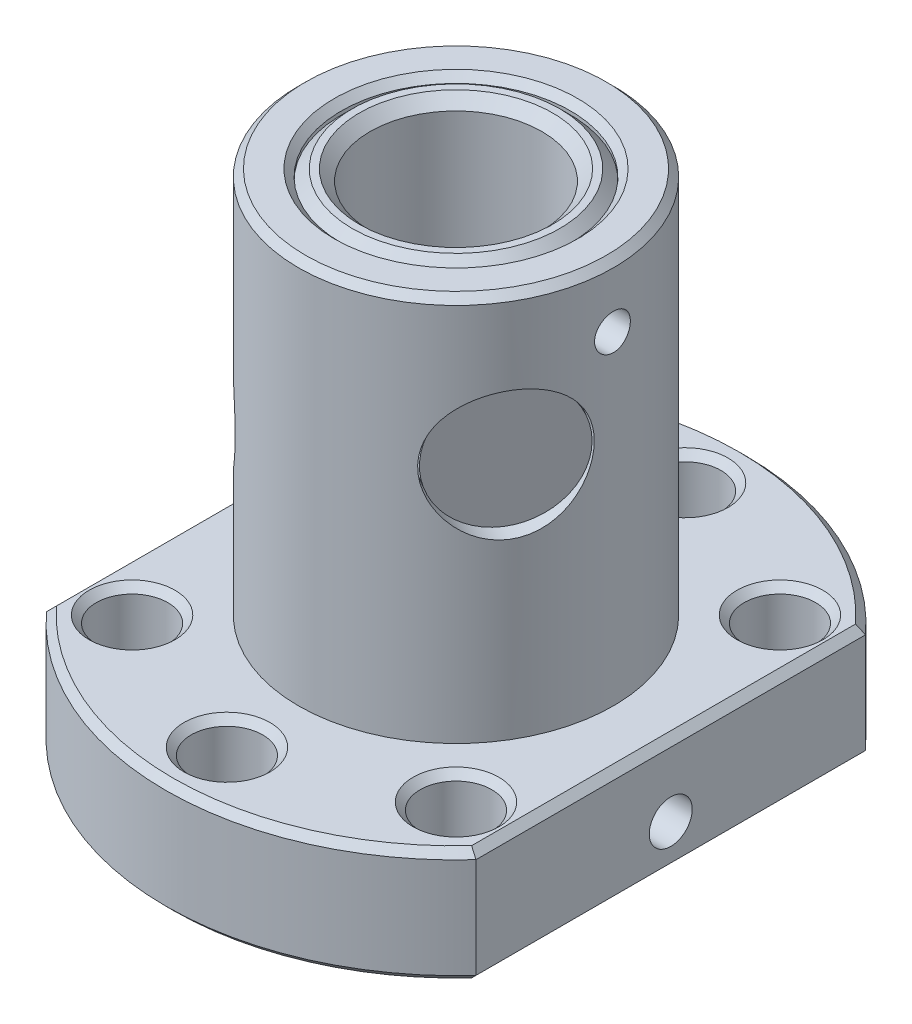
ISO-10303-21;
HEADER;
FILE_DESCRIPTION(('STEP AP214'),'2;1');
FILE_NAME('part.step','',(''),(''),'','','');
FILE_SCHEMA(('AUTOMOTIVE_DESIGN { 1 0 10303 214 1 1 1 1 }'));
ENDSEC;
DATA;
#1=APPLICATION_CONTEXT('core data for automotive mechanical design processes');
#2=APPLICATION_PROTOCOL_DEFINITION('international standard','automotive_design',2000,#1);
#3=PRODUCT_CONTEXT('',#1,'mechanical');
#4=PRODUCT('Part','Part','',(#3));
#5=PRODUCT_RELATED_PRODUCT_CATEGORY('part','',(#4));
#6=PRODUCT_DEFINITION_FORMATION('','',#4);
#7=PRODUCT_DEFINITION_CONTEXT('part definition',#1,'design');
#8=PRODUCT_DEFINITION('design','',#6,#7);
#9=PRODUCT_DEFINITION_SHAPE('','',#8);
#10=(LENGTH_UNIT() NAMED_UNIT(*) SI_UNIT(.MILLI.,.METRE.));
#11=(NAMED_UNIT(*) PLANE_ANGLE_UNIT() SI_UNIT($,.RADIAN.));
#12=(NAMED_UNIT(*) SI_UNIT($,.STERADIAN.) SOLID_ANGLE_UNIT());
#13=UNCERTAINTY_MEASURE_WITH_UNIT(LENGTH_MEASURE(1.E-05),#10,'distance_accuracy_value','');
#14=(GEOMETRIC_REPRESENTATION_CONTEXT(3) GLOBAL_UNCERTAINTY_ASSIGNED_CONTEXT((#13)) GLOBAL_UNIT_ASSIGNED_CONTEXT((#10,
#11,#12)) REPRESENTATION_CONTEXT('',''));
#15=CARTESIAN_POINT('',(0.,0.,0.));
#16=DIRECTION('',(0.,0.,1.));
#17=DIRECTION('',(1.,0.,0.));
#18=AXIS2_PLACEMENT_3D('',#15,#16,#17);
#19=CARTESIAN_POINT('',(8.59166583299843,24.6247770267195,5.11695986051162));
#20=DIRECTION('',(-0.859166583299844,0.,-0.511695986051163));
#21=DIRECTION('',(-0.511695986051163,0.,0.859166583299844));
#22=AXIS2_PLACEMENT_3D('',#19,#20,#21);
#23=CYLINDRICAL_SURFACE('',#22,4.4);
#24=CARTESIAN_POINT('',(8.59166583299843,24.6247770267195,5.11695986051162));
#25=DIRECTION('',(0.859166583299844,0.,0.511695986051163));
#26=DIRECTION('',(0.511695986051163,0.,-0.859166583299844));
#27=AXIS2_PLACEMENT_3D('',#24,#25,#26);
#28=CIRCLE('',#27,4.4);
#29=CARTESIAN_POINT('',(10.8431281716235,24.6247770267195,1.33662689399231));
#30=VERTEX_POINT('',#29);
#31=EDGE_CURVE('E11',#30,#30,#28,.T.);
#32=ORIENTED_EDGE('',*,*,#31,.F.);
#33=EDGE_LOOP('',(#32));
#34=FACE_BOUND('',#33,.T.);
#35=CARTESIAN_POINT('',(6.87333266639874,24.6247770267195,4.0935678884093));
#36=DIRECTION('',(0.859166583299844,0.,0.511695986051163));
#37=DIRECTION('',(0.511695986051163,0.,-0.859166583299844));
#38=AXIS2_PLACEMENT_3D('',#35,#36,#37);
#39=CIRCLE('',#38,4.4);
#40=CARTESIAN_POINT('',(9.12479500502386,24.6247770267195,0.313234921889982));
#41=VERTEX_POINT('',#40);
#42=EDGE_CURVE('E55',#41,#41,#39,.T.);
#43=ORIENTED_EDGE('',*,*,#42,.T.);
#44=EDGE_LOOP('',(#43));
#45=FACE_BOUND('',#44,.T.);
#46=ADVANCED_FACE('F52',(#34,#45),#23,.T.);
#47=CARTESIAN_POINT('',(8.59166583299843,24.6247770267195,5.11695986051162));
#48=DIRECTION('',(0.859166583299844,0.,0.511695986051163));
#49=DIRECTION('',(0.511695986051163,0.,-0.859166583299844));
#50=AXIS2_PLACEMENT_3D('',#47,#48,#49);
#51=PLANE('',#50);
#52=ORIENTED_EDGE('',*,*,#31,.T.);
#53=EDGE_LOOP('',(#52));
#54=FACE_BOUND('',#53,.T.);
#55=ADVANCED_FACE('F67',(#54),#51,.T.);
#56=CARTESIAN_POINT('',(6.87333266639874,24.6247770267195,4.0935678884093));
#57=DIRECTION('',(0.859166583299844,0.,0.511695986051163));
#58=DIRECTION('',(0.511695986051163,0.,-0.859166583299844));
#59=AXIS2_PLACEMENT_3D('',#56,#57,#58);
#60=PLANE('',#59);
#61=ORIENTED_EDGE('',*,*,#42,.F.);
#62=EDGE_LOOP('',(#61));
#63=FACE_BOUND('',#62,.T.);
#64=ADVANCED_FACE('F65',(#63),#60,.F.);
#65=CLOSED_SHELL('',(#46,#55,#64));
#66=MANIFOLD_SOLID_BREP('B2',#65);
#67=CARTESIAN_POINT('',(-8.80020271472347,19.8908366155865,4.74936123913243));
#68=DIRECTION('',(0.8800202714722,0.,-0.474936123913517));
#69=DIRECTION('',(-0.474936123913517,0.,-0.8800202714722));
#70=AXIS2_PLACEMENT_3D('',#67,#68,#69);
#71=CYLINDRICAL_SURFACE('',#70,4.40000000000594);
#72=CARTESIAN_POINT('',(-8.80020271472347,19.8908366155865,4.74936123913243));
#73=DIRECTION('',(-0.8800202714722,0.,0.474936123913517));
#74=DIRECTION('',(0.474936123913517,0.,0.8800202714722));
#75=AXIS2_PLACEMENT_3D('',#72,#73,#74);
#76=CIRCLE('',#75,4.40000000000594);
#77=CARTESIAN_POINT('',(-10.8899216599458,19.8908366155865,0.877272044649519));
#78=VERTEX_POINT('',#77);
#79=EDGE_CURVE('E51',#78,#78,#76,.T.);
#80=CARTESIAN_POINT('',(-7.04016217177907,19.8908366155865,3.7994889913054));
#81=DIRECTION('',(-0.8800202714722,0.,0.474936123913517));
#82=DIRECTION('',(0.474936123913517,0.,0.8800202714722));
#83=AXIS2_PLACEMENT_3D('',#80,#81,#82);
#84=CIRCLE('',#83,4.40000000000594);
#85=CARTESIAN_POINT('',(-9.12988111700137,19.8908366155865,-0.0726002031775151));
#86=VERTEX_POINT('',#85);
#87=EDGE_CURVE('E104',#86,#86,#84,.T.);
#88=CARTESIAN_POINT('',(-10.8899216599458,19.8908366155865,0.877272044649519));
#89=CARTESIAN_POINT('',(-10.8715879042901,19.8908366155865,0.867377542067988));
#90=CARTESIAN_POINT('',(-10.8532541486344,19.8908366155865,0.857483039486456));
#91=CARTESIAN_POINT('',(-10.8165866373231,19.8908366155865,0.837694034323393));
#92=CARTESIAN_POINT('',(-10.7982528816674,19.8908366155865,0.827799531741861));
#93=CARTESIAN_POINT('',(-10.7615853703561,19.8908366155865,0.808010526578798));
#94=CARTESIAN_POINT('',(-10.7432516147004,19.8908366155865,0.798116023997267));
#95=CARTESIAN_POINT('',(-10.7065841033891,19.8908366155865,0.778327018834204));
#96=CARTESIAN_POINT('',(-10.6882503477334,19.8908366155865,0.768432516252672));
#97=CARTESIAN_POINT('',(-10.651582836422,19.8908366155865,0.748643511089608));
#98=CARTESIAN_POINT('',(-10.6332490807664,19.8908366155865,0.738749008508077));
#99=CARTESIAN_POINT('',(-10.596581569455,19.8908366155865,0.718960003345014));
#100=CARTESIAN_POINT('',(-10.5782478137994,19.8908366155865,0.709065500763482));
#101=CARTESIAN_POINT('',(-10.541580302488,19.8908366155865,0.689276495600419));
#102=CARTESIAN_POINT('',(-10.5232465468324,19.8908366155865,0.679381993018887));
#103=CARTESIAN_POINT('',(-10.486579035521,19.8908366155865,0.659592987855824));
#104=CARTESIAN_POINT('',(-10.4682452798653,19.8908366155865,0.649698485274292));
#105=CARTESIAN_POINT('',(-10.431577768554,19.8908366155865,0.629909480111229));
#106=CARTESIAN_POINT('',(-10.4132440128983,19.8908366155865,0.620014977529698));
#107=CARTESIAN_POINT('',(-10.376576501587,19.8908366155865,0.600225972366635));
#108=CARTESIAN_POINT('',(-10.3582427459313,19.8908366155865,0.590331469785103));
#109=CARTESIAN_POINT('',(-10.32157523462,19.8908366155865,0.57054246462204));
#110=CARTESIAN_POINT('',(-10.3032414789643,19.8908366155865,0.560647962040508));
#111=CARTESIAN_POINT('',(-10.266573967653,19.8908366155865,0.540858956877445));
#112=CARTESIAN_POINT('',(-10.2482402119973,19.8908366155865,0.530964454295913));
#113=CARTESIAN_POINT('',(-10.2115727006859,19.8908366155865,0.51117544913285));
#114=CARTESIAN_POINT('',(-10.1932389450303,19.8908366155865,0.501280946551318));
#115=CARTESIAN_POINT('',(-10.1565714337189,19.8908366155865,0.481491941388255));
#116=CARTESIAN_POINT('',(-10.1382376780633,19.8908366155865,0.471597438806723));
#117=CARTESIAN_POINT('',(-10.1015701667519,19.8908366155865,0.45180843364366));
#118=CARTESIAN_POINT('',(-10.0832364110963,19.8908366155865,0.441913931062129));
#119=CARTESIAN_POINT('',(-10.0465688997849,19.8908366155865,0.422124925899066));
#120=CARTESIAN_POINT('',(-10.0282351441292,19.8908366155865,0.412230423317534));
#121=CARTESIAN_POINT('',(-9.9915676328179,19.8908366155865,0.392441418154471));
#122=CARTESIAN_POINT('',(-9.97323387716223,19.8908366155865,0.382546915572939));
#123=CARTESIAN_POINT('',(-9.93656636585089,19.8908366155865,0.362757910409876));
#124=CARTESIAN_POINT('',(-9.91823261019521,19.8908366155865,0.352863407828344));
#125=CARTESIAN_POINT('',(-9.88156509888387,19.8908366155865,0.333074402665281));
#126=CARTESIAN_POINT('',(-9.8632313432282,19.8908366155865,0.323179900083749));
#127=CARTESIAN_POINT('',(-9.82656383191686,19.8908366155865,0.303390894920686));
#128=CARTESIAN_POINT('',(-9.80823007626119,19.8908366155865,0.293496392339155));
#129=CARTESIAN_POINT('',(-9.77156256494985,19.8908366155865,0.273707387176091));
#130=CARTESIAN_POINT('',(-9.75322880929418,19.8908366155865,0.26381288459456));
#131=CARTESIAN_POINT('',(-9.71656129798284,19.8908366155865,0.244023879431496));
#132=CARTESIAN_POINT('',(-9.69822754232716,19.8908366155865,0.234129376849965));
#133=CARTESIAN_POINT('',(-9.66156003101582,19.8908366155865,0.214340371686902));
#134=CARTESIAN_POINT('',(-9.64322627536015,19.8908366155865,0.20444586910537));
#135=CARTESIAN_POINT('',(-9.60655876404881,19.8908366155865,0.184656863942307));
#136=CARTESIAN_POINT('',(-9.58822500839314,19.8908366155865,0.174762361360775));
#137=CARTESIAN_POINT('',(-9.5515574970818,19.8908366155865,0.154973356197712));
#138=CARTESIAN_POINT('',(-9.53322374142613,19.8908366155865,0.14507885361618));
#139=CARTESIAN_POINT('',(-9.49655623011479,19.8908366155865,0.125289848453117));
#140=CARTESIAN_POINT('',(-9.47822247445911,19.8908366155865,0.115395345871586));
#141=CARTESIAN_POINT('',(-9.44155496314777,19.8908366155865,0.0956063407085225));
#142=CARTESIAN_POINT('',(-9.4232212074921,19.8908366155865,0.0857118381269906));
#143=CARTESIAN_POINT('',(-9.38655369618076,19.8908366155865,0.0659228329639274));
#144=CARTESIAN_POINT('',(-9.36821994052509,19.8908366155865,0.0560283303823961));
#145=CARTESIAN_POINT('',(-9.33155242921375,19.8908366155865,0.0362393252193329));
#146=CARTESIAN_POINT('',(-9.31321867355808,19.8908366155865,0.0263448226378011));
#147=CARTESIAN_POINT('',(-9.27655116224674,19.8908366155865,0.00655581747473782));
#148=CARTESIAN_POINT('',(-9.25821740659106,19.8908366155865,-0.00333868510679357));
#149=CARTESIAN_POINT('',(-9.22154989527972,19.8908366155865,-0.0231276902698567));
#150=CARTESIAN_POINT('',(-9.20321613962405,19.8908366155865,-0.0330221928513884));
#151=CARTESIAN_POINT('',(-9.16654862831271,19.8908366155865,-0.052811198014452));
#152=CARTESIAN_POINT('',(-9.14821487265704,19.8908366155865,-0.0627057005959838));
#153=CARTESIAN_POINT('',(-9.12988111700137,19.8908366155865,-0.0726002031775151));
#154=B_SPLINE_CURVE_WITH_KNOTS('',3,(#88,#89,#90,#91,#92,#93,#94,#95,#96,#97,#98,#99,#100,#101,
#102,#103,#104,#105,#106,#107,#108,#109,#110,#111,#112,#113,#114,#115,#116,#117,#118,#119,#120,
#121,#122,#123,#124,#125,#126,#127,#128,#129,#130,#131,#132,#133,#134,#135,#136,#137,#138,#139,
#140,#141,#142,#143,#144,#145,#146,#147,#148,#149,#150,#151,#152,#153),.UNSPECIFIED.,.F.,.F.,(4,
2,2,2,2,2,2,2,2,2,2,2,2,2,2,2,2,2,2,2,2,2,2,2,2,2,2,2,2,2,2,2,4),(0.,0.0625000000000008,0.125,
0.187500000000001,0.25,0.312500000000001,0.375,0.437500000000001,0.500000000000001,
0.562500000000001,0.625000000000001,0.687500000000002,0.750000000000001,0.812500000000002,
0.875000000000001,0.937500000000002,1.,1.0625,1.125,1.1875,1.25,1.3125,1.375,1.4375,1.5,1.5625,
1.625,1.6875,1.75,1.8125,1.875,1.9375,2.),.UNSPECIFIED.);
#155=EDGE_CURVE('BSEAM101',#78,#86,#154,.T.);
#156=ORIENTED_EDGE('',*,*,#79,.F.);
#157=ORIENTED_EDGE('',*,*,#87,.T.);
#158=ORIENTED_EDGE('',*,*,#155,.T.);
#159=ORIENTED_EDGE('',*,*,#155,.F.);
#160=EDGE_LOOP('',(#156,#158,#157,#159));
#161=FACE_BOUND('',#160,.T.);
#162=ADVANCED_FACE('F101',(#161),#71,.T.);
#163=CARTESIAN_POINT('',(-8.80020271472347,19.8908366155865,4.74936123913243));
#164=DIRECTION('',(-0.8800202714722,0.,0.474936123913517));
#165=DIRECTION('',(0.474936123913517,0.,0.8800202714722));
#166=AXIS2_PLACEMENT_3D('',#163,#164,#165);
#167=PLANE('',#166);
#168=ORIENTED_EDGE('',*,*,#79,.T.);
#169=EDGE_LOOP('',(#168));
#170=FACE_BOUND('',#169,.T.);
#171=ADVANCED_FACE('F118',(#170),#167,.T.);
#172=CARTESIAN_POINT('',(-7.04016217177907,19.8908366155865,3.7994889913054));
#173=DIRECTION('',(-0.8800202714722,0.,0.474936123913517));
#174=DIRECTION('',(0.474936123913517,0.,0.8800202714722));
#175=AXIS2_PLACEMENT_3D('',#172,#173,#174);
#176=PLANE('',#175);
#177=ORIENTED_EDGE('',*,*,#87,.F.);
#178=EDGE_LOOP('',(#177));
#179=FACE_BOUND('',#178,.T.);
#180=ADVANCED_FACE('F116',(#179),#176,.F.);
#181=CLOSED_SHELL('',(#162,#171,#180));
#182=MANIFOLD_SOLID_BREP('B6',#181);
#183=CARTESIAN_POINT('',(1.06041112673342,15.,-9.94361746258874));
#184=DIRECTION('',(-0.106041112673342,0.,0.994361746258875));
#185=DIRECTION('',(0.994361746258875,0.,0.106041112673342));
#186=AXIS2_PLACEMENT_3D('',#183,#184,#185);
#187=CYLINDRICAL_SURFACE('',#186,4.4);
#188=CARTESIAN_POINT('',(1.06041112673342,15.,-9.94361746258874));
#189=DIRECTION('',(0.106041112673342,0.,-0.994361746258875));
#190=DIRECTION('',(-0.994361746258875,0.,-0.106041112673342));
#191=AXIS2_PLACEMENT_3D('',#188,#189,#190);
#192=CIRCLE('',#191,4.4);
#193=CARTESIAN_POINT('',(-3.31478055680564,15.,-10.4101983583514));
#194=VERTEX_POINT('',#193);
#195=EDGE_CURVE('E100',#194,#194,#192,.T.);
#196=ORIENTED_EDGE('',*,*,#195,.F.);
#197=EDGE_LOOP('',(#196));
#198=FACE_BOUND('',#197,.T.);
#199=CARTESIAN_POINT('',(0.848328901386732,15.,-7.95489397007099));
#200=DIRECTION('',(0.106041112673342,0.,-0.994361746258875));
#201=DIRECTION('',(-0.994361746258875,0.,-0.106041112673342));
#202=AXIS2_PLACEMENT_3D('',#199,#200,#201);
#203=CIRCLE('',#202,4.4);
#204=CARTESIAN_POINT('',(-3.52686278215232,15.,-8.42147486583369));
#205=VERTEX_POINT('',#204);
#206=EDGE_CURVE('E158',#205,#205,#203,.T.);
#207=ORIENTED_EDGE('',*,*,#206,.T.);
#208=EDGE_LOOP('',(#207));
#209=FACE_BOUND('',#208,.T.);
#210=ADVANCED_FACE('F155',(#198,#209),#187,.T.);
#211=CARTESIAN_POINT('',(1.06041112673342,15.,-9.94361746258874));
#212=DIRECTION('',(0.106041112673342,0.,-0.994361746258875));
#213=DIRECTION('',(-0.994361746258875,0.,-0.106041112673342));
#214=AXIS2_PLACEMENT_3D('',#211,#212,#213);
#215=PLANE('',#214);
#216=ORIENTED_EDGE('',*,*,#195,.T.);
#217=EDGE_LOOP('',(#216));
#218=FACE_BOUND('',#217,.T.);
#219=ADVANCED_FACE('F170',(#218),#215,.T.);
#220=CARTESIAN_POINT('',(0.848328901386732,15.,-7.95489397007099));
#221=DIRECTION('',(0.106041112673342,0.,-0.994361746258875));
#222=DIRECTION('',(-0.994361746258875,0.,-0.106041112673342));
#223=AXIS2_PLACEMENT_3D('',#220,#221,#222);
#224=PLANE('',#223);
#225=ORIENTED_EDGE('',*,*,#206,.F.);
#226=EDGE_LOOP('',(#225));
#227=FACE_BOUND('',#226,.T.);
#228=ADVANCED_FACE('F168',(#227),#224,.F.);
#229=CLOSED_SHELL('',(#210,#219,#228));
#230=MANIFOLD_SOLID_BREP('B46',#229);
#231=CARTESIAN_POINT('',(0.,0.,0.));
#232=DIRECTION('',(0.,-1.,0.));
#233=DIRECTION('',(0.,0.,-1.));
#234=AXIS2_PLACEMENT_3D('',#231,#232,#233);
#235=CYLINDRICAL_SURFACE('',#234,7.99999999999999);
#236=CARTESIAN_POINT('',(0.,34.25,0.));
#237=DIRECTION('',(0.,1.,0.));
#238=DIRECTION('',(0.,0.,1.));
#239=AXIS2_PLACEMENT_3D('',#236,#237,#238);
#240=CIRCLE('',#239,7.99999999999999);
#241=CARTESIAN_POINT('',(0.,34.25,7.99999999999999));
#242=VERTEX_POINT('',#241);
#243=EDGE_CURVE('E842',#242,#242,#240,.F.);
#244=ORIENTED_EDGE('',*,*,#243,.T.);
#245=EDGE_LOOP('',(#244));
#246=FACE_BOUND('',#245,.T.);
#247=CARTESIAN_POINT('',(0.,34.5,0.));
#248=DIRECTION('',(0.,1.,0.));
#249=DIRECTION('',(0.,0.,1.));
#250=AXIS2_PLACEMENT_3D('',#247,#248,#249);
#251=CIRCLE('',#250,7.99999999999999);
#252=CARTESIAN_POINT('',(0.,34.5,7.99999999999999));
#253=VERTEX_POINT('',#252);
#254=EDGE_CURVE('E504',#253,#253,#251,.T.);
#255=ORIENTED_EDGE('',*,*,#254,.T.);
#256=EDGE_LOOP('',(#255));
#257=FACE_BOUND('',#256,.T.);
#258=ADVANCED_FACE('F196',(#246,#257),#235,.F.);
#259=CARTESIAN_POINT('',(0.,0.,0.));
#260=DIRECTION('',(0.,1.,0.));
#261=DIRECTION('',(0.,0.,1.));
#262=AXIS2_PLACEMENT_3D('',#259,#260,#261);
#263=PLANE('',#262);
#264=CARTESIAN_POINT('',(-11.3137084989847,0.,11.3137084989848));
#265=DIRECTION('',(0.,1.,0.));
#266=DIRECTION('',(0.,0.,1.));
#267=AXIS2_PLACEMENT_3D('',#264,#265,#266);
#268=CIRCLE('',#267,2.99999999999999);
#269=CARTESIAN_POINT('',(-11.3137084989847,0.,14.3137084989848));
#270=VERTEX_POINT('',#269);
#271=EDGE_CURVE('E320',#270,#270,#268,.T.);
#272=ORIENTED_EDGE('',*,*,#271,.T.);
#273=EDGE_LOOP('',(#272));
#274=FACE_BOUND('',#273,.T.);
#275=CARTESIAN_POINT('',(11.3137084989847,0.,11.3137084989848));
#276=DIRECTION('',(0.,1.,0.));
#277=DIRECTION('',(0.,0.,1.));
#278=AXIS2_PLACEMENT_3D('',#275,#276,#277);
#279=CIRCLE('',#278,2.99999999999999);
#280=CARTESIAN_POINT('',(11.3137084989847,0.,14.3137084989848));
#281=VERTEX_POINT('',#280);
#282=EDGE_CURVE('E317',#281,#281,#279,.T.);
#283=ORIENTED_EDGE('',*,*,#282,.T.);
#284=EDGE_LOOP('',(#283));
#285=FACE_BOUND('',#284,.T.);
#286=CARTESIAN_POINT('',(11.3137084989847,0.,-11.3137084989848));
#287=DIRECTION('',(0.,1.,0.));
#288=DIRECTION('',(0.,0.,1.));
#289=AXIS2_PLACEMENT_3D('',#286,#287,#288);
#290=CIRCLE('',#289,2.99999999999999);
#291=CARTESIAN_POINT('',(11.3137084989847,0.,-8.31370849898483));
#292=VERTEX_POINT('',#291);
#293=EDGE_CURVE('E314',#292,#292,#290,.T.);
#294=ORIENTED_EDGE('',*,*,#293,.T.);
#295=EDGE_LOOP('',(#294));
#296=FACE_BOUND('',#295,.T.);
#297=CARTESIAN_POINT('',(0.,0.,-16.));
#298=DIRECTION('',(0.,1.,0.));
#299=DIRECTION('',(0.,0.,1.));
#300=AXIS2_PLACEMENT_3D('',#297,#298,#299);
#301=CIRCLE('',#300,2.99999999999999);
#302=CARTESIAN_POINT('',(0.,0.,-13.));
#303=VERTEX_POINT('',#302);
#304=EDGE_CURVE('E311',#303,#303,#301,.T.);
#305=ORIENTED_EDGE('',*,*,#304,.T.);
#306=EDGE_LOOP('',(#305));
#307=FACE_BOUND('',#306,.T.);
#308=CARTESIAN_POINT('',(-11.3137084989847,0.,-11.3137084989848));
#309=DIRECTION('',(0.,1.,0.));
#310=DIRECTION('',(0.,0.,1.));
#311=AXIS2_PLACEMENT_3D('',#308,#309,#310);
#312=CIRCLE('',#311,2.99999999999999);
#313=CARTESIAN_POINT('',(-11.3137084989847,0.,-8.31370849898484));
#314=VERTEX_POINT('',#313);
#315=EDGE_CURVE('E303',#314,#314,#312,.T.);
#316=ORIENTED_EDGE('',*,*,#315,.T.);
#317=EDGE_LOOP('',(#316));
#318=FACE_BOUND('',#317,.T.);
#319=CARTESIAN_POINT('',(0.,0.,0.));
#320=DIRECTION('',(0.,1.,0.));
#321=DIRECTION('',(0.,0.,1.));
#322=AXIS2_PLACEMENT_3D('',#319,#320,#321);
#323=CIRCLE('',#322,8.49999999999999);
#324=CARTESIAN_POINT('',(0.,0.,8.49999999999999));
#325=VERTEX_POINT('',#324);
#326=EDGE_CURVE('E299',#325,#325,#323,.T.);
#327=ORIENTED_EDGE('',*,*,#326,.T.);
#328=EDGE_LOOP('',(#327));
#329=FACE_BOUND('',#328,.T.);
#330=CARTESIAN_POINT('',(0.,0.,0.));
#331=DIRECTION('',(0.,1.,0.));
#332=DIRECTION('',(0.,0.,1.));
#333=AXIS2_PLACEMENT_3D('',#330,#331,#332);
#334=CIRCLE('',#333,19.75);
#335=CARTESIAN_POINT('',(14.5,0.,13.4094183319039));
#336=VERTEX_POINT('',#335);
#337=CARTESIAN_POINT('',(-14.5,0.,13.4094183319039));
#338=VERTEX_POINT('',#337);
#339=EDGE_CURVE('E298',#336,#338,#334,.F.);
#340=ORIENTED_EDGE('',*,*,#339,.T.);
#341=DIRECTION('',(0.,0.,-1.));
#342=VECTOR('',#341,1.);
#343=CARTESIAN_POINT('',(-14.5,0.,0.));
#344=LINE('',#343,#342);
#345=CARTESIAN_POINT('',(-14.5,0.,-13.4094183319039));
#346=VERTEX_POINT('',#345);
#347=EDGE_CURVE('E276',#338,#346,#344,.T.);
#348=ORIENTED_EDGE('',*,*,#347,.T.);
#349=CARTESIAN_POINT('',(0.,0.,0.));
#350=DIRECTION('',(0.,1.,0.));
#351=DIRECTION('',(0.,0.,1.));
#352=AXIS2_PLACEMENT_3D('',#349,#350,#351);
#353=CIRCLE('',#352,19.75);
#354=CARTESIAN_POINT('',(14.5,0.,-13.4094183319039));
#355=VERTEX_POINT('',#354);
#356=EDGE_CURVE('E286',#346,#355,#353,.F.);
#357=ORIENTED_EDGE('',*,*,#356,.T.);
#358=DIRECTION('',(0.,0.,1.));
#359=VECTOR('',#358,1.);
#360=CARTESIAN_POINT('',(14.5,0.,0.));
#361=LINE('',#360,#359);
#362=EDGE_CURVE('E292',#355,#336,#361,.T.);
#363=ORIENTED_EDGE('',*,*,#362,.T.);
#364=EDGE_LOOP('',(#340,#348,#357,#363));
#365=FACE_BOUND('',#364,.T.);
#366=CARTESIAN_POINT('',(0.,0.,16.));
#367=DIRECTION('',(0.,1.,0.));
#368=DIRECTION('',(0.,0.,1.));
#369=AXIS2_PLACEMENT_3D('',#366,#367,#368);
#370=CIRCLE('',#369,3.00000000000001);
#371=CARTESIAN_POINT('',(0.,0.,19.));
#372=VERTEX_POINT('',#371);
#373=EDGE_CURVE('E293',#372,#372,#370,.T.);
#374=ORIENTED_EDGE('',*,*,#373,.T.);
#375=EDGE_LOOP('',(#374));
#376=FACE_BOUND('',#375,.T.);
#377=ADVANCED_FACE('F295',(#274,#285,#296,#307,#318,#329,#365,#376),#263,.F.);
#378=CARTESIAN_POINT('',(0.,8.,0.));
#379=DIRECTION('',(0.,1.,0.));
#380=DIRECTION('',(0.,0.,1.));
#381=AXIS2_PLACEMENT_3D('',#378,#379,#380);
#382=PLANE('',#381);
#383=CARTESIAN_POINT('',(-11.3137084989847,8.,-11.3137084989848));
#384=DIRECTION('',(0.,1.,0.));
#385=DIRECTION('',(0.,0.,1.));
#386=AXIS2_PLACEMENT_3D('',#383,#384,#385);
#387=CIRCLE('',#386,3.00000000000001);
#388=CARTESIAN_POINT('',(-11.3137084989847,8.,-8.31370849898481));
#389=VERTEX_POINT('',#388);
#390=EDGE_CURVE('E153',#389,#389,#387,.F.);
#391=ORIENTED_EDGE('',*,*,#390,.T.);
#392=EDGE_LOOP('',(#391));
#393=FACE_BOUND('',#392,.T.);
#394=CARTESIAN_POINT('',(0.,8.,-16.));
#395=DIRECTION('',(0.,1.,0.));
#396=DIRECTION('',(0.,0.,1.));
#397=AXIS2_PLACEMENT_3D('',#394,#395,#396);
#398=CIRCLE('',#397,3.00000000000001);
#399=CARTESIAN_POINT('',(0.,8.,-13.));
#400=VERTEX_POINT('',#399);
#401=EDGE_CURVE('E211',#400,#400,#398,.F.);
#402=ORIENTED_EDGE('',*,*,#401,.T.);
#403=EDGE_LOOP('',(#402));
#404=FACE_BOUND('',#403,.T.);
#405=CARTESIAN_POINT('',(11.3137084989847,8.,-11.3137084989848));
#406=DIRECTION('',(0.,1.,0.));
#407=DIRECTION('',(0.,0.,1.));
#408=AXIS2_PLACEMENT_3D('',#405,#406,#407);
#409=CIRCLE('',#408,2.99999999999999);
#410=CARTESIAN_POINT('',(11.3137084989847,8.,-8.31370849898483));
#411=VERTEX_POINT('',#410);
#412=EDGE_CURVE('E392',#411,#411,#409,.F.);
#413=ORIENTED_EDGE('',*,*,#412,.T.);
#414=EDGE_LOOP('',(#413));
#415=FACE_BOUND('',#414,.T.);
#416=CARTESIAN_POINT('',(11.3137084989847,8.,11.3137084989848));
#417=DIRECTION('',(0.,1.,0.));
#418=DIRECTION('',(0.,0.,1.));
#419=AXIS2_PLACEMENT_3D('',#416,#417,#418);
#420=CIRCLE('',#419,2.99999999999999);
#421=CARTESIAN_POINT('',(11.3137084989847,8.,14.3137084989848));
#422=VERTEX_POINT('',#421);
#423=EDGE_CURVE('E389',#422,#422,#420,.F.);
#424=ORIENTED_EDGE('',*,*,#423,.T.);
#425=EDGE_LOOP('',(#424));
#426=FACE_BOUND('',#425,.T.);
#427=CARTESIAN_POINT('',(0.,8.,16.));
#428=DIRECTION('',(0.,1.,0.));
#429=DIRECTION('',(0.,0.,1.));
#430=AXIS2_PLACEMENT_3D('',#427,#428,#429);
#431=CIRCLE('',#430,2.99999999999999);
#432=CARTESIAN_POINT('',(0.,8.,19.));
#433=VERTEX_POINT('',#432);
#434=EDGE_CURVE('E385',#433,#433,#431,.F.);
#435=ORIENTED_EDGE('',*,*,#434,.T.);
#436=EDGE_LOOP('',(#435));
#437=FACE_BOUND('',#436,.T.);
#438=CARTESIAN_POINT('',(-11.3137084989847,8.,11.3137084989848));
#439=DIRECTION('',(0.,1.,0.));
#440=DIRECTION('',(0.,0.,1.));
#441=AXIS2_PLACEMENT_3D('',#438,#439,#440);
#442=CIRCLE('',#441,2.99999999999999);
#443=CARTESIAN_POINT('',(-11.3137084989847,8.,14.3137084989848));
#444=VERTEX_POINT('',#443);
#445=EDGE_CURVE('E381',#444,#444,#442,.F.);
#446=ORIENTED_EDGE('',*,*,#445,.T.);
#447=EDGE_LOOP('',(#446));
#448=FACE_BOUND('',#447,.T.);
#449=CARTESIAN_POINT('',(0.,8.,0.));
#450=DIRECTION('',(0.,1.,0.));
#451=DIRECTION('',(0.,0.,1.));
#452=AXIS2_PLACEMENT_3D('',#449,#450,#451);
#453=CIRCLE('',#452,19.75);
#454=CARTESIAN_POINT('',(-14.5,8.,13.4094183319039));
#455=VERTEX_POINT('',#454);
#456=CARTESIAN_POINT('',(14.5,8.,13.4094183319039));
#457=VERTEX_POINT('',#456);
#458=EDGE_CURVE('E373',#455,#457,#453,.T.);
#459=ORIENTED_EDGE('',*,*,#458,.T.);
#460=DIRECTION('',(0.,0.,-1.));
#461=VECTOR('',#460,1.);
#462=CARTESIAN_POINT('',(14.5,8.,-13.6037678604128));
#463=LINE('',#462,#461);
#464=CARTESIAN_POINT('',(14.5,8.,-13.4094183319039));
#465=VERTEX_POINT('',#464);
#466=EDGE_CURVE('E379',#457,#465,#463,.T.);
#467=ORIENTED_EDGE('',*,*,#466,.T.);
#468=CARTESIAN_POINT('',(0.,8.,0.));
#469=DIRECTION('',(0.,1.,0.));
#470=DIRECTION('',(0.,0.,1.));
#471=AXIS2_PLACEMENT_3D('',#468,#469,#470);
#472=CIRCLE('',#471,19.75);
#473=CARTESIAN_POINT('',(-14.5,8.,-13.4094183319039));
#474=VERTEX_POINT('',#473);
#475=EDGE_CURVE('E226',#465,#474,#472,.T.);
#476=ORIENTED_EDGE('',*,*,#475,.T.);
#477=DIRECTION('',(0.,0.,1.));
#478=VECTOR('',#477,1.);
#479=CARTESIAN_POINT('',(-14.5,8.,13.6037678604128));
#480=LINE('',#479,#478);
#481=EDGE_CURVE('E376',#474,#455,#480,.T.);
#482=ORIENTED_EDGE('',*,*,#481,.T.);
#483=EDGE_LOOP('',(#459,#467,#476,#482));
#484=FACE_BOUND('',#483,.T.);
#485=CARTESIAN_POINT('',(0.,8.,0.));
#486=DIRECTION('',(0.,1.,0.));
#487=DIRECTION('',(0.,0.,1.));
#488=AXIS2_PLACEMENT_3D('',#485,#486,#487);
#489=CIRCLE('',#488,11.);
#490=CARTESIAN_POINT('',(0.,8.,11.));
#491=VERTEX_POINT('',#490);
#492=EDGE_CURVE('E644',#491,#491,#489,.T.);
#493=ORIENTED_EDGE('',*,*,#492,.F.);
#494=EDGE_LOOP('',(#493));
#495=FACE_BOUND('',#494,.T.);
#496=ADVANCED_FACE('F475',(#393,#404,#415,#426,#437,#448,#484,#495),#382,.T.);
#497=CARTESIAN_POINT('',(0.,8.,0.));
#498=DIRECTION('',(0.,-1.,0.));
#499=DIRECTION('',(0.,0.,-1.));
#500=AXIS2_PLACEMENT_3D('',#497,#498,#499);
#501=CYLINDRICAL_SURFACE('',#500,20.25);
#502=CARTESIAN_POINT('',(5.76715358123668,5.,-19.4113997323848));
#503=CARTESIAN_POINT('',(5.76715882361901,4.88238285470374,-19.4113991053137));
#504=CARTESIAN_POINT('',(5.77671200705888,4.76468851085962,-19.4085678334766));
#505=CARTESIAN_POINT('',(5.81464339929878,4.53256459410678,-19.3972368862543));
#506=CARTESIAN_POINT('',(5.84304220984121,4.41813873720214,-19.388731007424));
#507=CARTESIAN_POINT('',(5.91772977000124,4.19594681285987,-19.3660653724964));
#508=CARTESIAN_POINT('',(5.96400750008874,4.08817669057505,-19.3519090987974));
#509=CARTESIAN_POINT('',(6.07296865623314,3.88227429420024,-19.3179914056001));
#510=CARTESIAN_POINT('',(6.13564888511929,3.78414014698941,-19.2982310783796));
#511=CARTESIAN_POINT('',(6.27571380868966,3.59988986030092,-19.2531382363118));
#512=CARTESIAN_POINT('',(6.3531487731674,3.51381660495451,-19.2277866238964));
#513=CARTESIAN_POINT('',(6.52021298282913,3.35650084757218,-19.1717779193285));
#514=CARTESIAN_POINT('',(6.60984279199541,3.28525903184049,-19.1411205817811));
#515=CARTESIAN_POINT('',(6.79880948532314,3.15947933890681,-19.0748190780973));
#516=CARTESIAN_POINT('',(6.8981678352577,3.1049795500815,-19.0391638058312));
#517=CARTESIAN_POINT('',(7.10344638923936,3.0144746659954,-18.9635308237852));
#518=CARTESIAN_POINT('',(7.20936642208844,2.97846908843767,-18.923553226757));
#519=CARTESIAN_POINT('',(7.42424020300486,2.92610083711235,-18.8402860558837));
#520=CARTESIAN_POINT('',(7.53318159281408,2.90966758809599,-18.7970089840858));
#521=CARTESIAN_POINT('',(7.75129478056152,2.89669205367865,-18.7081210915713));
#522=CARTESIAN_POINT('',(7.86046657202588,2.90014921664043,-18.6625103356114));
#523=CARTESIAN_POINT('',(8.07551262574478,2.92679917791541,-18.5704665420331));
#524=CARTESIAN_POINT('',(8.18139794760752,2.94991608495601,-18.5240373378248));
#525=CARTESIAN_POINT('',(8.38739209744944,3.01511104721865,-18.4316820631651));
#526=CARTESIAN_POINT('',(8.48750084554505,3.05718936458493,-18.3857559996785));
#527=CARTESIAN_POINT('',(8.67944802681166,3.15919557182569,-18.2959269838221));
#528=CARTESIAN_POINT('',(8.7712705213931,3.21915694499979,-18.2520280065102));
#529=CARTESIAN_POINT('',(8.94404866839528,3.35520286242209,-18.1679866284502));
#530=CARTESIAN_POINT('',(9.02500397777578,3.43128791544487,-18.1278443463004));
#531=CARTESIAN_POINT('',(9.17434343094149,3.59784799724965,-18.052727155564));
#532=CARTESIAN_POINT('',(9.24266662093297,3.68838906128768,-18.0177774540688));
#533=CARTESIAN_POINT('',(9.36453956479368,3.88106236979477,-17.9547381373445));
#534=CARTESIAN_POINT('',(9.41808929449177,3.98319463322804,-17.9266485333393));
#535=CARTESIAN_POINT('',(9.50907253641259,4.19620295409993,-17.8785542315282));
#536=CARTESIAN_POINT('',(9.54650225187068,4.30708106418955,-17.8585514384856));
#537=CARTESIAN_POINT('',(9.60427133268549,4.53440787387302,-17.8275504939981));
#538=CARTESIAN_POINT('',(9.62461125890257,4.65085639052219,-17.8165520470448));
#539=CARTESIAN_POINT('',(9.64762577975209,4.88543893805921,-17.8041003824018));
#540=CARTESIAN_POINT('',(9.65038205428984,5.00356261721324,-17.8026030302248));
#541=CARTESIAN_POINT('',(9.63837630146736,5.23865100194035,-17.8091057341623));
#542=CARTESIAN_POINT('',(9.62361452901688,5.35561572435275,-17.8171056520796));
#543=CARTESIAN_POINT('',(9.57700365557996,5.58479579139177,-17.8422025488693));
#544=CARTESIAN_POINT('',(9.54519340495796,5.69702131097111,-17.8592788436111));
#545=CARTESIAN_POINT('',(9.4653123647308,5.91385385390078,-17.9017428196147));
#546=CARTESIAN_POINT('',(9.41724117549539,6.01846068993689,-17.9271307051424));
#547=CARTESIAN_POINT('',(9.3058352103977,6.21750698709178,-17.9852127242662));
#548=CARTESIAN_POINT('',(9.24244522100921,6.3119078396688,-18.0179332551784));
#549=CARTESIAN_POINT('',(9.10208513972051,6.4874706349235,-18.0892433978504));
#550=CARTESIAN_POINT('',(9.02511468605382,6.568632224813,-18.1278331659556));
#551=CARTESIAN_POINT('',(8.85921919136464,6.71573188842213,-18.2094837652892));
#552=CARTESIAN_POINT('',(8.77024891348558,6.7816096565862,-18.2525613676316));
#553=CARTESIAN_POINT('',(8.58290316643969,6.89585636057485,-18.3414014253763));
#554=CARTESIAN_POINT('',(8.48452783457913,6.9442255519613,-18.3871638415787));
#555=CARTESIAN_POINT('',(8.28120512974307,7.02198024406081,-18.4796260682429));
#556=CARTESIAN_POINT('',(8.17627071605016,7.0514019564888,-18.5263239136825));
#557=CARTESIAN_POINT('',(7.96255848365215,7.09054465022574,-18.6191763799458));
#558=CARTESIAN_POINT('',(7.85378078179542,7.1002662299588,-18.6653310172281));
#559=CARTESIAN_POINT('',(7.63598380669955,7.09972391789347,-18.7554812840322));
#560=CARTESIAN_POINT('',(7.52696806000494,7.0895535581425,-18.799486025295));
#561=CARTESIAN_POINT('',(7.31132132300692,7.04971246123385,-18.8843987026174));
#562=CARTESIAN_POINT('',(7.2046903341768,7.02004171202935,-18.9253066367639));
#563=CARTESIAN_POINT('',(6.99693844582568,6.9420684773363,-19.0030961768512));
#564=CARTESIAN_POINT('',(6.895816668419,6.8937689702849,-19.0399784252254));
#565=CARTESIAN_POINT('',(6.70203974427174,6.77991915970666,-19.1090490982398));
#566=CARTESIAN_POINT('',(6.60938456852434,6.71436891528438,-19.1412375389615));
#567=CARTESIAN_POINT('',(6.43489884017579,6.56752811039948,-19.2006021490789));
#568=CARTESIAN_POINT('',(6.35311900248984,6.48616787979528,-19.2277550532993));
#569=CARTESIAN_POINT('',(6.20334982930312,6.31015551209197,-19.2765965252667));
#570=CARTESIAN_POINT('',(6.13536380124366,6.21550019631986,-19.2982837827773));
#571=CARTESIAN_POINT('',(6.01515683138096,6.01530102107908,-19.336090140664));
#572=CARTESIAN_POINT('',(5.96297917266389,5.90972830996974,-19.3521939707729));
#573=CARTESIAN_POINT('',(5.87635422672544,5.69096540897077,-19.3786746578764));
#574=CARTESIAN_POINT('',(5.84188703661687,5.57778393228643,-19.3890579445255));
#575=CARTESIAN_POINT('',(5.80033153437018,5.38664052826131,-19.4015188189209));
#576=CARTESIAN_POINT('',(5.78790865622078,5.30989861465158,-19.4052232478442));
#577=CARTESIAN_POINT('',(5.77131796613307,5.15544903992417,-19.4101639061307));
#578=CARTESIAN_POINT('',(5.76715011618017,5.07774138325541,-19.4114001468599));
#579=CARTESIAN_POINT('',(5.76715358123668,5.,-19.4113997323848));
#580=B_SPLINE_CURVE_WITH_KNOTS('',3,(#502,#503,#504,#505,#506,#507,#508,#509,#510,#511,#512,
#513,#514,#515,#516,#517,#518,#519,#520,#521,#522,#523,#524,#525,#526,#527,#528,#529,#530,#531,
#532,#533,#534,#535,#536,#537,#538,#539,#540,#541,#542,#543,#544,#545,#546,#547,#548,#549,#550,
#551,#552,#553,#554,#555,#556,#557,#558,#559,#560,#561,#562,#563,#564,#565,#566,#567,#568,#569,
#570,#571,#572,#573,#574,#575,#576,#577,#578,#579),.UNSPECIFIED.,.T.,.F.,(4,2,2,2,2,2,2,2,2,2,2,
2,2,2,2,2,2,2,2,2,2,2,2,2,2,2,2,2,2,2,2,2,2,2,2,2,2,2,4),(0.,0.352567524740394,
0.705521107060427,1.05825749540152,1.41092517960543,1.76481662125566,2.11872443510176,
2.47343153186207,2.82812937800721,3.18154432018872,3.53494946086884,3.88699653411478,
4.23904847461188,4.59176376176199,4.9444901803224,5.29887655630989,5.65326351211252,
6.0077338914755,6.36219263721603,6.71500363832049,7.06780950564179,7.41981479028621,
7.77182872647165,8.12513086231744,8.47844241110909,8.83312517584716,9.18780276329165,
9.54180047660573,9.89578743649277,10.2481139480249,10.6004406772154,10.9527110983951,
11.3049803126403,11.6588386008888,12.0127816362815,12.3676851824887,12.7221890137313,
12.9552265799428,13.1882630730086),.UNSPECIFIED.);
#581=CARTESIAN_POINT('',(5.76715358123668,5.,-19.4113997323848));
#582=VERTEX_POINT('',#581);
#583=EDGE_CURVE('E658',#582,#582,#580,.T.);
#584=ORIENTED_EDGE('',*,*,#583,.T.);
#585=EDGE_LOOP('',(#584));
#586=FACE_BOUND('',#585,.T.);
#587=DIRECTION('',(0.,-1.,0.));
#588=VECTOR('',#587,1.);
#589=CARTESIAN_POINT('',(15.,8.,-13.6037678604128));
#590=LINE('',#589,#588);
#591=CARTESIAN_POINT('',(15.,7.49999999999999,-13.6037678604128));
#592=VERTEX_POINT('',#591);
#593=CARTESIAN_POINT('',(15.,0.5,-13.6037678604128));
#594=VERTEX_POINT('',#593);
#595=EDGE_CURVE('E551',#592,#594,#590,.T.);
#596=ORIENTED_EDGE('',*,*,#595,.T.);
#597=CARTESIAN_POINT('',(0.,0.5,0.));
#598=DIRECTION('',(0.,1.,0.));
#599=DIRECTION('',(0.,0.,1.));
#600=AXIS2_PLACEMENT_3D('',#597,#598,#599);
#601=CIRCLE('',#600,20.25);
#602=CARTESIAN_POINT('',(-15.,0.5,-13.6037678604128));
#603=VERTEX_POINT('',#602);
#604=EDGE_CURVE('E364',#594,#603,#601,.T.);
#605=ORIENTED_EDGE('',*,*,#604,.T.);
#606=DIRECTION('',(0.,-1.,0.));
#607=VECTOR('',#606,1.);
#608=CARTESIAN_POINT('',(-15.,8.,-13.6037678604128));
#609=LINE('',#608,#607);
#610=CARTESIAN_POINT('',(-15.,7.49999999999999,-13.6037678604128));
#611=VERTEX_POINT('',#610);
#612=EDGE_CURVE('E544',#611,#603,#609,.T.);
#613=ORIENTED_EDGE('',*,*,#612,.F.);
#614=CARTESIAN_POINT('',(0.,7.49999999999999,0.));
#615=DIRECTION('',(0.,1.,0.));
#616=DIRECTION('',(0.,0.,1.));
#617=AXIS2_PLACEMENT_3D('',#614,#615,#616);
#618=CIRCLE('',#617,20.25);
#619=EDGE_CURVE('E362',#611,#592,#618,.F.);
#620=ORIENTED_EDGE('',*,*,#619,.T.);
#621=EDGE_LOOP('',(#596,#605,#613,#620));
#622=FACE_BOUND('',#621,.T.);
#623=ADVANCED_FACE('F636',(#586,#622),#501,.T.);
#624=CARTESIAN_POINT('',(-15.,8.,-13.6037678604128));
#625=DIRECTION('',(1.,0.,0.));
#626=DIRECTION('',(0.,0.,-1.));
#627=AXIS2_PLACEMENT_3D('',#624,#625,#626);
#628=PLANE('',#627);
#629=CARTESIAN_POINT('',(-15.,3.,0.));
#630=DIRECTION('',(1.,0.,0.));
#631=DIRECTION('',(0.,0.,-1.));
#632=AXIS2_PLACEMENT_3D('',#629,#630,#631);
#633=CIRCLE('',#632,1.5);
#634=CARTESIAN_POINT('',(-15.,3.,-1.5));
#635=VERTEX_POINT('',#634);
#636=EDGE_CURVE('E563',#635,#635,#633,.T.);
#637=ORIENTED_EDGE('',*,*,#636,.T.);
#638=EDGE_LOOP('',(#637));
#639=FACE_BOUND('',#638,.T.);
#640=ORIENTED_EDGE('',*,*,#612,.T.);
#641=DIRECTION('',(0.,0.,1.));
#642=VECTOR('',#641,1.);
#643=CARTESIAN_POINT('',(-15.,0.5,-13.6037678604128));
#644=LINE('',#643,#642);
#645=CARTESIAN_POINT('',(-15.,0.5,13.6037678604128));
#646=VERTEX_POINT('',#645);
#647=EDGE_CURVE('E279',#603,#646,#644,.T.);
#648=ORIENTED_EDGE('',*,*,#647,.T.);
#649=DIRECTION('',(0.,-1.,0.));
#650=VECTOR('',#649,1.);
#651=CARTESIAN_POINT('',(-15.,8.,13.6037678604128));
#652=LINE('',#651,#650);
#653=CARTESIAN_POINT('',(-15.,7.49999999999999,13.6037678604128));
#654=VERTEX_POINT('',#653);
#655=EDGE_CURVE('E541',#654,#646,#652,.T.);
#656=ORIENTED_EDGE('',*,*,#655,.F.);
#657=DIRECTION('',(0.,0.,-1.));
#658=VECTOR('',#657,1.);
#659=CARTESIAN_POINT('',(-15.,7.49999999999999,-13.6037678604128));
#660=LINE('',#659,#658);
#661=EDGE_CURVE('E350',#654,#611,#660,.T.);
#662=ORIENTED_EDGE('',*,*,#661,.T.);
#663=EDGE_LOOP('',(#640,#648,#656,#662));
#664=FACE_BOUND('',#663,.T.);
#665=ADVANCED_FACE('F540',(#639,#664),#628,.F.);
#666=CARTESIAN_POINT('',(0.,8.,0.));
#667=DIRECTION('',(0.,-1.,0.));
#668=DIRECTION('',(0.,0.,-1.));
#669=AXIS2_PLACEMENT_3D('',#666,#667,#668);
#670=CYLINDRICAL_SURFACE('',#669,20.25);
#671=ORIENTED_EDGE('',*,*,#655,.T.);
#672=CARTESIAN_POINT('',(0.,0.5,0.));
#673=DIRECTION('',(0.,1.,0.));
#674=DIRECTION('',(0.,0.,1.));
#675=AXIS2_PLACEMENT_3D('',#672,#673,#674);
#676=CIRCLE('',#675,20.25);
#677=CARTESIAN_POINT('',(15.,0.5,13.6037678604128));
#678=VERTEX_POINT('',#677);
#679=EDGE_CURVE('E355',#646,#678,#676,.T.);
#680=ORIENTED_EDGE('',*,*,#679,.T.);
#681=DIRECTION('',(0.,-1.,0.));
#682=VECTOR('',#681,1.);
#683=CARTESIAN_POINT('',(15.,8.,13.6037678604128));
#684=LINE('',#683,#682);
#685=CARTESIAN_POINT('',(15.,7.49999999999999,13.6037678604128));
#686=VERTEX_POINT('',#685);
#687=EDGE_CURVE('E547',#686,#678,#684,.T.);
#688=ORIENTED_EDGE('',*,*,#687,.F.);
#689=CARTESIAN_POINT('',(0.,7.49999999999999,0.));
#690=DIRECTION('',(0.,1.,0.));
#691=DIRECTION('',(0.,0.,1.));
#692=AXIS2_PLACEMENT_3D('',#689,#690,#691);
#693=CIRCLE('',#692,20.25);
#694=EDGE_CURVE('E353',#686,#654,#693,.F.);
#695=ORIENTED_EDGE('',*,*,#694,.T.);
#696=EDGE_LOOP('',(#671,#680,#688,#695));
#697=FACE_BOUND('',#696,.T.);
#698=ADVANCED_FACE('F545',(#697),#670,.T.);
#699=CARTESIAN_POINT('',(15.,8.,-13.6037678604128));
#700=DIRECTION('',(-1.,0.,0.));
#701=DIRECTION('',(0.,0.,1.));
#702=AXIS2_PLACEMENT_3D('',#699,#700,#701);
#703=PLANE('',#702);
#704=CARTESIAN_POINT('',(15.,3.,0.));
#705=DIRECTION('',(1.,0.,0.));
#706=DIRECTION('',(0.,0.,-1.));
#707=AXIS2_PLACEMENT_3D('',#704,#705,#706);
#708=CIRCLE('',#707,1.5);
#709=CARTESIAN_POINT('',(15.,3.,-1.5));
#710=VERTEX_POINT('',#709);
#711=EDGE_CURVE('E655',#710,#710,#708,.T.);
#712=ORIENTED_EDGE('',*,*,#711,.F.);
#713=EDGE_LOOP('',(#712));
#714=FACE_BOUND('',#713,.T.);
#715=ORIENTED_EDGE('',*,*,#687,.T.);
#716=DIRECTION('',(0.,0.,-1.));
#717=VECTOR('',#716,1.);
#718=CARTESIAN_POINT('',(15.,0.5,-13.6037678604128));
#719=LINE('',#718,#717);
#720=EDGE_CURVE('E360',#678,#594,#719,.T.);
#721=ORIENTED_EDGE('',*,*,#720,.T.);
#722=ORIENTED_EDGE('',*,*,#595,.F.);
#723=DIRECTION('',(0.,0.,1.));
#724=VECTOR('',#723,1.);
#725=CARTESIAN_POINT('',(15.,7.49999999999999,13.6037678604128));
#726=LINE('',#725,#724);
#727=EDGE_CURVE('E357',#592,#686,#726,.T.);
#728=ORIENTED_EDGE('',*,*,#727,.T.);
#729=EDGE_LOOP('',(#715,#721,#722,#728));
#730=FACE_BOUND('',#729,.T.);
#731=ADVANCED_FACE('F704',(#714,#730),#703,.F.);
#732=CARTESIAN_POINT('',(0.,35.,0.));
#733=DIRECTION('',(0.,-1.,0.));
#734=DIRECTION('',(0.,0.,-1.));
#735=AXIS2_PLACEMENT_3D('',#732,#733,#734);
#736=CYLINDRICAL_SURFACE('',#735,11.);
#737=CARTESIAN_POINT('',(0.,34.5,0.));
#738=DIRECTION('',(0.,1.,0.));
#739=DIRECTION('',(0.,0.,1.));
#740=AXIS2_PLACEMENT_3D('',#737,#738,#739);
#741=CIRCLE('',#740,11.);
#742=CARTESIAN_POINT('',(0.,34.5,11.));
#743=VERTEX_POINT('',#742);
#744=EDGE_CURVE('E505',#743,#743,#741,.F.);
#745=ORIENTED_EDGE('',*,*,#744,.T.);
#746=EDGE_LOOP('',(#745));
#747=FACE_BOUND('',#746,.T.);
#748=CARTESIAN_POINT('',(10.9287464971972,30.6225537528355,1.25));
#749=CARTESIAN_POINT('',(10.9287474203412,30.6925231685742,1.24999699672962));
#750=CARTESIAN_POINT('',(10.9294256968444,30.7625375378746,1.24410533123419));
#751=CARTESIAN_POINT('',(10.93206480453,30.9006213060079,1.22069346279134));
#752=CARTESIAN_POINT('',(10.9340270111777,30.9686885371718,1.20316078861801));
#753=CARTESIAN_POINT('',(10.9390089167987,31.1008586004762,1.15698736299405));
#754=CARTESIAN_POINT('',(10.9420279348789,31.1649639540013,1.12835376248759));
#755=CARTESIAN_POINT('',(10.9487824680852,31.2874463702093,1.06080587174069));
#756=CARTESIAN_POINT('',(10.9525178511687,31.345824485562,1.02189347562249));
#757=CARTESIAN_POINT('',(10.960303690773,31.4554796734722,0.934698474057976));
#758=CARTESIAN_POINT('',(10.9643553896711,31.5067262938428,0.886377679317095));
#759=CARTESIAN_POINT('',(10.972306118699,31.6004011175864,0.781819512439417));
#760=CARTESIAN_POINT('',(10.9762051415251,31.6428288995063,0.725581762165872));
#761=CARTESIAN_POINT('',(10.9834237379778,31.7177692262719,0.606596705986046));
#762=CARTESIAN_POINT('',(10.9867417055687,31.7502544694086,0.543832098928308));
#763=CARTESIAN_POINT('',(10.9924107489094,31.8042128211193,0.413694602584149));
#764=CARTESIAN_POINT('',(10.9947618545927,31.825686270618,0.346321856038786));
#765=CARTESIAN_POINT('',(10.9982235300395,31.8569212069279,0.209190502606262));
#766=CARTESIAN_POINT('',(10.9993394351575,31.8667330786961,0.139443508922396));
#767=CARTESIAN_POINT('',(11.0002231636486,31.8745223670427,-0.000715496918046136));
#768=CARTESIAN_POINT('',(10.9999910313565,31.8725001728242,-0.0711274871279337));
#769=CARTESIAN_POINT('',(10.9982091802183,31.8567193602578,-0.21027531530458));
#770=CARTESIAN_POINT('',(10.9966655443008,31.843014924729,-0.279017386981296));
#771=CARTESIAN_POINT('',(10.9924410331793,31.8043432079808,-0.413219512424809));
#772=CARTESIAN_POINT('',(10.9897601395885,31.7793757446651,-0.478679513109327));
#773=CARTESIAN_POINT('',(10.9835519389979,31.7188282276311,-0.604628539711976));
#774=CARTESIAN_POINT('',(10.9800227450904,31.6832244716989,-0.665106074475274));
#775=CARTESIAN_POINT('',(10.9725133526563,31.6024322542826,-0.779248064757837));
#776=CARTESIAN_POINT('',(10.9685331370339,31.5572434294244,-0.832912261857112));
#777=CARTESIAN_POINT('',(10.9605411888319,31.4582597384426,-0.932222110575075));
#778=CARTESIAN_POINT('',(10.9565294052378,31.4044176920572,-0.977820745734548));
#779=CARTESIAN_POINT('',(10.9489487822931,31.2898187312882,-1.05934036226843));
#780=CARTESIAN_POINT('',(10.9453799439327,31.2290618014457,-1.09526132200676));
#781=CARTESIAN_POINT('',(10.9390891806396,31.1023186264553,-1.15640720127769));
#782=CARTESIAN_POINT('',(10.9363675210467,31.0363307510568,-1.18162877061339));
#783=CARTESIAN_POINT('',(10.932084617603,30.9010187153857,-1.22062039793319));
#784=CARTESIAN_POINT('',(10.9305233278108,30.8316946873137,-1.23439090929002));
#785=CARTESIAN_POINT('',(10.9287461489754,30.6920922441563,-1.2500281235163));
#786=CARTESIAN_POINT('',(10.9285228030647,30.6218213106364,-1.25196080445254));
#787=CARTESIAN_POINT('',(10.9294271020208,30.4819566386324,-1.24404119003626));
#788=CARTESIAN_POINT('',(10.9305547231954,30.4123628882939,-1.23418910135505));
#789=CARTESIAN_POINT('',(10.934027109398,30.2760232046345,-1.20303499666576));
#790=CARTESIAN_POINT('',(10.9363685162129,30.2092699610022,-1.18176456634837));
#791=CARTESIAN_POINT('',(10.9420019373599,30.0802781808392,-1.12840995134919));
#792=CARTESIAN_POINT('',(10.9452939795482,30.0180397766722,-1.09632544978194));
#793=CARTESIAN_POINT('',(10.9524757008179,29.8995448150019,-1.0220897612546));
#794=CARTESIAN_POINT('',(10.9563679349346,29.8433156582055,-0.979895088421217));
#795=CARTESIAN_POINT('',(10.9643033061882,29.7387140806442,-0.88669869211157));
#796=CARTESIAN_POINT('',(10.9683464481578,29.6903419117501,-0.835696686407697));
#797=CARTESIAN_POINT('',(10.9761507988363,29.6025976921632,-0.726046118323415));
#798=CARTESIAN_POINT('',(10.9799105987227,29.5632688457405,-0.667362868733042));
#799=CARTESIAN_POINT('',(10.9867038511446,29.4950258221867,-0.544185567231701));
#800=CARTESIAN_POINT('',(10.9897373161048,29.4661114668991,-0.479691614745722));
#801=CARTESIAN_POINT('',(10.9947298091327,29.4195904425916,-0.346870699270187));
#802=CARTESIAN_POINT('',(10.9966912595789,29.4019582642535,-0.278552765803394));
#803=CARTESIAN_POINT('',(10.9993287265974,29.3784189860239,-0.139902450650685));
#804=CARTESIAN_POINT('',(11.0000047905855,29.3725114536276,-0.069570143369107));
#805=CARTESIAN_POINT('',(10.9999951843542,29.3725962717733,0.0706893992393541));
#806=CARTESIAN_POINT('',(10.9993171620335,29.378521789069,0.140616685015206));
#807=CARTESIAN_POINT('',(10.9966907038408,29.4019636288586,0.278475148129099));
#808=CARTESIAN_POINT('',(10.9947422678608,29.4194799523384,0.346406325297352));
#809=CARTESIAN_POINT('',(10.9897930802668,29.4655863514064,0.478339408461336));
#810=CARTESIAN_POINT('',(10.9867925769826,29.4941738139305,0.542342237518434));
#811=CARTESIAN_POINT('',(10.9800725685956,29.5616040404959,0.664652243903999));
#812=CARTESIAN_POINT('',(10.9763530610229,29.6004468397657,0.722959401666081));
#813=CARTESIAN_POINT('',(10.9685858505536,29.687534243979,0.832565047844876));
#814=CARTESIAN_POINT('',(10.964536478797,29.7358286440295,0.883823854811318));
#815=CARTESIAN_POINT('',(10.9565797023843,29.8403466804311,0.977537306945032));
#816=CARTESIAN_POINT('',(10.9526723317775,29.8965722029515,1.01998985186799));
#817=CARTESIAN_POINT('',(10.9454285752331,30.0155599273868,1.09499873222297));
#818=CARTESIAN_POINT('',(10.9420940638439,30.0783425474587,1.12752283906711));
#819=CARTESIAN_POINT('',(10.9363956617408,30.2084786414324,1.18152184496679));
#820=CARTESIAN_POINT('',(10.934030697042,30.2758269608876,1.20300897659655));
#821=CARTESIAN_POINT('',(10.9311241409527,30.3900424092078,1.22907619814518));
#822=CARTESIAN_POINT('',(10.9302368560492,30.4361841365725,1.23691161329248));
#823=CARTESIAN_POINT('',(10.9290477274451,30.5290618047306,1.24737450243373));
#824=CARTESIAN_POINT('',(10.9287458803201,30.5757977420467,1.25000200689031));
#825=CARTESIAN_POINT('',(10.9287464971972,30.6225537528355,1.25));
#826=B_SPLINE_CURVE_WITH_KNOTS('',3,(#748,#749,#750,#751,#752,#753,#754,#755,#756,#757,#758,
#759,#760,#761,#762,#763,#764,#765,#766,#767,#768,#769,#770,#771,#772,#773,#774,#775,#776,#777,
#778,#779,#780,#781,#782,#783,#784,#785,#786,#787,#788,#789,#790,#791,#792,#793,#794,#795,#796,
#797,#798,#799,#800,#801,#802,#803,#804,#805,#806,#807,#808,#809,#810,#811,#812,#813,#814,#815,
#816,#817,#818,#819,#820,#821,#822,#823,#824,#825),.UNSPECIFIED.,.T.,.F.,(4,2,2,2,2,2,2,2,2,2,2,
2,2,2,2,2,2,2,2,2,2,2,2,2,2,2,2,2,2,2,2,2,2,2,2,2,2,2,4),(0.,0.209737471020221,
0.419700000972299,0.629527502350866,0.839316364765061,1.0499752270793,1.26064415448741,
1.47188648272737,1.68312227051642,1.89344203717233,2.10375488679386,2.31309756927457,
2.52244363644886,2.73225974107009,2.94208380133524,3.15309333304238,3.36410333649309,
3.57517936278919,3.78624703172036,3.9961372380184,4.20602376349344,4.4153326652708,
4.62464770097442,4.83487973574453,5.04511850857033,5.25634173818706,5.46756135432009,
5.67830169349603,5.88903425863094,6.09857996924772,6.3081256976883,6.51762199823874,
6.72711901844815,6.93775100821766,7.14843317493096,7.35979213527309,7.5709163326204,
7.71107106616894,7.85122497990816),.UNSPECIFIED.);
#827=CARTESIAN_POINT('',(10.9287464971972,30.6225537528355,1.25));
#828=VERTEX_POINT('',#827);
#829=EDGE_CURVE('E725',#828,#828,#826,.T.);
#830=ORIENTED_EDGE('',*,*,#829,.T.);
#831=EDGE_LOOP('',(#830));
#832=FACE_BOUND('',#831,.T.);
#833=CARTESIAN_POINT('',(-10.9287464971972,30.6225537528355,1.25));
#834=CARTESIAN_POINT('',(-10.9287474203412,30.5525843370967,1.24999699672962));
#835=CARTESIAN_POINT('',(-10.9294256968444,30.4825699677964,1.24410533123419));
#836=CARTESIAN_POINT('',(-10.93206480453,30.344486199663,1.22069346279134));
#837=CARTESIAN_POINT('',(-10.9340270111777,30.2764189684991,1.20316078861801));
#838=CARTESIAN_POINT('',(-10.9390089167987,30.1442489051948,1.15698736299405));
#839=CARTESIAN_POINT('',(-10.9420279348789,30.0801435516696,1.12835376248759));
#840=CARTESIAN_POINT('',(-10.9487824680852,29.9576611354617,1.06080587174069));
#841=CARTESIAN_POINT('',(-10.9525178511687,29.8992830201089,1.02189347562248));
#842=CARTESIAN_POINT('',(-10.960303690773,29.7896278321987,0.934698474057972));
#843=CARTESIAN_POINT('',(-10.9643553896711,29.7383812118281,0.886377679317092));
#844=CARTESIAN_POINT('',(-10.972306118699,29.6447063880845,0.781819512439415));
#845=CARTESIAN_POINT('',(-10.9762051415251,29.6022786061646,0.725581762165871));
#846=CARTESIAN_POINT('',(-10.9834237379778,29.527338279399,0.606596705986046));
#847=CARTESIAN_POINT('',(-10.9867417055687,29.4948530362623,0.543832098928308));
#848=CARTESIAN_POINT('',(-10.9924107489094,29.4408946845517,0.41369460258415));
#849=CARTESIAN_POINT('',(-10.9947618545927,29.419421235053,0.346321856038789));
#850=CARTESIAN_POINT('',(-10.9982235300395,29.388186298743,0.209190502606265));
#851=CARTESIAN_POINT('',(-10.9993394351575,29.3783744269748,0.139443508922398));
#852=CARTESIAN_POINT('',(-11.0002231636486,29.3705851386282,-0.000715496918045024));
#853=CARTESIAN_POINT('',(-10.9999910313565,29.3726073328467,-0.071127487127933));
#854=CARTESIAN_POINT('',(-10.9982091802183,29.3883881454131,-0.21027531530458));
#855=CARTESIAN_POINT('',(-10.9966655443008,29.4020925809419,-0.279017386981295));
#856=CARTESIAN_POINT('',(-10.9924410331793,29.4407642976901,-0.413219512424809));
#857=CARTESIAN_POINT('',(-10.9897601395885,29.4657317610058,-0.478679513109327));
#858=CARTESIAN_POINT('',(-10.9835519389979,29.5262792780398,-0.604628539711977));
#859=CARTESIAN_POINT('',(-10.9800227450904,29.561883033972,-0.665106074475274));
#860=CARTESIAN_POINT('',(-10.9725133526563,29.6426752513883,-0.779248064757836));
#861=CARTESIAN_POINT('',(-10.9685331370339,29.6878640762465,-0.832912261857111));
#862=CARTESIAN_POINT('',(-10.9605411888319,29.7868477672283,-0.932222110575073));
#863=CARTESIAN_POINT('',(-10.9565294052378,29.8406898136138,-0.977820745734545));
#864=CARTESIAN_POINT('',(-10.9489487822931,29.9552887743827,-1.05934036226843));
#865=CARTESIAN_POINT('',(-10.9453799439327,30.0160457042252,-1.09526132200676));
#866=CARTESIAN_POINT('',(-10.9390891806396,30.1427888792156,-1.15640720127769));
#867=CARTESIAN_POINT('',(-10.9363675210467,30.2087767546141,-1.18162877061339));
#868=CARTESIAN_POINT('',(-10.932084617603,30.3440887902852,-1.22062039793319));
#869=CARTESIAN_POINT('',(-10.9305233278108,30.4134128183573,-1.23439090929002));
#870=CARTESIAN_POINT('',(-10.9287461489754,30.5530152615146,-1.2500281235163));
#871=CARTESIAN_POINT('',(-10.9285228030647,30.6232861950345,-1.25196080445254));
#872=CARTESIAN_POINT('',(-10.9294271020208,30.7631508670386,-1.24404119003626));
#873=CARTESIAN_POINT('',(-10.9305547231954,30.8327446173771,-1.23418910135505));
#874=CARTESIAN_POINT('',(-10.934027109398,30.9690843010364,-1.20303499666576));
#875=CARTESIAN_POINT('',(-10.9363685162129,31.0358375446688,-1.18176456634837));
#876=CARTESIAN_POINT('',(-10.9420019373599,31.1648293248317,-1.12840995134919));
#877=CARTESIAN_POINT('',(-10.9452939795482,31.2270677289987,-1.09632544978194));
#878=CARTESIAN_POINT('',(-10.9524757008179,31.345562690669,-1.0220897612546));
#879=CARTESIAN_POINT('',(-10.9563679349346,31.4017918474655,-0.979895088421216));
#880=CARTESIAN_POINT('',(-10.9643033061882,31.5063934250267,-0.886698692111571));
#881=CARTESIAN_POINT('',(-10.9683464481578,31.5547655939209,-0.835696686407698));
#882=CARTESIAN_POINT('',(-10.9761507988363,31.6425098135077,-0.726046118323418));
#883=CARTESIAN_POINT('',(-10.9799105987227,31.6818386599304,-0.667362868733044));
#884=CARTESIAN_POINT('',(-10.9867038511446,31.7500816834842,-0.544185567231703));
#885=CARTESIAN_POINT('',(-10.9897373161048,31.7789960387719,-0.479691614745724));
#886=CARTESIAN_POINT('',(-10.9947298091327,31.8255170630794,-0.346870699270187));
#887=CARTESIAN_POINT('',(-10.9966912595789,31.8431492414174,-0.278552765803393));
#888=CARTESIAN_POINT('',(-10.9993287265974,31.8666885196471,-0.139902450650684));
#889=CARTESIAN_POINT('',(-11.0000047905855,31.8725960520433,-0.069570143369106));
#890=CARTESIAN_POINT('',(-10.9999951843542,31.8725112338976,0.0706893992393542));
#891=CARTESIAN_POINT('',(-10.9993171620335,31.8665857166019,0.140616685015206));
#892=CARTESIAN_POINT('',(-10.9966907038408,31.8431438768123,0.278475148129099));
#893=CARTESIAN_POINT('',(-10.9947422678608,31.8256275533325,0.346406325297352));
#894=CARTESIAN_POINT('',(-10.9897930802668,31.7795211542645,0.478339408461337));
#895=CARTESIAN_POINT('',(-10.9867925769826,31.7509336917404,0.542342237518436));
#896=CARTESIAN_POINT('',(-10.9800725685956,31.683503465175,0.664652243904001));
#897=CARTESIAN_POINT('',(-10.9763530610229,31.6446606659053,0.722959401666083));
#898=CARTESIAN_POINT('',(-10.9685858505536,31.557573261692,0.832565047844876));
#899=CARTESIAN_POINT('',(-10.964536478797,31.5092788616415,0.883823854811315));
#900=CARTESIAN_POINT('',(-10.9565797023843,31.4047608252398,0.977537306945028));
#901=CARTESIAN_POINT('',(-10.9526723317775,31.3485353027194,1.01998985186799));
#902=CARTESIAN_POINT('',(-10.9454285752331,31.2295475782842,1.09499873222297));
#903=CARTESIAN_POINT('',(-10.9420940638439,31.1667649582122,1.12752283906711));
#904=CARTESIAN_POINT('',(-10.9363956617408,31.0366288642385,1.18152184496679));
#905=CARTESIAN_POINT('',(-10.934030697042,30.9692805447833,1.20300897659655));
#906=CARTESIAN_POINT('',(-10.9311241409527,30.8550650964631,1.22907619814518));
#907=CARTESIAN_POINT('',(-10.9302368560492,30.8089233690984,1.23691161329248));
#908=CARTESIAN_POINT('',(-10.9290477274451,30.7160457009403,1.24737450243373));
#909=CARTESIAN_POINT('',(-10.9287458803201,30.6693097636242,1.25000200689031));
#910=CARTESIAN_POINT('',(-10.9287464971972,30.6225537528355,1.25));
#911=B_SPLINE_CURVE_WITH_KNOTS('',3,(#833,#834,#835,#836,#837,#838,#839,#840,#841,#842,#843,
#844,#845,#846,#847,#848,#849,#850,#851,#852,#853,#854,#855,#856,#857,#858,#859,#860,#861,#862,
#863,#864,#865,#866,#867,#868,#869,#870,#871,#872,#873,#874,#875,#876,#877,#878,#879,#880,#881,
#882,#883,#884,#885,#886,#887,#888,#889,#890,#891,#892,#893,#894,#895,#896,#897,#898,#899,#900,
#901,#902,#903,#904,#905,#906,#907,#908,#909,#910),.UNSPECIFIED.,.T.,.F.,(4,2,2,2,2,2,2,2,2,2,2,
2,2,2,2,2,2,2,2,2,2,2,2,2,2,2,2,2,2,2,2,2,2,2,2,2,2,2,4),(0.,0.209737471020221,
0.419700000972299,0.629527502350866,0.839316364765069,1.04997522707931,1.26064415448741,
1.47188648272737,1.68312227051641,1.89344203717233,2.10375488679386,2.31309756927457,
2.52244363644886,2.73225974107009,2.94208380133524,3.15309333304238,3.36410333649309,
3.57517936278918,3.78624703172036,3.99613723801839,4.20602376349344,4.41533266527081,
4.62464770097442,4.83487973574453,5.04511850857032,5.25634173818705,5.46756135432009,
5.67830169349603,5.88903425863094,6.09857996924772,6.3081256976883,6.51762199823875,
6.72711901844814,6.93775100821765,7.14843317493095,7.35979213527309,7.57091633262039,
7.71107106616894,7.85122497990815),.UNSPECIFIED.);
#912=CARTESIAN_POINT('',(-10.9287464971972,30.6225537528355,1.25));
#913=VERTEX_POINT('',#912);
#914=EDGE_CURVE('E429',#913,#913,#911,.T.);
#915=ORIENTED_EDGE('',*,*,#914,.T.);
#916=EDGE_LOOP('',(#915));
#917=FACE_BOUND('',#916,.T.);
#918=CARTESIAN_POINT('',(-6.69592927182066,19.8908366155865,8.72722929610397));
#919=CARTESIAN_POINT('',(-6.69593036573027,19.7705514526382,8.72722896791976));
#920=CARTESIAN_POINT('',(-6.70013272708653,19.6502206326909,8.72400919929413));
#921=CARTESIAN_POINT('',(-6.71685594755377,19.4104321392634,8.71113963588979));
#922=CARTESIAN_POINT('',(-6.72938236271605,19.290975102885,8.70148554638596));
#923=CARTESIAN_POINT('',(-6.76252791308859,19.0536125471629,8.6757512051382));
#924=CARTESIAN_POINT('',(-6.783164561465,18.9357109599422,8.65965704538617));
#925=CARTESIAN_POINT('',(-6.8320957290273,18.7025519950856,8.6211035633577));
#926=CARTESIAN_POINT('',(-6.86039346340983,18.5872957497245,8.5986415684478));
#927=CARTESIAN_POINT('',(-6.95571401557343,18.2476758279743,8.52201521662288));
#928=CARTESIAN_POINT('',(-7.03334239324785,18.0282423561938,8.45847879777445));
#929=CARTESIAN_POINT('',(-7.2115657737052,17.6082309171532,8.30703913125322));
#930=CARTESIAN_POINT('',(-7.31215476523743,17.4076480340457,8.21914226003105));
#931=CARTESIAN_POINT('',(-7.53654628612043,17.0187558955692,8.01403798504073));
#932=CARTESIAN_POINT('',(-7.661313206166,16.8317058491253,7.89549740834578));
#933=CARTESIAN_POINT('',(-7.92344737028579,16.4867079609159,7.63238840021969));
#934=CARTESIAN_POINT('',(-8.06081934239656,16.3287711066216,7.48781018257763));
#935=CARTESIAN_POINT('',(-8.27406889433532,16.1139224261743,7.24926694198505));
#936=CARTESIAN_POINT('',(-8.34790994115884,16.0448378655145,7.16419724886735));
#937=CARTESIAN_POINT('',(-8.49623507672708,15.9162400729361,6.98764993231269));
#938=CARTESIAN_POINT('',(-8.57071889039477,15.856722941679,6.8961749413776));
#939=CARTESIAN_POINT('',(-8.71941715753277,15.7477843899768,6.7071774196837));
#940=CARTESIAN_POINT('',(-8.79363158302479,15.6983639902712,6.6096542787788));
#941=CARTESIAN_POINT('',(-8.9408441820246,15.6101391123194,6.40911560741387));
#942=CARTESIAN_POINT('',(-9.01384293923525,15.5713293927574,6.30610281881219));
#943=CARTESIAN_POINT('',(-9.1541821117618,15.5063915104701,6.1004642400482));
#944=CARTESIAN_POINT('',(-9.22162299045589,15.4797265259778,5.99807637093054));
#945=CARTESIAN_POINT('',(-9.35391613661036,15.436633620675,5.7896013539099));
#946=CARTESIAN_POINT('',(-9.41876953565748,15.4202011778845,5.68351586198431));
#947=CARTESIAN_POINT('',(-9.54527385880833,15.3977432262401,5.46839241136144));
#948=CARTESIAN_POINT('',(-9.60692518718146,15.3917164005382,5.35935482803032));
#949=CARTESIAN_POINT('',(-9.72648761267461,15.390135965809,5.13917599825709));
#950=CARTESIAN_POINT('',(-9.78439884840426,15.3945819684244,5.02803482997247));
#951=CARTESIAN_POINT('',(-9.89275044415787,15.4133236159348,4.81116480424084));
#952=CARTESIAN_POINT('',(-9.94342997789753,15.4270229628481,4.70550327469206));
#953=CARTESIAN_POINT('',(-10.0408425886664,15.4635141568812,4.49389072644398));
#954=CARTESIAN_POINT('',(-10.0875743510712,15.4863090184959,4.38793962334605));
#955=CARTESIAN_POINT('',(-10.1768894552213,15.5407668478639,4.17660979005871));
#956=CARTESIAN_POINT('',(-10.2194741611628,15.5724268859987,4.07123088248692));
#957=CARTESIAN_POINT('',(-10.3004505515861,15.6443258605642,3.86178177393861));
#958=CARTESIAN_POINT('',(-10.3388406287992,15.6845680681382,3.75771208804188));
#959=CARTESIAN_POINT('',(-10.4487780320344,15.8190067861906,3.4455764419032));
#960=CARTESIAN_POINT('',(-10.5138274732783,15.9261324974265,3.24061396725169));
#961=CARTESIAN_POINT('',(-10.6276559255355,16.1711971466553,2.84524503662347));
#962=CARTESIAN_POINT('',(-10.676429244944,16.3091468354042,2.65484369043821));
#963=CARTESIAN_POINT('',(-10.7626104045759,16.6229135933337,2.28152501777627));
#964=CARTESIAN_POINT('',(-10.799014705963,16.8006732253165,2.10000659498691));
#965=CARTESIAN_POINT('',(-10.8586872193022,17.1836529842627,1.76573361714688));
#966=CARTESIAN_POINT('',(-10.8819507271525,17.3888829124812,1.61298937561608));
#967=CARTESIAN_POINT('',(-10.9097218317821,17.7169402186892,1.40816241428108));
#968=CARTESIAN_POINT('',(-10.9178575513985,17.8315703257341,1.34314230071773));
#969=CARTESIAN_POINT('',(-10.9319404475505,18.0661260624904,1.22324181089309));
#970=CARTESIAN_POINT('',(-10.9378885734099,18.1860493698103,1.16835704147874));
#971=CARTESIAN_POINT('',(-10.947996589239,18.4303712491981,1.06950592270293));
#972=CARTESIAN_POINT('',(-10.9521566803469,18.5547693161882,1.02553834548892));
#973=CARTESIAN_POINT('',(-10.959034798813,18.8070624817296,0.949224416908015));
#974=CARTESIAN_POINT('',(-10.9617535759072,18.9349557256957,0.916872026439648));
#975=CARTESIAN_POINT('',(-10.9658881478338,19.1851216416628,0.865971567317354));
#976=CARTESIAN_POINT('',(-10.9673750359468,19.3072430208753,0.846684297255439));
#977=CARTESIAN_POINT('',(-10.969469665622,19.5526787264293,0.81910216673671));
#978=CARTESIAN_POINT('',(-10.9700778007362,19.6759924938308,0.810802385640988));
#979=CARTESIAN_POINT('',(-10.970481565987,19.9228581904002,0.805320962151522));
#980=CARTESIAN_POINT('',(-10.9702772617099,20.0464100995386,0.808138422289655));
#981=CARTESIAN_POINT('',(-10.9690340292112,20.2927544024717,0.824840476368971));
#982=CARTESIAN_POINT('',(-10.9679951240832,20.4155468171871,0.838724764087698));
#983=CARTESIAN_POINT('',(-10.965066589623,20.6519574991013,0.876152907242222));
#984=CARTESIAN_POINT('',(-10.9632327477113,20.7656783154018,0.899055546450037));
#985=CARTESIAN_POINT('',(-10.9585796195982,20.9908554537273,0.954088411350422));
#986=CARTESIAN_POINT('',(-10.9557600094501,21.1023110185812,0.986221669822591));
#987=CARTESIAN_POINT('',(-10.9455260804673,21.4321687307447,1.09586589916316));
#988=CARTESIAN_POINT('',(-10.9363350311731,21.6462435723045,1.18665088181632));
#989=CARTESIAN_POINT('',(-10.9106191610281,22.0662261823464,1.40383265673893));
#990=CARTESIAN_POINT('',(-10.8938054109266,22.2714247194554,1.53155272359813));
#991=CARTESIAN_POINT('',(-10.8500619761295,22.659684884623,1.81571945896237));
#992=CARTESIAN_POINT('',(-10.8231280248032,22.8427371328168,1.97217822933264));
#993=CARTESIAN_POINT('',(-10.7537311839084,23.1963960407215,2.32192276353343));
#994=CARTESIAN_POINT('',(-10.7102217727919,23.3649214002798,2.51712818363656));
#995=CARTESIAN_POINT('',(-10.6315192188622,23.5918353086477,2.82526475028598));
#996=CARTESIAN_POINT('',(-10.6030243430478,23.6631956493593,2.93059889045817));
#997=CARTESIAN_POINT('',(-10.5412530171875,23.7967911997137,3.14554585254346));
#998=CARTESIAN_POINT('',(-10.5079786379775,23.8590303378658,3.25515680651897));
#999=CARTESIAN_POINT('',(-10.4363637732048,23.9739642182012,3.47793468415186));
#1000=CARTESIAN_POINT('',(-10.3980146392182,24.0266422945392,3.59110742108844));
#1001=CARTESIAN_POINT('',(-10.3161921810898,24.1218110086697,3.81980587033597));
#1002=CARTESIAN_POINT('',(-10.2727210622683,24.1643060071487,3.93533055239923));
#1003=CARTESIAN_POINT('',(-10.1806559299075,24.2386819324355,4.16771638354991));
#1004=CARTESIAN_POINT('',(-10.1320632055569,24.2705655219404,4.28457718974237));
#1005=CARTESIAN_POINT('',(-10.0298863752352,24.3233698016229,4.51859207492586));
#1006=CARTESIAN_POINT('',(-9.97630262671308,24.3442912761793,4.6357461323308));
#1007=CARTESIAN_POINT('',(-9.86823715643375,24.3738801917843,4.86132276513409));
#1008=CARTESIAN_POINT('',(-9.81406434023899,24.3832842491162,4.96979729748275));
#1009=CARTESIAN_POINT('',(-9.70195613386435,24.392255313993,5.18524799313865));
#1010=CARTESIAN_POINT('',(-9.64401948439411,24.3918190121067,5.29222364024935));
#1011=CARTESIAN_POINT('',(-9.52487999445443,24.3811078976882,5.50376139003));
#1012=CARTESIAN_POINT('',(-9.46367890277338,24.3708383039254,5.60832474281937));
#1013=CARTESIAN_POINT('',(-9.33849502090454,24.3405749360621,5.81438315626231));
#1014=CARTESIAN_POINT('',(-9.27451120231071,24.3205775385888,5.91587705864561));
#1015=CARTESIAN_POINT('',(-9.14658133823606,24.2718977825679,6.11173143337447));
#1016=CARTESIAN_POINT('',(-9.08270673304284,24.2435309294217,6.20621703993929));
#1017=CARTESIAN_POINT('',(-8.95353456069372,24.1781750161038,6.39116364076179));
#1018=CARTESIAN_POINT('',(-8.88823650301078,24.1411829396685,6.48162321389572));
#1019=CARTESIAN_POINT('',(-8.69117203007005,24.0177333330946,6.74623775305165));
#1020=CARTESIAN_POINT('',(-8.55813024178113,23.9187622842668,6.91378786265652));
#1021=CARTESIAN_POINT('',(-8.28819072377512,23.6853977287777,7.23547237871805));
#1022=CARTESIAN_POINT('',(-8.15138730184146,23.5496158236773,7.38866936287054));
#1023=CARTESIAN_POINT('',(-7.88595473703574,23.2485424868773,7.6713326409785));
#1024=CARTESIAN_POINT('',(-7.75732851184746,23.0832406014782,7.80079049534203));
#1025=CARTESIAN_POINT('',(-7.50636153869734,22.7149424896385,8.0428167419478));
#1026=CARTESIAN_POINT('',(-7.38497637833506,22.5101920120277,8.15373510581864));
#1027=CARTESIAN_POINT('',(-7.22068491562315,22.1847116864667,8.2986184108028));
#1028=CARTESIAN_POINT('',(-7.16884866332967,22.0730554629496,8.3433596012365));
#1029=CARTESIAN_POINT('',(-7.07201082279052,21.8442654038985,8.42559746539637));
#1030=CARTESIAN_POINT('',(-7.02700612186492,21.7271340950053,8.46309744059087));
#1031=CARTESIAN_POINT('',(-6.94498386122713,21.488965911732,8.53053360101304));
#1032=CARTESIAN_POINT('',(-6.90791355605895,21.3679613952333,8.56051997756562));
#1033=CARTESIAN_POINT('',(-6.8421627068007,21.122191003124,8.61316345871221));
#1034=CARTESIAN_POINT('',(-6.81347807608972,20.9974269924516,8.63582413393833));
#1035=CARTESIAN_POINT('',(-6.76519637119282,20.7453975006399,8.67369926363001));
#1036=CARTESIAN_POINT('',(-6.74557526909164,20.618139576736,8.68893341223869));
#1037=CARTESIAN_POINT('',(-6.7157955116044,20.3619219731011,8.71197164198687));
#1038=CARTESIAN_POINT('',(-6.70562942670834,20.2329637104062,8.71978155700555));
#1039=CARTESIAN_POINT('',(-6.69884996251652,20.0682900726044,8.72498764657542));
#1040=CARTESIAN_POINT('',(-6.69775515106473,20.0328147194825,8.72582813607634));
#1041=CARTESIAN_POINT('',(-6.69629464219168,19.961839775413,8.72694901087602));
#1042=CARTESIAN_POINT('',(-6.69592894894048,19.9263401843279,8.72722939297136));
#1043=CARTESIAN_POINT('',(-6.69592927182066,19.8908366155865,8.72722929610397));
#1044=B_SPLINE_CURVE_WITH_KNOTS('',3,(#918,#919,#920,#921,#922,#923,#924,#925,#926,#927,#928,
#929,#930,#931,#932,#933,#934,#935,#936,#937,#938,#939,#940,#941,#942,#943,#944,#945,#946,#947,
#948,#949,#950,#951,#952,#953,#954,#955,#956,#957,#958,#959,#960,#961,#962,#963,#964,#965,#966,
#967,#968,#969,#970,#971,#972,#973,#974,#975,#976,#977,#978,#979,#980,#981,#982,#983,#984,#985,
#986,#987,#988,#989,#990,#991,#992,#993,#994,#995,#996,#997,#998,#999,#1000,#1001,#1002,#1003,
#1004,#1005,#1006,#1007,#1008,#1009,#1010,#1011,#1012,#1013,#1014,#1015,#1016,#1017,#1018,#1019,
#1020,#1021,#1022,#1023,#1024,#1025,#1026,#1027,#1028,#1029,#1030,#1031,#1032,#1033,#1034,#1035,
#1036,#1037,#1038,#1039,#1040,#1041,#1042,#1043),.UNSPECIFIED.,.T.,.F.,(4,2,2,2,2,2,2,2,2,2,2,2,
2,2,2,2,2,2,2,2,2,2,2,2,2,2,2,2,2,2,2,2,2,2,2,2,2,2,2,2,2,2,2,2,2,2,2,2,2,2,2,2,2,2,2,2,2,2,2,2,
2,2,4),(0.,0.360818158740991,0.721877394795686,1.08372062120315,1.44571594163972,
2.16603773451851,2.88617115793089,3.64543603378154,4.40498687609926,4.80099926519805,
5.19684984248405,5.59274041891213,5.98843508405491,6.36435543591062,6.74010954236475,
7.11581609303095,7.49150871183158,7.84504660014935,8.19870175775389,8.55224018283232,
8.90591360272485,9.62326771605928,10.3408724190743,11.1074797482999,11.8743613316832,
12.2700474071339,12.6655615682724,13.0610312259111,13.4562949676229,13.8267409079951,
14.1970208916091,14.5672709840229,14.9375108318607,15.2851556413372,15.6329148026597,
16.3278874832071,17.0517445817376,17.7759071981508,18.5564989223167,18.9472598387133,
19.3378519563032,19.7291185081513,20.1202172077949,20.5112176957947,20.9021902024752,
21.2665731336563,21.6310786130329,21.9953907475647,22.3598386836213,22.7120006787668,
23.0642860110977,23.7682784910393,24.5038127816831,25.2396080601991,26.0233446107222,
26.4158869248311,26.8082498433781,27.1979173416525,27.5873946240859,27.9758333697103,
28.3639666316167,28.4704657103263,28.576965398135),.UNSPECIFIED.);
#1045=CARTESIAN_POINT('',(-6.69592927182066,19.8908366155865,8.72722929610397));
#1046=VERTEX_POINT('',#1045);
#1047=EDGE_CURVE('E712',#1046,#1046,#1044,.T.);
#1048=ORIENTED_EDGE('',*,*,#1047,.T.);
#1049=EDGE_LOOP('',(#1048));
#1050=FACE_BOUND('',#1049,.T.);
#1051=CARTESIAN_POINT('',(10.9264563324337,24.6247770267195,1.26986299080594));
#1052=CARTESIAN_POINT('',(10.9264566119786,24.5044918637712,1.26986409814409));
#1053=CARTESIAN_POINT('',(10.9258489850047,24.384161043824,1.27512314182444));
#1054=CARTESIAN_POINT('',(10.9233824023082,24.1443725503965,1.29608042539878));
#1055=CARTESIAN_POINT('',(10.9215226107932,24.024915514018,1.31178563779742));
#1056=CARTESIAN_POINT('',(10.9164391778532,23.787552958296,1.35343947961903));
#1057=CARTESIAN_POINT('',(10.9132125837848,23.6696513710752,1.37941027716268));
#1058=CARTESIAN_POINT('',(10.9052248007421,23.4364924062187,1.4411907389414));
#1059=CARTESIAN_POINT('',(10.9004629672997,23.3212361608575,1.47700453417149));
#1060=CARTESIAN_POINT('',(10.8835958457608,22.9816162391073,1.59813712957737));
#1061=CARTESIAN_POINT('',(10.8688873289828,22.7621827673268,1.6973676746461));
#1062=CARTESIAN_POINT('',(10.8303382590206,22.3421713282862,1.92804388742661));
#1063=CARTESIAN_POINT('',(10.8065000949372,22.1415884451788,2.05948112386));
#1064=CARTESIAN_POINT('',(10.745574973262,21.7526963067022,2.35731907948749));
#1065=CARTESIAN_POINT('',(10.707838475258,21.5656462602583,2.52523158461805));
#1066=CARTESIAN_POINT('',(10.6164891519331,21.2206483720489,2.88522598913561));
#1067=CARTESIAN_POINT('',(10.5628703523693,21.0627115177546,3.07731696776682));
#1068=CARTESIAN_POINT('',(10.4675263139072,20.8478628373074,3.38274742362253));
#1069=CARTESIAN_POINT('',(10.4323915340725,20.7787782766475,3.48977499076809));
#1070=CARTESIAN_POINT('',(10.3569516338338,20.6501804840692,3.70766974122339));
#1071=CARTESIAN_POINT('',(10.3166486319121,20.590663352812,3.81853533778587));
#1072=CARTESIAN_POINT('',(10.2307135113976,20.4817248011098,4.04313808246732));
#1073=CARTESIAN_POINT('',(10.1850808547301,20.4323044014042,4.15687551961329));
#1074=CARTESIAN_POINT('',(10.0884771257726,20.3440795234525,4.38612435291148));
#1075=CARTESIAN_POINT('',(10.0375087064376,20.3052698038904,4.50163484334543));
#1076=CARTESIAN_POINT('',(9.93300097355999,20.2403319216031,4.72760042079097));
#1077=CARTESIAN_POINT('',(9.87971742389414,20.2136669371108,4.83801967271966));
#1078=CARTESIAN_POINT('',(9.76864692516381,20.1705740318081,5.05853419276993));
#1079=CARTESIAN_POINT('',(9.71086197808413,20.1541415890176,5.16862958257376));
#1080=CARTESIAN_POINT('',(9.59111476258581,20.1316836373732,5.38758630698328));
#1081=CARTESIAN_POINT('',(9.5291530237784,20.1256568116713,5.49644779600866));
#1082=CARTESIAN_POINT('',(9.40150489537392,20.124076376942,5.71203964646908));
#1083=CARTESIAN_POINT('',(9.33581864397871,20.1285223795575,5.81877008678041));
#1084=CARTESIAN_POINT('',(9.20525879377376,20.1472640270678,6.02304147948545));
#1085=CARTESIAN_POINT('',(9.14056569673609,20.1609633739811,6.12075318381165));
#1086=CARTESIAN_POINT('',(9.00890624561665,20.1974545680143,6.31293766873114));
#1087=CARTESIAN_POINT('',(8.94193914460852,20.220249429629,6.40740936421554));
#1088=CARTESIAN_POINT('',(8.80636784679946,20.274707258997,6.59249828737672));
#1089=CARTESIAN_POINT('',(8.737764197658,20.3063672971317,6.68311677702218));
#1090=CARTESIAN_POINT('',(8.59952895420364,20.3782662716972,6.86008322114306));
#1091=CARTESIAN_POINT('',(8.52989697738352,20.4185084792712,6.94642953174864));
#1092=CARTESIAN_POINT('',(8.31837929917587,20.5529471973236,7.20093918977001));
#1093=CARTESIAN_POINT('',(8.17582366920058,20.6600729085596,7.36193278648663));
#1094=CARTESIAN_POINT('',(7.89485887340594,20.9051375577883,7.66248609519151));
#1095=CARTESIAN_POINT('',(7.75645117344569,21.0430872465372,7.80203830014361));
#1096=CARTESIAN_POINT('',(7.48022851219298,21.3568540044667,8.06754736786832));
#1097=CARTESIAN_POINT('',(7.34309942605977,21.5346136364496,8.19192511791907));
#1098=CARTESIAN_POINT('',(7.08679116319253,21.9175933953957,8.41464760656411));
#1099=CARTESIAN_POINT('',(6.96761842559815,22.1228233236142,8.51298301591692));
#1100=CARTESIAN_POINT('',(6.80605304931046,22.4508806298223,8.64190914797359));
#1101=CARTESIAN_POINT('',(6.75441702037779,22.5655107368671,8.68225175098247));
#1102=CARTESIAN_POINT('',(6.65872557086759,22.8000664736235,8.75585611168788));
#1103=CARTESIAN_POINT('',(6.61466686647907,22.9199897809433,8.78912093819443));
#1104=CARTESIAN_POINT('',(6.53500383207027,23.1643116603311,8.84851383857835));
#1105=CARTESIAN_POINT('',(6.49939855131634,23.2887097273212,8.87464271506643));
#1106=CARTESIAN_POINT('',(6.43742322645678,23.5410028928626,8.9197002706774));
#1107=CARTESIAN_POINT('',(6.41104838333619,23.6688961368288,8.93863269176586));
#1108=CARTESIAN_POINT('',(6.36947915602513,23.9190620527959,8.96829665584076));
#1109=CARTESIAN_POINT('',(6.35368675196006,24.0411834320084,8.97946847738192));
#1110=CARTESIAN_POINT('',(6.33108624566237,24.2866191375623,8.99541772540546));
#1111=CARTESIAN_POINT('',(6.32427412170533,24.4099329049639,9.00019801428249));
#1112=CARTESIAN_POINT('',(6.31977628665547,24.6567986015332,9.00335689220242));
#1113=CARTESIAN_POINT('',(6.32208983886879,24.7803505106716,9.00173599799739));
#1114=CARTESIAN_POINT('',(6.33578822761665,25.0266948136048,8.99209969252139));
#1115=CARTESIAN_POINT('',(6.34717281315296,25.1494872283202,8.98408445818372));
#1116=CARTESIAN_POINT('',(6.37779682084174,25.3858979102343,8.9623678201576));
#1117=CARTESIAN_POINT('',(6.39651447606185,25.4996187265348,8.9490432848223));
#1118=CARTESIAN_POINT('',(6.44136471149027,25.7247958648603,8.91681404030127));
#1119=CARTESIAN_POINT('',(6.46749972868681,25.8362514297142,8.89790749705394));
#1120=CARTESIAN_POINT('',(6.55636245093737,26.1661091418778,8.83286899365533));
#1121=CARTESIAN_POINT('',(6.6295723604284,26.3801839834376,8.77840159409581));
#1122=CARTESIAN_POINT('',(6.80279697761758,26.8001665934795,8.64490080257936));
#1123=CARTESIAN_POINT('',(6.90379928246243,27.0053651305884,8.56494048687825));
#1124=CARTESIAN_POINT('',(7.12527133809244,27.3936252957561,8.38159832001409));
#1125=CARTESIAN_POINT('',(7.24574928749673,27.5766775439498,8.27820659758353));
#1126=CARTESIAN_POINT('',(7.51034841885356,27.9303364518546,8.03919935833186));
#1127=CARTESIAN_POINT('',(7.6555804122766,28.0988618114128,7.90170065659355));
#1128=CARTESIAN_POINT('',(7.87969085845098,28.3257757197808,7.67605326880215));
#1129=CARTESIAN_POINT('',(7.95548502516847,28.3971360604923,7.59755178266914));
#1130=CARTESIAN_POINT('',(8.10829273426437,28.5307316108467,7.43424931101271));
#1131=CARTESIAN_POINT('',(8.18530573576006,28.5929707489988,7.34945106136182));
#1132=CARTESIAN_POINT('',(8.33978479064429,28.7079046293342,7.17368162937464));
#1133=CARTESIAN_POINT('',(8.41725139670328,28.7605827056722,7.08270004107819));
#1134=CARTESIAN_POINT('',(8.57157526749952,28.8557514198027,6.8951312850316));
#1135=CARTESIAN_POINT('',(8.64843277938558,28.8982464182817,6.79854653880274));
#1136=CARTESIAN_POINT('',(8.80066660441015,28.9726223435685,6.60029410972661));
#1137=CARTESIAN_POINT('',(8.87604328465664,29.0045059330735,6.49862770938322));
#1138=CARTESIAN_POINT('',(9.0244874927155,29.0573102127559,6.29086007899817));
#1139=CARTESIAN_POINT('',(9.09755518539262,29.0782316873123,6.18475916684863));
#1140=CARTESIAN_POINT('',(9.23573516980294,29.1078206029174,5.97626634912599));
#1141=CARTESIAN_POINT('',(9.30105054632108,29.1172246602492,5.87411293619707));
#1142=CARTESIAN_POINT('',(9.42846474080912,29.126195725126,5.66734525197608));
#1143=CARTESIAN_POINT('',(9.49056246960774,29.1257594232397,5.56273016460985));
#1144=CARTESIAN_POINT('',(9.61101050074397,29.1150483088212,5.35193474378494));
#1145=CARTESIAN_POINT('',(9.66936277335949,29.1047787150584,5.24575527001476));
#1146=CARTESIAN_POINT('',(9.78200646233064,29.0745153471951,5.03258286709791));
#1147=CARTESIAN_POINT('',(9.83629635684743,29.0545179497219,4.92558964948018));
#1148=CARTESIAN_POINT('',(9.93877253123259,29.0058381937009,4.71529552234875));
#1149=CARTESIAN_POINT('',(9.98710287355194,28.9774713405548,4.61199173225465));
#1150=CARTESIAN_POINT('',(10.0795789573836,28.9121154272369,4.40622762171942));
#1151=CARTESIAN_POINT('',(10.1237232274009,28.8751233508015,4.30376760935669));
#1152=CARTESIAN_POINT('',(10.2497495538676,28.7516737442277,3.99885348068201));
#1153=CARTESIAN_POINT('',(10.3253079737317,28.6527026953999,3.79869334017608));
#1154=CARTESIAN_POINT('',(10.4629310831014,28.4193381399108,3.40194637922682));
#1155=CARTESIAN_POINT('',(10.5242395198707,28.2835562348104,3.20592146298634));
#1156=CARTESIAN_POINT('',(10.630681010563,27.9824828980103,2.83306333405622));
#1157=CARTESIAN_POINT('',(10.6758083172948,27.8171810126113,2.65623695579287));
#1158=CARTESIAN_POINT('',(10.7547906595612,27.4488829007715,2.31664467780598));
#1159=CARTESIAN_POINT('',(10.7877196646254,27.2441324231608,2.15554557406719));
#1160=CARTESIAN_POINT('',(10.8277889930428,26.9186520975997,1.94019166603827));
#1161=CARTESIAN_POINT('',(10.8395975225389,26.8069958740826,1.87274294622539));
#1162=CARTESIAN_POINT('',(10.8605028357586,26.5782058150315,1.7474289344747));
#1163=CARTESIAN_POINT('',(10.8696008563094,26.4610745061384,1.68955927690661));
#1164=CARTESIAN_POINT('',(10.885402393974,26.222906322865,1.58455642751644));
#1165=CARTESIAN_POINT('',(10.8921219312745,26.1019018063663,1.53735221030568));
#1166=CARTESIAN_POINT('',(10.9035743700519,25.8561314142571,1.45390550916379));
#1167=CARTESIAN_POINT('',(10.908308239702,25.7313674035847,1.41765768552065));
#1168=CARTESIAN_POINT('',(10.916046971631,25.479337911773,1.35678272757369));
#1169=CARTESIAN_POINT('',(10.91905641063,25.352079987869,1.33212486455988));
#1170=CARTESIAN_POINT('',(10.923552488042,25.0958623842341,1.29474332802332));
#1171=CARTESIAN_POINT('',(10.9250403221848,24.9669041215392,1.28201028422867));
#1172=CARTESIAN_POINT('',(10.9260307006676,24.8022304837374,1.27352007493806));
#1173=CARTESIAN_POINT('',(10.9261904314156,24.7667551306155,1.27214911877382));
#1174=CARTESIAN_POINT('',(10.9264032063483,24.695780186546,1.27032041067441));
#1175=CARTESIAN_POINT('',(10.9264562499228,24.660280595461,1.26986266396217));
#1176=CARTESIAN_POINT('',(10.9264563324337,24.6247770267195,1.26986299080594));
#1177=B_SPLINE_CURVE_WITH_KNOTS('',3,(#1051,#1052,#1053,#1054,#1055,#1056,#1057,#1058,#1059,
#1060,#1061,#1062,#1063,#1064,#1065,#1066,#1067,#1068,#1069,#1070,#1071,#1072,#1073,#1074,#1075,
#1076,#1077,#1078,#1079,#1080,#1081,#1082,#1083,#1084,#1085,#1086,#1087,#1088,#1089,#1090,#1091,
#1092,#1093,#1094,#1095,#1096,#1097,#1098,#1099,#1100,#1101,#1102,#1103,#1104,#1105,#1106,#1107,
#1108,#1109,#1110,#1111,#1112,#1113,#1114,#1115,#1116,#1117,#1118,#1119,#1120,#1121,#1122,#1123,
#1124,#1125,#1126,#1127,#1128,#1129,#1130,#1131,#1132,#1133,#1134,#1135,#1136,#1137,#1138,#1139,
#1140,#1141,#1142,#1143,#1144,#1145,#1146,#1147,#1148,#1149,#1150,#1151,#1152,#1153,#1154,#1155,
#1156,#1157,#1158,#1159,#1160,#1161,#1162,#1163,#1164,#1165,#1166,#1167,#1168,#1169,#1170,#1171,
#1172,#1173,#1174,#1175,#1176),.UNSPECIFIED.,.T.,.F.,(4,2,2,2,2,2,2,2,2,2,2,2,2,2,2,2,2,2,2,2,2,
2,2,2,2,2,2,2,2,2,2,2,2,2,2,2,2,2,2,2,2,2,2,2,2,2,2,2,2,2,2,2,2,2,2,2,2,2,2,2,2,2,4),(0.,
0.360818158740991,0.721877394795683,1.08372062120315,1.44571594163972,2.16603773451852,
2.8861711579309,3.64543603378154,4.40498687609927,4.80099926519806,5.19684984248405,
5.59274041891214,5.98843508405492,6.36435543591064,6.74010954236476,7.11581609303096,
7.49150871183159,7.84504660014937,8.19870175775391,8.55224018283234,8.90591360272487,
9.62326771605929,10.3408724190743,11.1074797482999,11.8743613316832,12.2700474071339,
12.6655615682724,13.0610312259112,13.4562949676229,13.8267409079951,14.1970208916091,
14.567270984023,14.9375108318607,15.2851556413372,15.6329148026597,16.3278874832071,
17.0517445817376,17.7759071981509,18.5564989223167,18.9472598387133,19.3378519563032,
19.7291185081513,20.1202172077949,20.5112176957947,20.9021902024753,21.2665731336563,
21.6310786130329,21.9953907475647,22.3598386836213,22.7120006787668,23.0642860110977,
23.7682784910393,24.5038127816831,25.2396080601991,26.0233446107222,26.4158869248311,
26.8082498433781,27.1979173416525,27.5873946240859,27.9758333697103,28.3639666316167,
28.4704657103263,28.576965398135),.UNSPECIFIED.);
#1178=CARTESIAN_POINT('',(10.9264563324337,24.6247770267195,1.26986299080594));
#1179=VERTEX_POINT('',#1178);
#1180=EDGE_CURVE('E691',#1179,#1179,#1177,.T.);
#1181=ORIENTED_EDGE('',*,*,#1180,.T.);
#1182=EDGE_LOOP('',(#1181));
#1183=FACE_BOUND('',#1182,.T.);
#1184=CARTESIAN_POINT('',(0.,19.3461924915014,-11.));
#1185=CARTESIAN_POINT('',(-0.122893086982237,19.3133952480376,-10.9999997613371));
#1186=CARTESIAN_POINT('',(-0.2444214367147,19.275490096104,-10.9979346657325));
#1187=CARTESIAN_POINT('',(-0.483856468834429,19.1898569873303,-10.9900077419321));
#1188=CARTESIAN_POINT('',(-0.601761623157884,19.142124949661,-10.9841443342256));
#1189=CARTESIAN_POINT('',(-0.94866375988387,18.9848591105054,-10.961456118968));
#1190=CARTESIAN_POINT('',(-1.17110744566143,18.8611854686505,-10.9395317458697));
#1191=CARTESIAN_POINT('',(-1.59162403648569,18.5806084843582,-10.8863087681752));
#1192=CARTESIAN_POINT('',(-1.78975555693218,18.4237876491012,-10.8550333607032));
#1193=CARTESIAN_POINT('',(-2.15775088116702,18.0806701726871,-10.7879145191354));
#1194=CARTESIAN_POINT('',(-2.32760742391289,17.894365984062,-10.7520699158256));
#1195=CARTESIAN_POINT('',(-2.64064041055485,17.4884338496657,-10.679601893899));
#1196=CARTESIAN_POINT('',(-2.78252299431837,17.2677920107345,-10.6430023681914));
#1197=CARTESIAN_POINT('',(-2.96509611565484,16.9205189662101,-10.5930251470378));
#1198=CARTESIAN_POINT('',(-3.02093020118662,16.8019863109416,-10.577180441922));
#1199=CARTESIAN_POINT('',(-3.12197538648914,16.5602216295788,-10.5477979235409));
#1200=CARTESIAN_POINT('',(-3.16719171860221,16.4369919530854,-10.5342589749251));
#1201=CARTESIAN_POINT('',(-3.2450718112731,16.1911532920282,-10.5105237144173));
#1202=CARTESIAN_POINT('',(-3.27812309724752,16.068676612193,-10.5002260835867));
#1203=CARTESIAN_POINT('',(-3.33344345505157,15.8211402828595,-10.4827953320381));
#1204=CARTESIAN_POINT('',(-3.35571748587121,15.6960818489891,-10.4756607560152));
#1205=CARTESIAN_POINT('',(-3.38920329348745,15.4443810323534,-10.4648751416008));
#1206=CARTESIAN_POINT('',(-3.40041849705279,15.3177391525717,-10.4612230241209));
#1207=CARTESIAN_POINT('',(-3.41164206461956,15.0639102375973,-10.4575683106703));
#1208=CARTESIAN_POINT('',(-3.41165111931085,14.9367232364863,-10.4575654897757));
#1209=CARTESIAN_POINT('',(-3.40090374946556,14.6928420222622,-10.4610648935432));
#1210=CARTESIAN_POINT('',(-3.39098991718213,14.5761057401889,-10.4642927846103));
#1211=CARTESIAN_POINT('',(-3.36175943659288,14.3439007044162,-10.4737199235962));
#1212=CARTESIAN_POINT('',(-3.34243970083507,14.2284323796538,-10.4799201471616));
#1213=CARTESIAN_POINT('',(-3.29461635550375,13.9996265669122,-10.4950527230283));
#1214=CARTESIAN_POINT('',(-3.26611521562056,13.8862885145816,-10.5039843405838));
#1215=CARTESIAN_POINT('',(-3.20023362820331,13.6624281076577,-10.5242427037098));
#1216=CARTESIAN_POINT('',(-3.16284975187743,13.5519068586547,-10.5355703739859));
#1217=CARTESIAN_POINT('',(-3.03723719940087,13.2239197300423,-10.5727436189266));
#1218=CARTESIAN_POINT('',(-2.93589377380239,13.0116679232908,-10.6016619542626));
#1219=CARTESIAN_POINT('',(-2.70189205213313,12.6060187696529,-10.663694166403));
#1220=CARTESIAN_POINT('',(-2.569222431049,12.4126282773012,-10.6968095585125));
#1221=CARTESIAN_POINT('',(-2.26416933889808,12.0335477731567,-10.7656801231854));
#1222=CARTESIAN_POINT('',(-2.08944841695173,11.8497313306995,-10.801433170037));
#1223=CARTESIAN_POINT('',(-1.71190786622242,11.5124152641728,-10.8676621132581));
#1224=CARTESIAN_POINT('',(-1.50908004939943,11.3589245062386,-10.8981364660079));
#1225=CARTESIAN_POINT('',(-1.07320072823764,11.081860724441,-10.9497895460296));
#1226=CARTESIAN_POINT('',(-0.839376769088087,10.959432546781,-10.970631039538));
#1227=CARTESIAN_POINT('',(-0.353651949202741,10.7556815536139,-10.9969970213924));
#1228=CARTESIAN_POINT('',(-0.101759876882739,10.6743389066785,-11.0025289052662));
#1229=CARTESIAN_POINT('',(0.397751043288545,10.5595186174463,-10.9954844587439));
#1230=CARTESIAN_POINT('',(0.644828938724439,10.5236313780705,-10.9838977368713));
#1231=CARTESIAN_POINT('',(1.14009679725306,10.4932114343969,-10.9435745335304));
#1232=CARTESIAN_POINT('',(1.38828635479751,10.4986647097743,-10.9148438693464));
#1233=CARTESIAN_POINT('',(1.86449915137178,10.5492119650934,-10.843362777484));
#1234=CARTESIAN_POINT('',(2.09288532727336,10.5921355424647,-10.8014591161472));
#1235=CARTESIAN_POINT('',(2.53753507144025,10.7130054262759,-10.7057305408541));
#1236=CARTESIAN_POINT('',(2.75379747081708,10.7909551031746,-10.6519044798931));
#1237=CARTESIAN_POINT('',(3.17378225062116,10.981313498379,-10.5345020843));
#1238=CARTESIAN_POINT('',(3.37712351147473,11.094443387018,-10.4707371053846));
#1239=CARTESIAN_POINT('',(3.7618946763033,11.3512666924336,-10.3387419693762));
#1240=CARTESIAN_POINT('',(3.9433162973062,11.4949716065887,-10.2705101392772));
#1241=CARTESIAN_POINT('',(4.29266799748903,11.8204086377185,-10.1297036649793));
#1242=CARTESIAN_POINT('',(4.45880002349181,12.0040820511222,-10.0571546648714));
#1243=CARTESIAN_POINT('',(4.75900902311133,12.3984555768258,-9.91863058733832));
#1244=CARTESIAN_POINT('',(4.89307644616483,12.6091637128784,-9.85265747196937));
#1245=CARTESIAN_POINT('',(5.06887674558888,12.9441732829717,-9.76273319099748));
#1246=CARTESIAN_POINT('',(5.12374802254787,13.0604824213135,-9.73398264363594));
#1247=CARTESIAN_POINT('',(5.22378490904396,13.2981089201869,-9.68066549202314));
#1248=CARTESIAN_POINT('',(5.26895464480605,13.4194241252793,-9.65609710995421));
#1249=CARTESIAN_POINT('',(5.34917266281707,13.6661734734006,-9.61189117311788));
#1250=CARTESIAN_POINT('',(5.38422485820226,13.7916060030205,-9.59225171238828));
#1251=CARTESIAN_POINT('',(5.44387696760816,14.0456642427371,-9.55852401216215));
#1252=CARTESIAN_POINT('',(5.46847780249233,14.1742896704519,-9.5444352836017));
#1253=CARTESIAN_POINT('',(5.50562477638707,14.4247031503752,-9.52305210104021));
#1254=CARTESIAN_POINT('',(5.51888487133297,14.5463514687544,-9.51535630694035));
#1255=CARTESIAN_POINT('',(5.53597111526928,14.7905768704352,-9.50542598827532));
#1256=CARTESIAN_POINT('',(5.53979407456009,14.9131542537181,-9.50319331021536));
#1257=CARTESIAN_POINT('',(5.53795476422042,15.158138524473,-9.50426524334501));
#1258=CARTESIAN_POINT('',(5.53229821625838,15.2805454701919,-9.50756651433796));
#1259=CARTESIAN_POINT('',(5.5115687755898,15.5243340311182,-9.51959832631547));
#1260=CARTESIAN_POINT('',(5.49649238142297,15.645715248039,-9.52833088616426));
#1261=CARTESIAN_POINT('',(5.45814577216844,15.879931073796,-9.55034581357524));
#1262=CARTESIAN_POINT('',(5.4353651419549,15.9928717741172,-9.56335526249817));
#1263=CARTESIAN_POINT('',(5.38172010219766,16.2162459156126,-9.59364520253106));
#1264=CARTESIAN_POINT('',(5.35085289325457,16.3266784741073,-9.61092717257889));
#1265=CARTESIAN_POINT('',(5.2464744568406,16.6531403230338,-9.66855144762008));
#1266=CARTESIAN_POINT('',(5.16115728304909,16.8645098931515,-9.71468967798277));
#1267=CARTESIAN_POINT('',(4.95645972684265,17.2798655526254,-9.82076139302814));
#1268=CARTESIAN_POINT('',(4.83560587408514,17.4829722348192,-9.88126339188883));
#1269=CARTESIAN_POINT('',(4.56454670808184,17.8660840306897,-10.0093658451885));
#1270=CARTESIAN_POINT('',(4.4143287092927,18.0460791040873,-10.076969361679));
#1271=CARTESIAN_POINT('',(4.07490184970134,18.3918556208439,-10.2191661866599));
#1272=CARTESIAN_POINT('',(3.88361479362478,18.5555614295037,-10.2939036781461));
#1273=CARTESIAN_POINT('',(3.57683853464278,18.7744720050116,-10.4027924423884));
#1274=CARTESIAN_POINT('',(3.4712083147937,18.8430313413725,-10.4385713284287));
#1275=CARTESIAN_POINT('',(3.25387845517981,18.9707657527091,-10.5083427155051));
#1276=CARTESIAN_POINT('',(3.14218154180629,19.0299449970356,-10.5423360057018));
#1277=CARTESIAN_POINT('',(2.91417795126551,19.1380275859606,-10.6076169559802));
#1278=CARTESIAN_POINT('',(2.79790843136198,19.186999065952,-10.6389216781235));
#1279=CARTESIAN_POINT('',(2.56085811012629,19.2746896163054,-10.6984544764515));
#1280=CARTESIAN_POINT('',(2.44007936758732,19.3134133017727,-10.7266839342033));
#1281=CARTESIAN_POINT('',(2.19482026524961,19.3802267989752,-10.7795408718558));
#1282=CARTESIAN_POINT('',(2.07033930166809,19.4083148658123,-10.8041677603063));
#1283=CARTESIAN_POINT('',(1.81872873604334,19.4535152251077,-10.8493573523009));
#1284=CARTESIAN_POINT('',(1.69160028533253,19.4706321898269,-10.8699217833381));
#1285=CARTESIAN_POINT('',(1.43360629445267,19.4938899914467,-10.9069716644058));
#1286=CARTESIAN_POINT('',(1.30271365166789,19.4998463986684,-10.9233847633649));
#1287=CARTESIAN_POINT('',(1.04040647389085,19.5001477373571,-10.9514818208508));
#1288=CARTESIAN_POINT('',(0.908991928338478,19.4944924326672,-10.9631656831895));
#1289=CARTESIAN_POINT('',(0.646846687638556,19.4716441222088,-10.9817509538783));
#1290=CARTESIAN_POINT('',(0.516115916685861,19.4544524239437,-10.9886529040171));
#1291=CARTESIAN_POINT('',(0.256433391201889,19.4087400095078,-10.9977785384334));
#1292=CARTESIAN_POINT('',(0.127482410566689,19.3802145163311,-11.0000002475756));
#1293=CARTESIAN_POINT('',(0.,19.3461924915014,-11.));
#1294=B_SPLINE_CURVE_WITH_KNOTS('',3,(#1184,#1185,#1186,#1187,#1188,#1189,#1190,#1191,#1192,
#1193,#1194,#1195,#1196,#1197,#1198,#1199,#1200,#1201,#1202,#1203,#1204,#1205,#1206,#1207,#1208,
#1209,#1210,#1211,#1212,#1213,#1214,#1215,#1216,#1217,#1218,#1219,#1220,#1221,#1222,#1223,#1224,
#1225,#1226,#1227,#1228,#1229,#1230,#1231,#1232,#1233,#1234,#1235,#1236,#1237,#1238,#1239,#1240,
#1241,#1242,#1243,#1244,#1245,#1246,#1247,#1248,#1249,#1250,#1251,#1252,#1253,#1254,#1255,#1256,
#1257,#1258,#1259,#1260,#1261,#1262,#1263,#1264,#1265,#1266,#1267,#1268,#1269,#1270,#1271,#1272,
#1273,#1274,#1275,#1276,#1277,#1278,#1279,#1280,#1281,#1282,#1283,#1284,#1285,#1286,#1287,#1288,
#1289,#1290,#1291,#1292,#1293),.UNSPECIFIED.,.T.,.F.,(4,2,2,2,2,2,2,2,2,2,2,2,2,2,2,2,2,2,2,2,2,
2,2,2,2,2,2,2,2,2,2,2,2,2,2,2,2,2,2,2,2,2,2,2,2,2,2,2,2,2,2,2,2,2,4),(0.,0.381444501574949,
0.763047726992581,1.52545698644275,2.28599041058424,3.04671884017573,3.83702007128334,
4.23252415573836,4.62783292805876,5.00915505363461,5.39030155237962,5.77132990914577,
6.15233478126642,6.50351721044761,6.85481499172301,7.20601835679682,7.55735750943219,
8.26500978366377,8.97291828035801,9.73782183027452,10.5029486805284,11.2931413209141,
12.0829521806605,12.8288543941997,13.5745036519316,14.2796301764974,14.9848245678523,
15.7055513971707,16.4265497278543,17.1973603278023,17.9684002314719,18.3633027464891,
18.7580369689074,19.1526183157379,19.5471648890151,19.9145193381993,20.2819979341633,
20.6492548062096,21.0166482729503,21.3640845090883,21.7116411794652,22.4062227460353,
23.1350882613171,23.8642693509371,24.6480884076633,25.0404317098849,25.4326001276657,
25.8220605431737,26.2113452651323,26.6006938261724,26.98987646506,27.3854355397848,
27.7810026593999,28.1765249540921,28.5722141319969),.UNSPECIFIED.);
#1295=CARTESIAN_POINT('',(0.,19.3461924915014,-11.));
#1296=VERTEX_POINT('',#1295);
#1297=EDGE_CURVE('E690',#1296,#1296,#1294,.T.);
#1298=ORIENTED_EDGE('',*,*,#1297,.T.);
#1299=EDGE_LOOP('',(#1298));
#1300=FACE_BOUND('',#1299,.T.);
#1301=ORIENTED_EDGE('',*,*,#492,.T.);
#1302=EDGE_LOOP('',(#1301));
#1303=FACE_BOUND('',#1302,.T.);
#1304=ADVANCED_FACE('F493',(#747,#832,#917,#1050,#1183,#1300,#1303),#736,.T.);
#1305=CARTESIAN_POINT('',(0.,35.,0.));
#1306=DIRECTION('',(0.,1.,0.));
#1307=DIRECTION('',(0.,0.,1.));
#1308=AXIS2_PLACEMENT_3D('',#1305,#1306,#1307);
#1309=PLANE('',#1308);
#1310=CARTESIAN_POINT('',(0.,35.,0.));
#1311=DIRECTION('',(0.,1.,0.));
#1312=DIRECTION('',(0.,0.,1.));
#1313=AXIS2_PLACEMENT_3D('',#1310,#1311,#1312);
#1314=CIRCLE('',#1313,10.5);
#1315=CARTESIAN_POINT('',(0.,35.,10.5));
#1316=VERTEX_POINT('',#1315);
#1317=EDGE_CURVE('E514',#1316,#1316,#1314,.T.);
#1318=ORIENTED_EDGE('',*,*,#1317,.T.);
#1319=EDGE_LOOP('',(#1318));
#1320=FACE_BOUND('',#1319,.T.);
#1321=CARTESIAN_POINT('',(0.,35.,0.));
#1322=DIRECTION('',(0.,1.,0.));
#1323=DIRECTION('',(0.,0.,1.));
#1324=AXIS2_PLACEMENT_3D('',#1321,#1322,#1323);
#1325=CIRCLE('',#1324,8.49999999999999);
#1326=CARTESIAN_POINT('',(0.,35.,8.49999999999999));
#1327=VERTEX_POINT('',#1326);
#1328=EDGE_CURVE('E549',#1327,#1327,#1325,.F.);
#1329=ORIENTED_EDGE('',*,*,#1328,.T.);
#1330=EDGE_LOOP('',(#1329));
#1331=FACE_BOUND('',#1330,.T.);
#1332=ADVANCED_FACE('F485',(#1320,#1331),#1309,.T.);
#1333=CARTESIAN_POINT('',(0.,0.750000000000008,0.));
#1334=DIRECTION('',(0.,-1.,0.));
#1335=DIRECTION('',(0.,0.,-1.));
#1336=AXIS2_PLACEMENT_3D('',#1333,#1334,#1335);
#1337=CIRCLE('',#1336,7.99999999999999);
#1338=CARTESIAN_POINT('',(0.,0.750000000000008,-7.99999999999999));
#1339=VERTEX_POINT('',#1338);
#1340=EDGE_CURVE('E498',#1339,#1339,#1337,.F.);
#1341=ORIENTED_EDGE('',*,*,#1340,.T.);
#1342=EDGE_LOOP('',(#1341));
#1343=FACE_BOUND('',#1342,.T.);
#1344=CARTESIAN_POINT('',(0.,0.499999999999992,0.));
#1345=DIRECTION('',(0.,1.,0.));
#1346=DIRECTION('',(0.,0.,1.));
#1347=AXIS2_PLACEMENT_3D('',#1344,#1345,#1346);
#1348=CIRCLE('',#1347,7.99999999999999);
#1349=CARTESIAN_POINT('',(0.,0.499999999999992,7.99999999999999));
#1350=VERTEX_POINT('',#1349);
#1351=EDGE_CURVE('E501',#1350,#1350,#1348,.F.);
#1352=ORIENTED_EDGE('',*,*,#1351,.T.);
#1353=EDGE_LOOP('',(#1352));
#1354=FACE_BOUND('',#1353,.T.);
#1355=ADVANCED_FACE('F471',(#1343,#1354),#235,.F.);
#1356=CARTESIAN_POINT('',(-11.3137084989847,0.,-11.3137084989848));
#1357=DIRECTION('',(0.,-1.,0.));
#1358=DIRECTION('',(0.,0.,-1.));
#1359=AXIS2_PLACEMENT_3D('',#1356,#1357,#1358);
#1360=CYLINDRICAL_SURFACE('',#1359,2.5);
#1361=CARTESIAN_POINT('',(-11.3137084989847,0.499999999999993,-11.3137084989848));
#1362=DIRECTION('',(0.,1.,0.));
#1363=DIRECTION('',(0.,0.,1.));
#1364=AXIS2_PLACEMENT_3D('',#1361,#1362,#1363);
#1365=CIRCLE('',#1364,2.5);
#1366=CARTESIAN_POINT('',(-11.3137084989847,0.499999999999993,-8.81370849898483));
#1367=VERTEX_POINT('',#1366);
#1368=EDGE_CURVE('E346',#1367,#1367,#1365,.F.);
#1369=ORIENTED_EDGE('',*,*,#1368,.T.);
#1370=EDGE_LOOP('',(#1369));
#1371=FACE_BOUND('',#1370,.T.);
#1372=CARTESIAN_POINT('',(-11.3137084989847,7.49999999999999,-11.3137084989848));
#1373=DIRECTION('',(0.,1.,0.));
#1374=DIRECTION('',(0.,0.,1.));
#1375=AXIS2_PLACEMENT_3D('',#1372,#1373,#1374);
#1376=CIRCLE('',#1375,2.5);
#1377=CARTESIAN_POINT('',(-11.3137084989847,7.49999999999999,-8.81370849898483));
#1378=VERTEX_POINT('',#1377);
#1379=EDGE_CURVE('E342',#1378,#1378,#1376,.T.);
#1380=ORIENTED_EDGE('',*,*,#1379,.T.);
#1381=EDGE_LOOP('',(#1380));
#1382=FACE_BOUND('',#1381,.T.);
#1383=ADVANCED_FACE('F484',(#1371,#1382),#1360,.F.);
#1384=CARTESIAN_POINT('',(0.,0.,-16.));
#1385=DIRECTION('',(0.,-1.,0.));
#1386=DIRECTION('',(0.,0.,-1.));
#1387=AXIS2_PLACEMENT_3D('',#1384,#1385,#1386);
#1388=CYLINDRICAL_SURFACE('',#1387,2.5);
#1389=CARTESIAN_POINT('',(0.,0.499999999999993,-16.));
#1390=DIRECTION('',(0.,1.,0.));
#1391=DIRECTION('',(0.,0.,1.));
#1392=AXIS2_PLACEMENT_3D('',#1389,#1390,#1391);
#1393=CIRCLE('',#1392,2.5);
#1394=CARTESIAN_POINT('',(0.,0.499999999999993,-13.5));
#1395=VERTEX_POINT('',#1394);
#1396=EDGE_CURVE('E339',#1395,#1395,#1393,.F.);
#1397=ORIENTED_EDGE('',*,*,#1396,.T.);
#1398=EDGE_LOOP('',(#1397));
#1399=FACE_BOUND('',#1398,.T.);
#1400=CARTESIAN_POINT('',(0.,7.49999999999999,-16.));
#1401=DIRECTION('',(0.,1.,0.));
#1402=DIRECTION('',(0.,0.,1.));
#1403=AXIS2_PLACEMENT_3D('',#1400,#1401,#1402);
#1404=CIRCLE('',#1403,2.5);
#1405=CARTESIAN_POINT('',(0.,7.49999999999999,-13.5));
#1406=VERTEX_POINT('',#1405);
#1407=EDGE_CURVE('E336',#1406,#1406,#1404,.T.);
#1408=ORIENTED_EDGE('',*,*,#1407,.T.);
#1409=EDGE_LOOP('',(#1408));
#1410=FACE_BOUND('',#1409,.T.);
#1411=ADVANCED_FACE('F491',(#1399,#1410),#1388,.F.);
#1412=CARTESIAN_POINT('',(11.3137084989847,0.,-11.3137084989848));
#1413=DIRECTION('',(0.,-1.,0.));
#1414=DIRECTION('',(0.,0.,-1.));
#1415=AXIS2_PLACEMENT_3D('',#1412,#1413,#1414);
#1416=CYLINDRICAL_SURFACE('',#1415,2.5);
#1417=CARTESIAN_POINT('',(11.3137084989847,0.499999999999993,-11.3137084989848));
#1418=DIRECTION('',(0.,1.,0.));
#1419=DIRECTION('',(0.,0.,1.));
#1420=AXIS2_PLACEMENT_3D('',#1417,#1418,#1419);
#1421=CIRCLE('',#1420,2.5);
#1422=CARTESIAN_POINT('',(11.3137084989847,0.499999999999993,-8.81370849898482));
#1423=VERTEX_POINT('',#1422);
#1424=EDGE_CURVE('E333',#1423,#1423,#1421,.F.);
#1425=ORIENTED_EDGE('',*,*,#1424,.T.);
#1426=EDGE_LOOP('',(#1425));
#1427=FACE_BOUND('',#1426,.T.);
#1428=CARTESIAN_POINT('',(11.3137084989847,7.50000000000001,-11.3137084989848));
#1429=DIRECTION('',(0.,1.,0.));
#1430=DIRECTION('',(0.,0.,1.));
#1431=AXIS2_PLACEMENT_3D('',#1428,#1429,#1430);
#1432=CIRCLE('',#1431,2.5);
#1433=CARTESIAN_POINT('',(11.3137084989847,7.50000000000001,-8.81370849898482));
#1434=VERTEX_POINT('',#1433);
#1435=EDGE_CURVE('E330',#1434,#1434,#1432,.T.);
#1436=ORIENTED_EDGE('',*,*,#1435,.T.);
#1437=EDGE_LOOP('',(#1436));
#1438=FACE_BOUND('',#1437,.T.);
#1439=ADVANCED_FACE('F590',(#1427,#1438),#1416,.F.);
#1440=CARTESIAN_POINT('',(11.3137084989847,0.,11.3137084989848));
#1441=DIRECTION('',(0.,-1.,0.));
#1442=DIRECTION('',(0.,0.,-1.));
#1443=AXIS2_PLACEMENT_3D('',#1440,#1441,#1442);
#1444=CYLINDRICAL_SURFACE('',#1443,2.5);
#1445=CARTESIAN_POINT('',(11.3137084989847,0.499999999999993,11.3137084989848));
#1446=DIRECTION('',(0.,1.,0.));
#1447=DIRECTION('',(0.,0.,1.));
#1448=AXIS2_PLACEMENT_3D('',#1445,#1446,#1447);
#1449=CIRCLE('',#1448,2.5);
#1450=CARTESIAN_POINT('',(11.3137084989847,0.499999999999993,13.8137084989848));
#1451=VERTEX_POINT('',#1450);
#1452=EDGE_CURVE('E327',#1451,#1451,#1449,.F.);
#1453=ORIENTED_EDGE('',*,*,#1452,.T.);
#1454=EDGE_LOOP('',(#1453));
#1455=FACE_BOUND('',#1454,.T.);
#1456=CARTESIAN_POINT('',(11.3137084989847,7.50000000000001,11.3137084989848));
#1457=DIRECTION('',(0.,1.,0.));
#1458=DIRECTION('',(0.,0.,1.));
#1459=AXIS2_PLACEMENT_3D('',#1456,#1457,#1458);
#1460=CIRCLE('',#1459,2.5);
#1461=CARTESIAN_POINT('',(11.3137084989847,7.50000000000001,13.8137084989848));
#1462=VERTEX_POINT('',#1461);
#1463=EDGE_CURVE('E324',#1462,#1462,#1460,.T.);
#1464=ORIENTED_EDGE('',*,*,#1463,.T.);
#1465=EDGE_LOOP('',(#1464));
#1466=FACE_BOUND('',#1465,.T.);
#1467=ADVANCED_FACE('F586',(#1455,#1466),#1444,.F.);
#1468=CARTESIAN_POINT('',(-11.3137084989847,0.,11.3137084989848));
#1469=DIRECTION('',(0.,-1.,0.));
#1470=DIRECTION('',(0.,0.,-1.));
#1471=AXIS2_PLACEMENT_3D('',#1468,#1469,#1470);
#1472=CYLINDRICAL_SURFACE('',#1471,2.5);
#1473=CARTESIAN_POINT('',(-11.3137084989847,0.499999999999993,11.3137084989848));
#1474=DIRECTION('',(0.,1.,0.));
#1475=DIRECTION('',(0.,0.,1.));
#1476=AXIS2_PLACEMENT_3D('',#1473,#1474,#1475);
#1477=CIRCLE('',#1476,2.5);
#1478=CARTESIAN_POINT('',(-11.3137084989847,0.499999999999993,13.8137084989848));
#1479=VERTEX_POINT('',#1478);
#1480=EDGE_CURVE('E521',#1479,#1479,#1477,.F.);
#1481=ORIENTED_EDGE('',*,*,#1480,.T.);
#1482=EDGE_LOOP('',(#1481));
#1483=FACE_BOUND('',#1482,.T.);
#1484=CARTESIAN_POINT('',(-11.3137084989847,7.50000000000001,11.3137084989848));
#1485=DIRECTION('',(0.,1.,0.));
#1486=DIRECTION('',(0.,0.,1.));
#1487=AXIS2_PLACEMENT_3D('',#1484,#1485,#1486);
#1488=CIRCLE('',#1487,2.5);
#1489=CARTESIAN_POINT('',(-11.3137084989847,7.50000000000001,13.8137084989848));
#1490=VERTEX_POINT('',#1489);
#1491=EDGE_CURVE('E510',#1490,#1490,#1488,.T.);
#1492=ORIENTED_EDGE('',*,*,#1491,.T.);
#1493=EDGE_LOOP('',(#1492));
#1494=FACE_BOUND('',#1493,.T.);
#1495=ADVANCED_FACE('F582',(#1483,#1494),#1472,.F.);
#1496=CARTESIAN_POINT('',(0.,0.,16.));
#1497=DIRECTION('',(0.,-1.,0.));
#1498=DIRECTION('',(0.,0.,-1.));
#1499=AXIS2_PLACEMENT_3D('',#1496,#1497,#1498);
#1500=CYLINDRICAL_SURFACE('',#1499,2.5);
#1501=CARTESIAN_POINT('',(0.,0.500000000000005,16.));
#1502=DIRECTION('',(0.,1.,0.));
#1503=DIRECTION('',(0.,0.,1.));
#1504=AXIS2_PLACEMENT_3D('',#1501,#1502,#1503);
#1505=CIRCLE('',#1504,2.5);
#1506=CARTESIAN_POINT('',(0.,0.500000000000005,18.5));
#1507=VERTEX_POINT('',#1506);
#1508=EDGE_CURVE('E369',#1507,#1507,#1505,.F.);
#1509=ORIENTED_EDGE('',*,*,#1508,.T.);
#1510=EDGE_LOOP('',(#1509));
#1511=FACE_BOUND('',#1510,.T.);
#1512=CARTESIAN_POINT('',(0.,7.50000000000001,16.));
#1513=DIRECTION('',(0.,1.,0.));
#1514=DIRECTION('',(0.,0.,1.));
#1515=AXIS2_PLACEMENT_3D('',#1512,#1513,#1514);
#1516=CIRCLE('',#1515,2.5);
#1517=CARTESIAN_POINT('',(0.,7.50000000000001,18.5));
#1518=VERTEX_POINT('',#1517);
#1519=EDGE_CURVE('E366',#1518,#1518,#1516,.T.);
#1520=ORIENTED_EDGE('',*,*,#1519,.T.);
#1521=EDGE_LOOP('',(#1520));
#1522=FACE_BOUND('',#1521,.T.);
#1523=ADVANCED_FACE('F578',(#1511,#1522),#1500,.F.);
#1524=CARTESIAN_POINT('',(15.,3.,0.));
#1525=DIRECTION('',(1.,0.,0.));
#1526=DIRECTION('',(0.,0.,-1.));
#1527=AXIS2_PLACEMENT_3D('',#1524,#1525,#1526);
#1528=CYLINDRICAL_SURFACE('',#1527,1.5);
#1529=ORIENTED_EDGE('',*,*,#711,.T.);
#1530=EDGE_LOOP('',(#1529));
#1531=FACE_BOUND('',#1530,.T.);
#1532=CARTESIAN_POINT('',(7.85811682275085,3.,-1.5));
#1533=CARTESIAN_POINT('',(7.85811843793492,3.08345720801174,-1.49999679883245));
#1534=CARTESIAN_POINT('',(7.85946079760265,3.16695594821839,-1.49301126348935));
#1535=CARTESIAN_POINT('',(7.86467851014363,3.33159896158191,-1.46527253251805));
#1536=CARTESIAN_POINT('',(7.86855601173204,3.41274117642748,-1.44450765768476));
#1537=CARTESIAN_POINT('',(7.87838976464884,3.57026507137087,-1.38987035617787));
#1538=CARTESIAN_POINT('',(7.88434407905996,3.64665110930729,-1.35601013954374));
#1539=CARTESIAN_POINT('',(7.89765826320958,3.79265355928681,-1.27617565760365));
#1540=CARTESIAN_POINT('',(7.90501802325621,3.8622704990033,-1.23020233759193));
#1541=CARTESIAN_POINT('',(7.92041614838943,3.99363019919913,-1.12683678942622));
#1542=CARTESIAN_POINT('',(7.92846116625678,4.05527648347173,-1.06932292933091));
#1543=CARTESIAN_POINT('',(7.94426457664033,4.16810438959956,-0.944771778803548));
#1544=CARTESIAN_POINT('',(7.95202295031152,4.21928532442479,-0.877733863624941));
#1545=CARTESIAN_POINT('',(7.96645017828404,4.31009937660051,-0.73540389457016));
#1546=CARTESIAN_POINT('',(7.97311028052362,4.34964153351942,-0.660052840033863));
#1547=CARTESIAN_POINT('',(7.98451608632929,4.41546954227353,-0.50363128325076));
#1548=CARTESIAN_POINT('',(7.98926194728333,4.44175648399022,-0.422561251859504));
#1549=CARTESIAN_POINT('',(7.99625755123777,4.48002954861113,-0.258002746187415));
#1550=CARTESIAN_POINT('',(7.99853565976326,4.49217830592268,-0.174553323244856));
#1551=CARTESIAN_POINT('',(8.00043684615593,4.5023368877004,-0.00677167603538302));
#1552=CARTESIAN_POINT('',(8.00006015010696,4.50034791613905,0.07756047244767));
#1553=CARTESIAN_POINT('',(7.9967163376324,4.48241222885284,0.243598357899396));
#1554=CARTESIAN_POINT('',(7.99378172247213,4.46664063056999,0.325323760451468));
#1555=CARTESIAN_POINT('',(7.9856882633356,4.42186435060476,0.484947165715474));
#1556=CARTESIAN_POINT('',(7.98052933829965,4.39285918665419,0.562845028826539));
#1557=CARTESIAN_POINT('',(7.96851260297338,4.3222722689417,0.713110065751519));
#1558=CARTESIAN_POINT('',(7.96164537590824,4.2806205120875,0.785443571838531));
#1559=CARTESIAN_POINT('',(7.94697147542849,4.18597433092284,0.922159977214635));
#1560=CARTESIAN_POINT('',(7.93916470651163,4.13297875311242,0.986542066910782));
#1561=CARTESIAN_POINT('',(7.92333513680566,4.01618429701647,1.10656561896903));
#1562=CARTESIAN_POINT('',(7.91531085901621,3.95223221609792,1.16205790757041));
#1563=CARTESIAN_POINT('',(7.9000650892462,3.81585046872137,1.2615517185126));
#1564=CARTESIAN_POINT('',(7.8928436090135,3.74342067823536,1.30555307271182));
#1565=CARTESIAN_POINT('',(7.8800189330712,3.59194172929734,1.38085852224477));
#1566=CARTESIAN_POINT('',(7.8744185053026,3.51288154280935,1.41214093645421));
#1567=CARTESIAN_POINT('',(7.86551242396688,3.3504988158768,1.46093656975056));
#1568=CARTESIAN_POINT('',(7.86220651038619,3.26717675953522,1.47845134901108));
#1569=CARTESIAN_POINT('',(7.85831520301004,3.09998067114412,1.49899672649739));
#1570=CARTESIAN_POINT('',(7.85768955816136,3.01613388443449,1.50224164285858));
#1571=CARTESIAN_POINT('',(7.85912191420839,2.84909654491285,1.49472968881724));
#1572=CARTESIAN_POINT('',(7.8611797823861,2.76590595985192,1.48397351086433));
#1573=CARTESIAN_POINT('',(7.86770980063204,2.60324709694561,1.44894868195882));
#1574=CARTESIAN_POINT('',(7.87216186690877,2.52375374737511,1.42479238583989));
#1575=CARTESIAN_POINT('',(7.88296134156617,2.36994281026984,1.36377224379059));
#1576=CARTESIAN_POINT('',(7.8893088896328,2.29562560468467,1.32690746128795));
#1577=CARTESIAN_POINT('',(7.90327577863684,2.15333238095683,1.2410235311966));
#1578=CARTESIAN_POINT('',(7.91090895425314,2.08543946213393,1.19186899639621));
#1579=CARTESIAN_POINT('',(7.926548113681,1.95878795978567,1.08298344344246));
#1580=CARTESIAN_POINT('',(7.93455413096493,1.90003019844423,1.02325147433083));
#1581=CARTESIAN_POINT('',(7.95016624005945,1.79251623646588,0.893949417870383));
#1582=CARTESIAN_POINT('',(7.95776555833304,1.74390417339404,0.824258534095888));
#1583=CARTESIAN_POINT('',(7.9715940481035,1.65907879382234,0.677574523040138));
#1584=CARTESIAN_POINT('',(7.97782327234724,1.622864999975,0.600581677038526));
#1585=CARTESIAN_POINT('',(7.98818057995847,1.56407990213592,0.441877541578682));
#1586=CARTESIAN_POINT('',(7.99231954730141,1.54143781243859,0.360193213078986));
#1587=CARTESIAN_POINT('',(7.99807642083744,1.51021295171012,0.194096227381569));
#1588=CARTESIAN_POINT('',(7.99969459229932,1.50162870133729,0.10968385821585));
#1589=CARTESIAN_POINT('',(8.0002222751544,1.49881469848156,-0.0580907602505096));
#1590=CARTESIAN_POINT('',(7.99917286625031,1.50436724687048,-0.141449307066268));
#1591=CARTESIAN_POINT('',(7.99456866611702,1.52919242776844,-0.306023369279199));
#1592=CARTESIAN_POINT('',(7.9910138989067,1.54846492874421,-0.387238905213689));
#1593=CARTESIAN_POINT('',(7.98179837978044,1.60009120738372,-0.545106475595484));
#1594=CARTESIAN_POINT('',(7.97614135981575,1.63242181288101,-0.621766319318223));
#1595=CARTESIAN_POINT('',(7.9633337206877,1.70922045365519,-0.768605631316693));
#1596=CARTESIAN_POINT('',(7.95618300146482,1.75368930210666,-0.838784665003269));
#1597=CARTESIAN_POINT('',(7.9410477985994,1.85425145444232,-0.971755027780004));
#1598=CARTESIAN_POINT('',(7.93305284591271,1.91050203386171,-1.03442623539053));
#1599=CARTESIAN_POINT('',(7.91719633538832,2.03270456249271,-1.14951536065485));
#1600=CARTESIAN_POINT('',(7.90933480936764,2.09865879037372,-1.2019308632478));
#1601=CARTESIAN_POINT('',(7.89455577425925,2.23912645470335,-1.29547633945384));
#1602=CARTESIAN_POINT('',(7.88764767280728,2.31371343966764,-1.33649740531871));
#1603=CARTESIAN_POINT('',(7.87567084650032,2.46882578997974,-1.40536132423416));
#1604=CARTESIAN_POINT('',(7.87060038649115,2.54934546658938,-1.43321661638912));
#1605=CARTESIAN_POINT('',(7.86393016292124,2.69175228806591,-1.46929726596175));
#1606=CARTESIAN_POINT('',(7.86176310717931,2.75280572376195,-1.4807910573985));
#1607=CARTESIAN_POINT('',(7.85885585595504,2.87589846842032,-1.49614351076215));
#1608=CARTESIAN_POINT('',(7.85811562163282,2.93793775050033,-1.50000238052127));
#1609=CARTESIAN_POINT('',(7.85811682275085,3.,-1.5));
#1610=B_SPLINE_CURVE_WITH_KNOTS('',3,(#1532,#1533,#1534,#1535,#1536,#1537,#1538,#1539,#1540,
#1541,#1542,#1543,#1544,#1545,#1546,#1547,#1548,#1549,#1550,#1551,#1552,#1553,#1554,#1555,#1556,
#1557,#1558,#1559,#1560,#1561,#1562,#1563,#1564,#1565,#1566,#1567,#1568,#1569,#1570,#1571,#1572,
#1573,#1574,#1575,#1576,#1577,#1578,#1579,#1580,#1581,#1582,#1583,#1584,#1585,#1586,#1587,#1588,
#1589,#1590,#1591,#1592,#1593,#1594,#1595,#1596,#1597,#1598,#1599,#1600,#1601,#1602,#1603,#1604,
#1605,#1606,#1607,#1608,#1609),.UNSPECIFIED.,.T.,.F.,(4,2,2,2,2,2,2,2,2,2,2,2,2,2,2,2,2,2,2,2,2,
2,2,2,2,2,2,2,2,2,2,2,2,2,2,2,2,2,4),(0.,0.250144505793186,0.500501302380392,0.750625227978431,
1.00072963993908,1.25362335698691,1.50653367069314,1.76137104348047,2.0161874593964,
2.2680427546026,2.51987660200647,2.76855650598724,3.01724547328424,3.26733691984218,
3.51745380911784,3.77140614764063,4.02536220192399,4.27974936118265,4.53410768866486,
4.78463248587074,5.03514489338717,5.28358792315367,5.53204926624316,5.78337862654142,
6.03473059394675,6.28944125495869,6.54414210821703,6.79750269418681,7.05083661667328,
7.30029300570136,7.54974700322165,7.79876026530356,8.04779021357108,8.30038464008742,
8.55303847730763,8.80803001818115,9.06278015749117,9.24880307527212,9.43482092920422),.UNSPECIFIED.);
#1611=CARTESIAN_POINT('',(7.85811682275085,3.,-1.5));
#1612=VERTEX_POINT('',#1611);
#1613=EDGE_CURVE('E555',#1612,#1612,#1610,.T.);
#1614=ORIENTED_EDGE('',*,*,#1613,.F.);
#1615=EDGE_LOOP('',(#1614));
#1616=FACE_BOUND('',#1615,.T.);
#1617=ADVANCED_FACE('F574',(#1531,#1616),#1528,.F.);
#1618=ORIENTED_EDGE('',*,*,#636,.F.);
#1619=EDGE_LOOP('',(#1618));
#1620=FACE_BOUND('',#1619,.T.);
#1621=CARTESIAN_POINT('',(-7.85811682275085,3.,-1.5));
#1622=CARTESIAN_POINT('',(-7.85811843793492,2.91654279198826,-1.49999679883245));
#1623=CARTESIAN_POINT('',(-7.85946079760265,2.83304405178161,-1.49301126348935));
#1624=CARTESIAN_POINT('',(-7.86467851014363,2.66840103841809,-1.46527253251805));
#1625=CARTESIAN_POINT('',(-7.86855601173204,2.58725882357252,-1.44450765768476));
#1626=CARTESIAN_POINT('',(-7.87838976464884,2.42973492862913,-1.38987035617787));
#1627=CARTESIAN_POINT('',(-7.88434407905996,2.35334889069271,-1.35601013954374));
#1628=CARTESIAN_POINT('',(-7.89765826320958,2.20734644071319,-1.27617565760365));
#1629=CARTESIAN_POINT('',(-7.90501802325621,2.1377295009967,-1.23020233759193));
#1630=CARTESIAN_POINT('',(-7.92041614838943,2.00636980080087,-1.12683678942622));
#1631=CARTESIAN_POINT('',(-7.92846116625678,1.94472351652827,-1.06932292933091));
#1632=CARTESIAN_POINT('',(-7.94426457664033,1.83189561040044,-0.944771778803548));
#1633=CARTESIAN_POINT('',(-7.95202295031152,1.78071467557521,-0.877733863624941));
#1634=CARTESIAN_POINT('',(-7.96645017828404,1.68990062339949,-0.73540389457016));
#1635=CARTESIAN_POINT('',(-7.97311028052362,1.65035846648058,-0.660052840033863));
#1636=CARTESIAN_POINT('',(-7.98451608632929,1.58453045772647,-0.50363128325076));
#1637=CARTESIAN_POINT('',(-7.98926194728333,1.55824351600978,-0.422561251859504));
#1638=CARTESIAN_POINT('',(-7.99625755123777,1.51997045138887,-0.258002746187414));
#1639=CARTESIAN_POINT('',(-7.99853565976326,1.50782169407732,-0.174553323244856));
#1640=CARTESIAN_POINT('',(-8.00043684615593,1.4976631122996,-0.00677167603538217));
#1641=CARTESIAN_POINT('',(-8.00006015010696,1.49965208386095,0.0775604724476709));
#1642=CARTESIAN_POINT('',(-7.9967163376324,1.51758777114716,0.243598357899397));
#1643=CARTESIAN_POINT('',(-7.99378172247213,1.53335936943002,0.325323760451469));
#1644=CARTESIAN_POINT('',(-7.9856882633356,1.57813564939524,0.484947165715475));
#1645=CARTESIAN_POINT('',(-7.98052933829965,1.60714081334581,0.56284502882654));
#1646=CARTESIAN_POINT('',(-7.96851260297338,1.6777277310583,0.71311006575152));
#1647=CARTESIAN_POINT('',(-7.96164537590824,1.7193794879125,0.785443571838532));
#1648=CARTESIAN_POINT('',(-7.94697147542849,1.81402566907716,0.922159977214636));
#1649=CARTESIAN_POINT('',(-7.93916470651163,1.86702124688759,0.986542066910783));
#1650=CARTESIAN_POINT('',(-7.92333513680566,1.98381570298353,1.10656561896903));
#1651=CARTESIAN_POINT('',(-7.91531085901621,2.04776778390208,1.16205790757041));
#1652=CARTESIAN_POINT('',(-7.9000650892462,2.18414953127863,1.2615517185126));
#1653=CARTESIAN_POINT('',(-7.8928436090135,2.25657932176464,1.30555307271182));
#1654=CARTESIAN_POINT('',(-7.8800189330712,2.40805827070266,1.38085852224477));
#1655=CARTESIAN_POINT('',(-7.8744185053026,2.48711845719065,1.41214093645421));
#1656=CARTESIAN_POINT('',(-7.86551242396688,2.6495011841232,1.46093656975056));
#1657=CARTESIAN_POINT('',(-7.86220651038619,2.73282324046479,1.47845134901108));
#1658=CARTESIAN_POINT('',(-7.85831520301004,2.90001932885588,1.49899672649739));
#1659=CARTESIAN_POINT('',(-7.85768955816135,2.98386611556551,1.50224164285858));
#1660=CARTESIAN_POINT('',(-7.85912191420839,3.15090345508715,1.49472968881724));
#1661=CARTESIAN_POINT('',(-7.8611797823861,3.23409404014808,1.48397351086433));
#1662=CARTESIAN_POINT('',(-7.86770980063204,3.39675290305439,1.44894868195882));
#1663=CARTESIAN_POINT('',(-7.87216186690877,3.47624625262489,1.42479238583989));
#1664=CARTESIAN_POINT('',(-7.88296134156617,3.63005718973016,1.36377224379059));
#1665=CARTESIAN_POINT('',(-7.8893088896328,3.70437439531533,1.32690746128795));
#1666=CARTESIAN_POINT('',(-7.90327577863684,3.84666761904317,1.2410235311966));
#1667=CARTESIAN_POINT('',(-7.91090895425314,3.91456053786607,1.19186899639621));
#1668=CARTESIAN_POINT('',(-7.926548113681,4.04121204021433,1.08298344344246));
#1669=CARTESIAN_POINT('',(-7.93455413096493,4.09996980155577,1.02325147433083));
#1670=CARTESIAN_POINT('',(-7.95016624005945,4.20748376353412,0.893949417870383));
#1671=CARTESIAN_POINT('',(-7.95776555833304,4.25609582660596,0.824258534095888));
#1672=CARTESIAN_POINT('',(-7.9715940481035,4.34092120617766,0.677574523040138));
#1673=CARTESIAN_POINT('',(-7.97782327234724,4.377135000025,0.600581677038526));
#1674=CARTESIAN_POINT('',(-7.98818057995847,4.43592009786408,0.441877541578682));
#1675=CARTESIAN_POINT('',(-7.99231954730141,4.45856218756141,0.360193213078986));
#1676=CARTESIAN_POINT('',(-7.99807642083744,4.48978704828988,0.19409622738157));
#1677=CARTESIAN_POINT('',(-7.99969459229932,4.4983712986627,0.10968385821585));
#1678=CARTESIAN_POINT('',(-8.0002222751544,4.50118530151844,-0.0580907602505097));
#1679=CARTESIAN_POINT('',(-7.99917286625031,4.49563275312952,-0.141449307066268));
#1680=CARTESIAN_POINT('',(-7.99456866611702,4.47080757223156,-0.306023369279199));
#1681=CARTESIAN_POINT('',(-7.9910138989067,4.45153507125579,-0.387238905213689));
#1682=CARTESIAN_POINT('',(-7.98179837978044,4.39990879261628,-0.545106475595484));
#1683=CARTESIAN_POINT('',(-7.97614135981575,4.36757818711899,-0.621766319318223));
#1684=CARTESIAN_POINT('',(-7.9633337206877,4.29077954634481,-0.768605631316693));
#1685=CARTESIAN_POINT('',(-7.95618300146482,4.24631069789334,-0.838784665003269));
#1686=CARTESIAN_POINT('',(-7.9410477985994,4.14574854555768,-0.971755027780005));
#1687=CARTESIAN_POINT('',(-7.93305284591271,4.08949796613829,-1.03442623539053));
#1688=CARTESIAN_POINT('',(-7.91719633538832,3.96729543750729,-1.14951536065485));
#1689=CARTESIAN_POINT('',(-7.90933480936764,3.90134120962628,-1.2019308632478));
#1690=CARTESIAN_POINT('',(-7.89455577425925,3.76087354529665,-1.29547633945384));
#1691=CARTESIAN_POINT('',(-7.88764767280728,3.68628656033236,-1.33649740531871));
#1692=CARTESIAN_POINT('',(-7.87567084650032,3.53117421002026,-1.40536132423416));
#1693=CARTESIAN_POINT('',(-7.87060038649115,3.45065453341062,-1.43321661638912));
#1694=CARTESIAN_POINT('',(-7.86393016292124,3.30824771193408,-1.46929726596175));
#1695=CARTESIAN_POINT('',(-7.86176310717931,3.24719427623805,-1.4807910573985));
#1696=CARTESIAN_POINT('',(-7.85885585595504,3.12410153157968,-1.49614351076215));
#1697=CARTESIAN_POINT('',(-7.85811562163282,3.06206224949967,-1.50000238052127));
#1698=CARTESIAN_POINT('',(-7.85811682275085,3.,-1.5));
#1699=B_SPLINE_CURVE_WITH_KNOTS('',3,(#1621,#1622,#1623,#1624,#1625,#1626,#1627,#1628,#1629,
#1630,#1631,#1632,#1633,#1634,#1635,#1636,#1637,#1638,#1639,#1640,#1641,#1642,#1643,#1644,#1645,
#1646,#1647,#1648,#1649,#1650,#1651,#1652,#1653,#1654,#1655,#1656,#1657,#1658,#1659,#1660,#1661,
#1662,#1663,#1664,#1665,#1666,#1667,#1668,#1669,#1670,#1671,#1672,#1673,#1674,#1675,#1676,#1677,
#1678,#1679,#1680,#1681,#1682,#1683,#1684,#1685,#1686,#1687,#1688,#1689,#1690,#1691,#1692,#1693,
#1694,#1695,#1696,#1697,#1698),.UNSPECIFIED.,.T.,.F.,(4,2,2,2,2,2,2,2,2,2,2,2,2,2,2,2,2,2,2,2,2,
2,2,2,2,2,2,2,2,2,2,2,2,2,2,2,2,2,4),(0.,0.250144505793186,0.500501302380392,0.750625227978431,
1.00072963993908,1.25362335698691,1.50653367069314,1.76137104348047,2.0161874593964,
2.2680427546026,2.51987660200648,2.76855650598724,3.01724547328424,3.26733691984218,
3.51745380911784,3.77140614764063,4.02536220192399,4.27974936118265,4.53410768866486,
4.78463248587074,5.03514489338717,5.28358792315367,5.53204926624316,5.78337862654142,
6.03473059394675,6.28944125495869,6.54414210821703,6.79750269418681,7.05083661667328,
7.30029300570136,7.54974700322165,7.79876026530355,8.04779021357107,8.30038464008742,
8.55303847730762,8.80803001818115,9.06278015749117,9.24880307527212,9.43482092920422),.UNSPECIFIED.);
#1700=CARTESIAN_POINT('',(-7.85811682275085,3.,-1.5));
#1701=VERTEX_POINT('',#1700);
#1702=EDGE_CURVE('E562',#1701,#1701,#1699,.T.);
#1703=ORIENTED_EDGE('',*,*,#1702,.F.);
#1704=EDGE_LOOP('',(#1703));
#1705=FACE_BOUND('',#1704,.T.);
#1706=ADVANCED_FACE('F568',(#1620,#1705),#1528,.F.);
#1707=CARTESIAN_POINT('',(7.74909249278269,5.,-18.7086628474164));
#1708=DIRECTION('',(0.382671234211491,0.,-0.9238845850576));
#1709=DIRECTION('',(-0.9238845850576,0.,-0.382671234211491));
#1710=AXIS2_PLACEMENT_3D('',#1707,#1708,#1709);
#1711=CYLINDRICAL_SURFACE('',#1710,2.09999999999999);
#1712=CARTESIAN_POINT('',(1.01385610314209,5.,-7.93549593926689));
#1713=CARTESIAN_POINT('',(1.01385959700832,5.11575596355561,-7.93549673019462));
#1714=CARTESIAN_POINT('',(1.02373600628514,5.2315432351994,-7.93425271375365));
#1715=CARTESIAN_POINT('',(1.06282244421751,5.45977866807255,-7.92910991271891));
#1716=CARTESIAN_POINT('',(1.09204256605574,5.57222505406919,-7.92520974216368));
#1717=CARTESIAN_POINT('',(1.16854470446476,5.79044413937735,-7.91428978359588));
#1718=CARTESIAN_POINT('',(1.2158018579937,5.89622579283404,-7.90727428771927));
#1719=CARTESIAN_POINT('',(1.32658893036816,6.09852786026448,-7.8894421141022));
#1720=CARTESIAN_POINT('',(1.3901199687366,6.1950476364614,-7.8786251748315));
#1721=CARTESIAN_POINT('',(1.53284282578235,6.37842600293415,-7.85211830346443));
#1722=CARTESIAN_POINT('',(1.61234702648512,6.46502684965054,-7.83632688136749));
#1723=CARTESIAN_POINT('',(1.7835125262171,6.62383259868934,-7.79915001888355));
#1724=CARTESIAN_POINT('',(1.87517505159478,6.69603604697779,-7.77776401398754));
#1725=CARTESIAN_POINT('',(2.06931709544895,6.82506701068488,-7.72839552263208));
#1726=CARTESIAN_POINT('',(2.1719421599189,6.88163906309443,-7.70031599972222));
#1727=CARTESIAN_POINT('',(2.3835363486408,6.97613660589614,-7.6374679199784));
#1728=CARTESIAN_POINT('',(2.49250443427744,7.01406513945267,-7.60270045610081));
#1729=CARTESIAN_POINT('',(2.71082802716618,7.06936702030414,-7.52757839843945));
#1730=CARTESIAN_POINT('',(2.82012105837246,7.0871786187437,-7.48736520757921));
#1731=CARTESIAN_POINT('',(3.03804543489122,7.10311903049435,-7.40162016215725));
#1732=CARTESIAN_POINT('',(3.14667688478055,7.10125103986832,-7.35608917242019));
#1733=CARTESIAN_POINT('',(3.35742482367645,7.07819560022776,-7.26227833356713));
#1734=CARTESIAN_POINT('',(3.45963565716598,7.05748152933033,-7.21409288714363));
#1735=CARTESIAN_POINT('',(3.65767255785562,6.99808569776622,-7.11573348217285));
#1736=CARTESIAN_POINT('',(3.75349826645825,6.9594029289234,-7.06555941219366));
#1737=CARTESIAN_POINT('',(3.9374110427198,6.86479982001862,-6.96476186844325));
#1738=CARTESIAN_POINT('',(4.02541389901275,6.80871569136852,-6.91413876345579));
#1739=CARTESIAN_POINT('',(4.19080324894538,6.68102721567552,-6.81516477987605));
#1740=CARTESIAN_POINT('',(4.26818772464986,6.60941992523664,-6.76681433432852));
#1741=CARTESIAN_POINT('',(4.4130129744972,6.4501985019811,-6.67330327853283));
#1742=CARTESIAN_POINT('',(4.48008910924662,6.36217128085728,-6.62828049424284));
#1743=CARTESIAN_POINT('',(4.60016410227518,6.17391918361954,-6.54551932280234));
#1744=CARTESIAN_POINT('',(4.65316215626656,6.07369361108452,-6.50778135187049));
#1745=CARTESIAN_POINT('',(4.74429458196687,5.86306567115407,-6.44165134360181));
#1746=CARTESIAN_POINT('',(4.78234073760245,5.75260751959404,-6.41331492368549));
#1747=CARTESIAN_POINT('',(4.84227241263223,5.52514594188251,-6.36818818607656));
#1748=CARTESIAN_POINT('',(4.8641617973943,5.40814408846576,-6.35139510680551));
#1749=CARTESIAN_POINT('',(4.89086282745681,5.17455245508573,-6.33085606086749));
#1750=CARTESIAN_POINT('',(4.89615128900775,5.05804911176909,-6.32674587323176));
#1751=CARTESIAN_POINT('',(4.89087060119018,4.82562764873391,-6.33082903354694));
#1752=CARTESIAN_POINT('',(4.88030308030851,4.70970947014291,-6.33902111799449));
#1753=CARTESIAN_POINT('',(4.84391157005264,4.48396232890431,-6.36686925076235));
#1754=CARTESIAN_POINT('',(4.81837298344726,4.37406044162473,-6.38631075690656));
#1755=CARTESIAN_POINT('',(4.75282504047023,4.16102100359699,-6.43524017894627));
#1756=CARTESIAN_POINT('',(4.71281383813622,4.05788431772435,-6.46472937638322));
#1757=CARTESIAN_POINT('',(4.61809704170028,3.85886886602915,-6.53273588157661));
#1758=CARTESIAN_POINT('',(4.56309552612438,3.76319245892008,-6.57143275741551));
#1759=CARTESIAN_POINT('',(4.43983098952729,3.58399664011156,-6.65533231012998));
#1760=CARTESIAN_POINT('',(4.37156555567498,3.50047944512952,-6.70053617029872));
#1761=CARTESIAN_POINT('',(4.22093543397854,3.34558044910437,-6.79646097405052));
#1762=CARTESIAN_POINT('',(4.13823052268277,3.27460222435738,-6.84730065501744));
#1763=CARTESIAN_POINT('',(3.96181149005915,3.14974723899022,-6.95086296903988));
#1764=CARTESIAN_POINT('',(3.86809795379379,3.09586957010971,-7.00358550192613));
#1765=CARTESIAN_POINT('',(3.67256871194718,3.00723365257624,-7.10805320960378));
#1766=CARTESIAN_POINT('',(3.57081973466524,2.97233371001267,-7.1598027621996));
#1767=CARTESIAN_POINT('',(3.36128450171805,2.92222884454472,-7.2605277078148));
#1768=CARTESIAN_POINT('',(3.25349954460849,2.90701970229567,-7.30950369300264));
#1769=CARTESIAN_POINT('',(3.03829294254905,2.8969856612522,-7.40149081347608));
#1770=CARTESIAN_POINT('',(2.93095586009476,2.90156787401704,-7.44463604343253));
#1771=CARTESIAN_POINT('',(2.71670251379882,2.92961460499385,-7.52546599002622));
#1772=CARTESIAN_POINT('',(2.60978623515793,2.95307845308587,-7.56315090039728));
#1773=CARTESIAN_POINT('',(2.40025372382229,3.0178914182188,-7.63222668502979));
#1774=CARTESIAN_POINT('',(2.2976141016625,3.0591235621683,-7.66365679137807));
#1775=CARTESIAN_POINT('',(2.09888620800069,3.15819794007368,-7.72045140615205));
#1776=CARTESIAN_POINT('',(2.00279883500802,3.21604244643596,-7.74581508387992));
#1777=CARTESIAN_POINT('',(1.81757736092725,3.34845341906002,-7.79138969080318));
#1778=CARTESIAN_POINT('',(1.72868882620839,3.42341535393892,-7.81144959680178));
#1779=CARTESIAN_POINT('',(1.56346228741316,3.5871787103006,-7.84619202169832));
#1780=CARTESIAN_POINT('',(1.48712755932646,3.67598373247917,-7.86087313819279));
#1781=CARTESIAN_POINT('',(1.34807015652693,3.8671695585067,-7.885925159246));
#1782=CARTESIAN_POINT('',(1.28566906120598,3.96979749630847,-7.89619847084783));
#1783=CARTESIAN_POINT('',(1.17896546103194,4.1843149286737,-7.9128361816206));
#1784=CARTESIAN_POINT('',(1.13465077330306,4.29619812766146,-7.91920321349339));
#1785=CARTESIAN_POINT('',(1.07177698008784,4.50643836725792,-7.92793262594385));
#1786=CARTESIAN_POINT('',(1.05011897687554,4.60385880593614,-7.93079198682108));
#1787=CARTESIAN_POINT('',(1.02115779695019,4.80084525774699,-7.93457320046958));
#1788=CARTESIAN_POINT('',(1.01385309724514,4.90041104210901,-7.93549525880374));
#1789=CARTESIAN_POINT('',(1.01385610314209,5.,-7.93549593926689));
#1790=B_SPLINE_CURVE_WITH_KNOTS('',3,(#1712,#1713,#1714,#1715,#1716,#1717,#1718,#1719,#1720,
#1721,#1722,#1723,#1724,#1725,#1726,#1727,#1728,#1729,#1730,#1731,#1732,#1733,#1734,#1735,#1736,
#1737,#1738,#1739,#1740,#1741,#1742,#1743,#1744,#1745,#1746,#1747,#1748,#1749,#1750,#1751,#1752,
#1753,#1754,#1755,#1756,#1757,#1758,#1759,#1760,#1761,#1762,#1763,#1764,#1765,#1766,#1767,#1768,
#1769,#1770,#1771,#1772,#1773,#1774,#1775,#1776,#1777,#1778,#1779,#1780,#1781,#1782,#1783,#1784,
#1785,#1786,#1787,#1788,#1789),.UNSPECIFIED.,.T.,.F.,(4,2,2,2,2,2,2,2,2,2,2,2,2,2,2,2,2,2,2,2,2,
2,2,2,2,2,2,2,2,2,2,2,2,2,2,2,2,2,4),(0.,0.346901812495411,0.693984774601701,1.04059102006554,
1.38722111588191,1.74143920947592,2.0956930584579,2.45543360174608,2.81511540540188,
3.16680047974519,3.51842843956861,3.8614608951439,4.20451259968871,4.55089656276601,
4.89734626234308,5.25411055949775,5.61089523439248,5.96975442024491,6.32852772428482,
6.6768972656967,7.02523103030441,7.36713083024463,7.70907425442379,8.05832960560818,
8.40764854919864,8.76671324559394,9.12575886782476,9.48208558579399,9.83833593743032,
10.1839893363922,10.52963046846,10.8730301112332,11.2164767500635,11.5688480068,
11.9213110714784,12.2812190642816,12.6408842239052,12.9393678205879,13.237819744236),.UNSPECIFIED.);
#1791=CARTESIAN_POINT('',(1.01385610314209,5.,-7.93549593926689));
#1792=VERTEX_POINT('',#1791);
#1793=EDGE_CURVE('E665',#1792,#1792,#1790,.T.);
#1794=ORIENTED_EDGE('',*,*,#1793,.F.);
#1795=EDGE_LOOP('',(#1794));
#1796=FACE_BOUND('',#1795,.T.);
#1797=ORIENTED_EDGE('',*,*,#583,.F.);
#1798=EDGE_LOOP('',(#1797));
#1799=FACE_BOUND('',#1798,.T.);
#1800=ADVANCED_FACE('F573',(#1796,#1799),#1711,.F.);
#1801=CARTESIAN_POINT('',(1.16645223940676,15.,-10.9379792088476));
#1802=DIRECTION('',(0.106041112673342,0.,-0.994361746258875));
#1803=DIRECTION('',(-0.994361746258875,0.,-0.106041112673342));
#1804=AXIS2_PLACEMENT_3D('',#1801,#1802,#1803);
#1805=CYLINDRICAL_SURFACE('',#1804,4.5);
#1806=CARTESIAN_POINT('',(0.,19.4193142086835,-7.99999999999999));
#1807=CARTESIAN_POINT('',(0.220741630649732,19.4614418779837,-7.9999939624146));
#1808=CARTESIAN_POINT('',(0.444659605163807,19.4873486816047,-7.99078874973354));
#1809=CARTESIAN_POINT('',(0.892305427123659,19.5053964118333,-7.95325479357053));
#1810=CARTESIAN_POINT('',(1.11603321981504,19.4975296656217,-7.92492170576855));
#1811=CARTESIAN_POINT('',(1.55639789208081,19.4484572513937,-7.850315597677));
#1812=CARTESIAN_POINT('',(1.77304331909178,19.40729343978,-7.80406513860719));
#1813=CARTESIAN_POINT('',(2.19392256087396,19.2936135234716,-7.69636007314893));
#1814=CARTESIAN_POINT('',(2.39815312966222,19.2210892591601,-7.63490151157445));
#1815=CARTESIAN_POINT('',(2.79516480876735,19.0452185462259,-7.49881847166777));
#1816=CARTESIAN_POINT('',(2.98749880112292,18.9411058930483,-7.42388812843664));
#1817=CARTESIAN_POINT('',(3.35167011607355,18.7060593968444,-7.26675302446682));
#1818=CARTESIAN_POINT('',(3.52349982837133,18.575115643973,-7.18454558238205));
#1819=CARTESIAN_POINT('',(3.86406662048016,18.2720877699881,-7.00785855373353));
#1820=CARTESIAN_POINT('',(4.0299349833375,18.0969473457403,-6.91309402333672));
#1821=CARTESIAN_POINT('',(4.33153414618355,17.7197141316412,-6.72823413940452));
#1822=CARTESIAN_POINT('',(4.46723202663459,17.5175922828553,-6.63814396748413));
#1823=CARTESIAN_POINT('',(4.65014959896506,17.1896559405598,-6.51015986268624));
#1824=CARTESIAN_POINT('',(4.70914987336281,17.0721229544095,-6.46749158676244));
#1825=CARTESIAN_POINT('',(4.81732393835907,16.8309564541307,-6.38732450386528));
#1826=CARTESIAN_POINT('',(4.86650286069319,16.7073261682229,-6.34982300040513));
#1827=CARTESIAN_POINT('',(4.95448977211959,16.4548465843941,-6.28141223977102));
#1828=CARTESIAN_POINT('',(4.99331115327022,16.3260042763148,-6.2504944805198));
#1829=CARTESIAN_POINT('',(5.06014271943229,16.0639409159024,-6.19651581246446));
#1830=CARTESIAN_POINT('',(5.08815538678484,15.9307208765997,-6.17345309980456));
#1831=CARTESIAN_POINT('',(5.13022876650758,15.6773170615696,-6.13851822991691));
#1832=CARTESIAN_POINT('',(5.14555835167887,15.5574821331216,-6.12563685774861));
#1833=CARTESIAN_POINT('',(5.16725615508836,15.3164434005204,-6.10734548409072));
#1834=CARTESIAN_POINT('',(5.1736257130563,15.1952398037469,-6.10193436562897));
#1835=CARTESIAN_POINT('',(5.17730142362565,14.9526495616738,-6.09881591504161));
#1836=CARTESIAN_POINT('',(5.17461149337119,14.8312630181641,-6.1011052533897));
#1837=CARTESIAN_POINT('',(5.16022155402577,14.5894169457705,-6.1132807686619));
#1838=CARTESIAN_POINT('',(5.14852204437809,14.4689573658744,-6.12316652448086));
#1839=CARTESIAN_POINT('',(5.1183836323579,14.2455164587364,-6.14837196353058));
#1840=CARTESIAN_POINT('',(5.10101247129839,14.1422901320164,-6.16282315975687));
#1841=CARTESIAN_POINT('',(5.05976876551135,13.9379676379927,-6.19672880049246));
#1842=CARTESIAN_POINT('',(5.03589414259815,13.8368721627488,-6.21618484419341));
#1843=CARTESIAN_POINT('',(4.95483547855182,13.5376397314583,-6.2812771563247));
#1844=CARTESIAN_POINT('',(4.88819992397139,13.3434349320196,-6.33365234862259));
#1845=CARTESIAN_POINT('',(4.72482379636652,12.9526776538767,-6.45657197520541));
#1846=CARTESIAN_POINT('',(4.62596144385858,12.7574028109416,-6.52830413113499));
#1847=CARTESIAN_POINT('',(4.40273328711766,12.3858507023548,-6.68088477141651));
#1848=CARTESIAN_POINT('',(4.27835080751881,12.209585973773,-6.76173920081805));
#1849=CARTESIAN_POINT('',(3.98372612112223,11.8516182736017,-6.94003954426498));
#1850=CARTESIAN_POINT('',(3.8093244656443,11.6736100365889,-7.03806061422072));
#1851=CARTESIAN_POINT('',(3.4304486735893,11.3499805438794,-7.23028493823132));
#1852=CARTESIAN_POINT('',(3.22596460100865,11.2043700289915,-7.32448691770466));
#1853=CARTESIAN_POINT('',(2.89775552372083,11.0129201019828,-7.45770486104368));
#1854=CARTESIAN_POINT('',(2.78370354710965,10.9532072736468,-7.50109798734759));
#1855=CARTESIAN_POINT('',(2.54942542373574,10.8440721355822,-7.58391893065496));
#1856=CARTESIAN_POINT('',(2.42920233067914,10.7946447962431,-7.62334868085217));
#1857=CARTESIAN_POINT('',(2.18347291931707,10.7067503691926,-7.69733103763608));
#1858=CARTESIAN_POINT('',(2.05797055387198,10.6682752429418,-7.73188721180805));
#1859=CARTESIAN_POINT('',(1.80262115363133,10.6028167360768,-7.79537370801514));
#1860=CARTESIAN_POINT('',(1.6727748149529,10.5758315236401,-7.82430492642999));
#1861=CARTESIAN_POINT('',(1.42561279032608,10.5363038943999,-7.87283641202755));
#1862=CARTESIAN_POINT('',(1.30864673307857,10.5224240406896,-7.89313763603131));
#1863=CARTESIAN_POINT('',(1.07320602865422,10.5041165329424,-7.92858089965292));
#1864=CARTESIAN_POINT('',(0.954731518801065,10.4996880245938,-7.94372340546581));
#1865=CARTESIAN_POINT('',(0.717283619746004,10.5003460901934,-7.96867318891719));
#1866=CARTESIAN_POINT('',(0.598310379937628,10.5054299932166,-7.97848196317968));
#1867=CARTESIAN_POINT('',(0.360825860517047,10.5250337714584,-7.99274396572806));
#1868=CARTESIAN_POINT('',(0.242314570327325,10.5395534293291,-7.99719731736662));
#1869=CARTESIAN_POINT('',(0.0152435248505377,10.5764431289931,-8.00073182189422));
#1870=CARTESIAN_POINT('',(-0.0934158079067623,10.5981691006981,-8.00017838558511));
#1871=CARTESIAN_POINT('',(-0.308807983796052,10.6493193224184,-7.99476506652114));
#1872=CARTESIAN_POINT('',(-0.415540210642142,10.6787459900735,-7.98990383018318));
#1873=CARTESIAN_POINT('',(-0.731779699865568,10.7781321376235,-7.96925220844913));
#1874=CARTESIAN_POINT('',(-0.937512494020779,10.8592279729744,-7.94739591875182));
#1875=CARTESIAN_POINT('',(-1.34559950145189,11.0536626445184,-7.88887718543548));
#1876=CARTESIAN_POINT('',(-1.5470711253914,11.1685941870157,-7.85143197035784));
#1877=CARTESIAN_POINT('',(-1.92987196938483,11.4251509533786,-7.76621403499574));
#1878=CARTESIAN_POINT('',(-2.11118987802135,11.5667910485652,-7.71843555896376));
#1879=CARTESIAN_POINT('',(-2.47150131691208,11.8926948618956,-7.6112549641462));
#1880=CARTESIAN_POINT('',(-2.647484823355,12.0800552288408,-7.55114593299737));
#1881=CARTESIAN_POINT('',(-2.96653599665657,12.4816971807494,-7.43160315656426));
#1882=CARTESIAN_POINT('',(-3.10957464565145,12.6960022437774,-7.37217005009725));
#1883=CARTESIAN_POINT('',(-3.29830263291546,13.0394014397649,-7.28877387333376));
#1884=CARTESIAN_POINT('',(-3.35783250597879,13.1602295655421,-7.26144127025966));
#1885=CARTESIAN_POINT('',(-3.46583096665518,13.4074654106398,-7.21051840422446));
#1886=CARTESIAN_POINT('',(-3.51430555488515,13.5338700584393,-7.186926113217));
#1887=CARTESIAN_POINT('',(-3.59935932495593,13.7912064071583,-7.14470924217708));
#1888=CARTESIAN_POINT('',(-3.63595741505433,13.9221305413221,-7.12607677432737));
#1889=CARTESIAN_POINT('',(-3.69663169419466,14.187545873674,-7.09479299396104));
#1890=CARTESIAN_POINT('',(-3.72071103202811,14.3220361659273,-7.08214017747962));
#1891=CARTESIAN_POINT('',(-3.75329032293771,14.5737901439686,-7.06492006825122));
#1892=CARTESIAN_POINT('',(-3.76352425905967,14.6907706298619,-7.05945603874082));
#1893=CARTESIAN_POINT('',(-3.77420215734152,14.9252988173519,-7.05375339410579));
#1894=CARTESIAN_POINT('',(-3.77464722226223,15.0428464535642,-7.05351419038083));
#1895=CARTESIAN_POINT('',(-3.765735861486,15.2774593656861,-7.05827602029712));
#1896=CARTESIAN_POINT('',(-3.75637990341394,15.3945246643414,-7.06327680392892));
#1897=CARTESIAN_POINT('',(-3.72805881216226,15.6271301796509,-7.07826402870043));
#1898=CARTESIAN_POINT('',(-3.70909382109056,15.7426704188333,-7.08825039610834));
#1899=CARTESIAN_POINT('',(-3.64301134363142,16.0625402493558,-7.12255747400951));
#1900=CARTESIAN_POINT('',(-3.58550244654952,16.2642705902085,-7.15195968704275));
#1901=CARTESIAN_POINT('',(-3.44311359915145,16.6556420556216,-7.2215769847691));
#1902=CARTESIAN_POINT('',(-3.35822585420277,16.8452797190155,-7.26179514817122));
#1903=CARTESIAN_POINT('',(-3.15255184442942,17.2311850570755,-7.3536050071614));
#1904=CARTESIAN_POINT('',(-3.02873516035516,17.425650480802,-7.40597591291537));
#1905=CARTESIAN_POINT('',(-2.75381866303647,17.7938187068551,-7.51253846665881));
#1906=CARTESIAN_POINT('',(-2.60269229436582,17.9675010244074,-7.56673184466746));
#1907=CARTESIAN_POINT('',(-2.25160613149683,18.3158841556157,-7.67913436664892));
#1908=CARTESIAN_POINT('',(-2.04772352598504,18.4868564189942,-7.73673287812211));
#1909=CARTESIAN_POINT('',(-1.61225024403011,18.7936116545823,-7.83903652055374));
#1910=CARTESIAN_POINT('',(-1.38069091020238,18.9294338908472,-7.88375604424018));
#1911=CARTESIAN_POINT('',(-0.958389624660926,19.1309598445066,-7.9444674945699));
#1912=CARTESIAN_POINT('',(-0.772570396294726,19.2057132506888,-7.96489729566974));
#1913=CARTESIAN_POINT('',(-0.392010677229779,19.3310611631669,-7.99266363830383));
#1914=CARTESIAN_POINT('',(-0.197273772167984,19.381665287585,-8.00000539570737));
#1915=CARTESIAN_POINT('',(0.,19.4193142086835,-7.99999999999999));
#1916=B_SPLINE_CURVE_WITH_KNOTS('',3,(#1806,#1807,#1808,#1809,#1810,#1811,#1812,#1813,#1814,
#1815,#1816,#1817,#1818,#1819,#1820,#1821,#1822,#1823,#1824,#1825,#1826,#1827,#1828,#1829,#1830,
#1831,#1832,#1833,#1834,#1835,#1836,#1837,#1838,#1839,#1840,#1841,#1842,#1843,#1844,#1845,#1846,
#1847,#1848,#1849,#1850,#1851,#1852,#1853,#1854,#1855,#1856,#1857,#1858,#1859,#1860,#1861,#1862,
#1863,#1864,#1865,#1866,#1867,#1868,#1869,#1870,#1871,#1872,#1873,#1874,#1875,#1876,#1877,#1878,
#1879,#1880,#1881,#1882,#1883,#1884,#1885,#1886,#1887,#1888,#1889,#1890,#1891,#1892,#1893,#1894,
#1895,#1896,#1897,#1898,#1899,#1900,#1901,#1902,#1903,#1904,#1905,#1906,#1907,#1908,#1909,#1910,
#1911,#1912,#1913,#1914,#1915),.UNSPECIFIED.,.T.,.F.,(4,2,2,2,2,2,2,2,2,2,2,2,2,2,2,2,2,2,2,2,2,
2,2,2,2,2,2,2,2,2,2,2,2,2,2,2,2,2,2,2,2,2,2,2,2,2,2,2,2,2,2,2,2,2,4),(0.,0.673465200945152,
1.34708341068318,2.0198561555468,2.69280405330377,3.38359372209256,4.07463898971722,
4.84897142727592,5.6241446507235,6.03844184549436,6.45252199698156,6.86606412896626,
7.27951122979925,7.6434577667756,8.00734987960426,8.3710846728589,8.73479930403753,
9.05145808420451,9.36821817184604,10.0013709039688,10.6898479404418,11.3787762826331,
12.1786399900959,12.9787684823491,13.3858439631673,13.792719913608,14.1992964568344,
14.6058081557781,14.9639002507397,15.3219599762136,15.6799191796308,16.0378701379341,
16.3699200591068,16.7020743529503,17.3658337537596,18.0679581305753,18.7704746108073,
19.5591152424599,20.3484478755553,20.7602714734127,21.1718710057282,21.5828119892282,
21.9936495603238,22.3458068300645,22.6979244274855,23.0500252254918,23.4021208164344,
24.0347338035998,24.6675270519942,25.374054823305,26.0812733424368,26.894206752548,
27.7062281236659,28.3083347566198,28.910201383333),.UNSPECIFIED.);
#1917=CARTESIAN_POINT('',(0.,19.4193142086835,-7.99999999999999));
#1918=VERTEX_POINT('',#1917);
#1919=EDGE_CURVE('E684',#1918,#1918,#1916,.T.);
#1920=ORIENTED_EDGE('',*,*,#1919,.F.);
#1921=EDGE_LOOP('',(#1920));
#1922=FACE_BOUND('',#1921,.T.);
#1923=ORIENTED_EDGE('',*,*,#1297,.F.);
#1924=EDGE_LOOP('',(#1923));
#1925=FACE_BOUND('',#1924,.T.);
#1926=ADVANCED_FACE('F676',(#1922,#1925),#1805,.F.);
#1927=CARTESIAN_POINT('',(9.45083241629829,24.6247770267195,5.62865584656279));
#1928=DIRECTION('',(0.859166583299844,0.,0.511695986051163));
#1929=DIRECTION('',(0.511695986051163,0.,-0.859166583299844));
#1930=AXIS2_PLACEMENT_3D('',#1927,#1928,#1929);
#1931=CYLINDRICAL_SURFACE('',#1930,4.5);
#1932=CARTESIAN_POINT('',(7.98548472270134,24.6247770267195,-0.481698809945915));
#1933=CARTESIAN_POINT('',(7.98548334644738,24.7396226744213,-0.481701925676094));
#1934=CARTESIAN_POINT('',(7.98581047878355,24.854448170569,-0.476381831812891));
#1935=CARTESIAN_POINT('',(7.9870442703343,25.0831618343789,-0.455235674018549));
#1936=CARTESIAN_POINT('',(7.98795109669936,25.197049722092,-0.439406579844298));
#1937=CARTESIAN_POINT('',(7.9901422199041,25.4230624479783,-0.397572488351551));
#1938=CARTESIAN_POINT('',(7.99142693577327,25.5351851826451,-0.371556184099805));
#1939=CARTESIAN_POINT('',(7.99405446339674,25.7567706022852,-0.309901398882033));
#1940=CARTESIAN_POINT('',(7.99539730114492,25.8662320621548,-0.274258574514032));
#1941=CARTESIAN_POINT('',(7.99890913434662,26.1880750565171,-0.15441541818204));
#1942=CARTESIAN_POINT('',(8.00058935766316,26.3956502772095,-0.0569637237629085));
#1943=CARTESIAN_POINT('',(7.99902765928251,26.7937433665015,0.167667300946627));
#1944=CARTESIAN_POINT('',(7.99578456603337,26.9842571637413,0.294853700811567));
#1945=CARTESIAN_POINT('',(7.97981462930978,27.3651872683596,0.588576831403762));
#1946=CARTESIAN_POINT('',(7.96611797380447,27.5534481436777,0.757857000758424));
#1947=CARTESIAN_POINT('',(7.92324626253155,27.903539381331,1.12046782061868));
#1948=CARTESIAN_POINT('',(7.89406150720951,28.0653530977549,1.31381348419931));
#1949=CARTESIAN_POINT('',(7.83373121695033,28.2921770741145,1.62645579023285));
#1950=CARTESIAN_POINT('',(7.80948645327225,28.3677922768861,1.73953641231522));
#1951=CARTESIAN_POINT('',(7.75454345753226,28.5094201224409,1.97004212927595));
#1952=CARTESIAN_POINT('',(7.7238478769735,28.5754366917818,2.0874654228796));
#1953=CARTESIAN_POINT('',(7.65553397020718,28.6971725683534,2.32553967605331));
#1954=CARTESIAN_POINT('',(7.61791817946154,28.7528956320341,2.44618943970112));
#1955=CARTESIAN_POINT('',(7.53543338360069,28.8533775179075,2.68956137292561));
#1956=CARTESIAN_POINT('',(7.49056539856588,28.8981378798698,2.81228324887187));
#1957=CARTESIAN_POINT('',(7.3976377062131,28.9726868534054,3.04788206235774));
#1958=CARTESIAN_POINT('',(7.35018610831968,29.0034331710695,3.16069617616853));
#1959=CARTESIAN_POINT('',(7.24919964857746,29.0548048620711,3.38590107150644));
#1960=CARTESIAN_POINT('',(7.1956655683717,29.0754315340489,3.4982919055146));
#1961=CARTESIAN_POINT('',(7.0828020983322,29.1062486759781,3.7214976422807));
#1962=CARTESIAN_POINT('',(7.02347640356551,29.1164457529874,3.83231349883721));
#1963=CARTESIAN_POINT('',(6.8994400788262,29.1262648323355,4.05136563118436));
#1964=CARTESIAN_POINT('',(6.83472990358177,29.1258877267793,4.15960212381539));
#1965=CARTESIAN_POINT('',(6.7079010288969,29.115190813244,4.36080491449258));
#1966=CARTESIAN_POINT('',(6.64627696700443,29.1059664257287,4.45414368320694));
#1967=CARTESIAN_POINT('',(6.51974151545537,29.0792588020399,4.63738849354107));
#1968=CARTESIAN_POINT('',(6.45482911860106,29.0617730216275,4.72729346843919));
#1969=CARTESIAN_POINT('',(6.32233754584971,29.0187533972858,4.90307578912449));
#1970=CARTESIAN_POINT('',(6.2547592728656,28.9932222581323,4.98895447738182));
#1971=CARTESIAN_POINT('',(6.11753552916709,28.9343982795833,5.15630655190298));
#1972=CARTESIAN_POINT('',(6.04788926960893,28.901102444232,5.23777822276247));
#1973=CARTESIAN_POINT('',(5.8355117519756,28.7893577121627,5.47652267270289));
#1974=CARTESIAN_POINT('',(5.69051090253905,28.699433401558,5.62658912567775));
#1975=CARTESIAN_POINT('',(5.40013307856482,28.4923786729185,5.90587011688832));
#1976=CARTESIAN_POINT('',(5.25475600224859,28.3752399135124,6.03507824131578));
#1977=CARTESIAN_POINT('',(4.95281264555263,28.1022662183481,6.28587771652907));
#1978=CARTESIAN_POINT('',(4.7967944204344,27.9435799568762,6.40503358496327));
#1979=CARTESIAN_POINT('',(4.4975433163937,27.5995217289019,6.61860977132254));
#1980=CARTESIAN_POINT('',(4.35432468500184,27.4141206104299,6.71300274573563));
#1981=CARTESIAN_POINT('',(4.07567428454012,27.0006362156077,6.88609033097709));
#1982=CARTESIAN_POINT('',(3.94225575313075,26.7701755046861,6.96246003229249));
#1983=CARTESIAN_POINT('',(3.7691133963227,26.4067466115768,7.05677881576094));
#1984=CARTESIAN_POINT('',(3.71588964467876,26.282623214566,7.08484903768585));
#1985=CARTESIAN_POINT('',(3.61986286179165,26.0291695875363,7.13438916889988));
#1986=CARTESIAN_POINT('',(3.57705261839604,25.8998430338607,7.15586364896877));
#1987=CARTESIAN_POINT('',(3.50615428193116,25.6473930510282,7.1908499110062));
#1988=CARTESIAN_POINT('',(3.47716835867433,25.5245902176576,7.20485784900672));
#1989=CARTESIAN_POINT('',(3.43012168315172,25.2764704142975,7.22737497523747));
#1990=CARTESIAN_POINT('',(3.41205438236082,25.1511549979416,7.23588745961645));
#1991=CARTESIAN_POINT('',(3.38746387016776,24.8992476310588,7.24743230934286));
#1992=CARTESIAN_POINT('',(3.3809309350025,24.7726568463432,7.25046929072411));
#1993=CARTESIAN_POINT('',(3.37962083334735,24.5194104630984,7.25108027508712));
#1994=CARTESIAN_POINT('',(3.38484222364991,24.3927548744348,7.24865494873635));
#1995=CARTESIAN_POINT('',(3.40512625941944,24.1603400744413,7.23914454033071));
#1996=CARTESIAN_POINT('',(3.41852883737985,24.0543996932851,7.23284434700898));
#1997=CARTESIAN_POINT('',(3.45321779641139,23.84411505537,7.21634587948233));
#1998=CARTESIAN_POINT('',(3.47450655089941,23.7397712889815,7.20614643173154));
#1999=CARTESIAN_POINT('',(3.54950273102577,23.430138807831,7.16967102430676));
#2000=CARTESIAN_POINT('',(3.61435105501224,23.2281322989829,7.1375133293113));
#2001=CARTESIAN_POINT('',(3.77162654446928,22.829476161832,7.05570127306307));
#2002=CARTESIAN_POINT('',(3.86505249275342,22.6333634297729,7.00539890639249));
#2003=CARTESIAN_POINT('',(4.07227098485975,22.2579873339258,6.8870053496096));
#2004=CARTESIAN_POINT('',(4.18607326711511,22.0787320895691,6.81890564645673));
#2005=CARTESIAN_POINT('',(4.44864235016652,21.7107848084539,6.65114482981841));
#2006=CARTESIAN_POINT('',(4.60007379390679,21.5255259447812,6.54811047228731));
#2007=CARTESIAN_POINT('',(4.91499966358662,21.1839748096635,6.3151463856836));
#2008=CARTESIAN_POINT('',(5.07850193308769,21.02770160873,6.1851990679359));
#2009=CARTESIAN_POINT('',(5.33157378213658,20.8141637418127,5.96555509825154));
#2010=CARTESIAN_POINT('',(5.41974799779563,20.7449014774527,5.88567276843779));
#2011=CARTESIAN_POINT('',(5.59608361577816,20.616342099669,5.71826853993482));
#2012=CARTESIAN_POINT('',(5.68424500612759,20.5570405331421,5.63075008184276));
#2013=CARTESIAN_POINT('',(5.85932811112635,20.4491124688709,5.44832567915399));
#2014=CARTESIAN_POINT('',(5.94625055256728,20.4004794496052,5.35342429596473));
#2015=CARTESIAN_POINT('',(6.117712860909,20.3145115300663,5.15660837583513));
#2016=CARTESIAN_POINT('',(6.20225309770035,20.2771748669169,5.05469493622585));
#2017=CARTESIAN_POINT('',(6.35918366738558,20.217641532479,4.85542602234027));
#2018=CARTESIAN_POINT('',(6.4319245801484,20.1942760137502,4.75869458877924));
#2019=CARTESIAN_POINT('',(6.57374626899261,20.1574119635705,4.56077566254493));
#2020=CARTESIAN_POINT('',(6.64282746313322,20.1439123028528,4.45958868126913));
#2021=CARTESIAN_POINT('',(6.77658022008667,20.1269823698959,4.25359084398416));
#2022=CARTESIAN_POINT('',(6.84125381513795,20.1235474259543,4.14878169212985));
#2023=CARTESIAN_POINT('',(6.96561895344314,20.1267854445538,3.93640626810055));
#2024=CARTESIAN_POINT('',(7.02531078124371,20.133457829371,3.82884015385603));
#2025=CARTESIAN_POINT('',(7.13377670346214,20.1556866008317,3.62235977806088));
#2026=CARTESIAN_POINT('',(7.18304872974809,20.1703276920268,3.52360737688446));
#2027=CARTESIAN_POINT('',(7.27693843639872,20.2076018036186,3.32539044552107));
#2028=CARTESIAN_POINT('',(7.32155466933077,20.2302372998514,3.22592570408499));
#2029=CARTESIAN_POINT('',(7.44817821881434,20.3097761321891,2.92764828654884));
#2030=CARTESIAN_POINT('',(7.5230544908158,20.3783317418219,2.72877169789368));
#2031=CARTESIAN_POINT('',(7.65590603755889,20.5463421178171,2.33079414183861));
#2032=CARTESIAN_POINT('',(7.71328364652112,20.6466910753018,2.13187833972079));
#2033=CARTESIAN_POINT('',(7.80982626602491,20.8743260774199,1.7453705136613));
#2034=CARTESIAN_POINT('',(7.84898433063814,21.0016223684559,1.55778283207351));
#2035=CARTESIAN_POINT('',(7.91551962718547,21.2966789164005,1.17733695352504));
#2036=CARTESIAN_POINT('',(7.94095941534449,21.4674424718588,0.986472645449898));
#2037=CARTESIAN_POINT('',(7.97712299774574,21.8359317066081,0.630516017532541));
#2038=CARTESIAN_POINT('',(7.98782776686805,22.0336918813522,0.465457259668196));
#2039=CARTESIAN_POINT('',(7.99689438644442,22.355916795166,0.236902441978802));
#2040=CARTESIAN_POINT('',(7.99867191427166,22.4721169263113,0.16167632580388));
#2041=CARTESIAN_POINT('',(8.00027447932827,22.7107788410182,0.0219382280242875));
#2042=CARTESIAN_POINT('',(8.00010049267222,22.833237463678,-0.0425790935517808));
#2043=CARTESIAN_POINT('',(7.99862272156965,23.0834500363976,-0.159548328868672));
#2044=CARTESIAN_POINT('',(7.99732157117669,23.2111909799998,-0.21202801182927));
#2045=CARTESIAN_POINT('',(7.99435927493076,23.4712375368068,-0.303863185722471));
#2046=CARTESIAN_POINT('',(7.99269835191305,23.603540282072,-0.343226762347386));
#2047=CARTESIAN_POINT('',(7.98954149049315,23.8826844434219,-0.410443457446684));
#2048=CARTESIAN_POINT('',(7.98807054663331,24.0298235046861,-0.437075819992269));
#2049=CARTESIAN_POINT('',(7.98604310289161,24.3262455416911,-0.472700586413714));
#2050=CARTESIAN_POINT('',(7.98548651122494,24.4755283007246,-0.481694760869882));
#2051=CARTESIAN_POINT('',(7.98548472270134,24.6247770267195,-0.481698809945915));
#2052=B_SPLINE_CURVE_WITH_KNOTS('',3,(#1932,#1933,#1934,#1935,#1936,#1937,#1938,#1939,#1940,
#1941,#1942,#1943,#1944,#1945,#1946,#1947,#1948,#1949,#1950,#1951,#1952,#1953,#1954,#1955,#1956,
#1957,#1958,#1959,#1960,#1961,#1962,#1963,#1964,#1965,#1966,#1967,#1968,#1969,#1970,#1971,#1972,
#1973,#1974,#1975,#1976,#1977,#1978,#1979,#1980,#1981,#1982,#1983,#1984,#1985,#1986,#1987,#1988,
#1989,#1990,#1991,#1992,#1993,#1994,#1995,#1996,#1997,#1998,#1999,#2000,#2001,#2002,#2003,#2004,
#2005,#2006,#2007,#2008,#2009,#2010,#2011,#2012,#2013,#2014,#2015,#2016,#2017,#2018,#2019,#2020,
#2021,#2022,#2023,#2024,#2025,#2026,#2027,#2028,#2029,#2030,#2031,#2032,#2033,#2034,#2035,#2036,
#2037,#2038,#2039,#2040,#2041,#2042,#2043,#2044,#2045,#2046,#2047,#2048,#2049,#2050,#2051),
.UNSPECIFIED.,.T.,.F.,(4,2,2,2,2,2,2,2,2,2,2,2,2,2,2,2,2,2,2,2,2,2,2,2,2,2,2,2,2,2,2,2,2,2,2,2,
2,2,2,2,2,2,2,2,2,2,2,2,2,2,2,2,2,2,2,2,2,2,2,4),(0.,0.344379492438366,0.688858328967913,
1.03372059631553,1.37873872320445,2.06353952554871,2.7485033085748,3.50614909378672,
4.26426992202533,4.67833358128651,5.09222737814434,5.50596983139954,5.91965413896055,
6.29769422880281,6.67568579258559,7.05343775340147,7.43115784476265,7.76743571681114,
8.10381721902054,8.44008575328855,8.77648424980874,9.45511521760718,10.1339544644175,
10.8881083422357,11.6430914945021,12.4693859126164,12.8826831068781,13.2956932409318,
13.6759737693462,14.0560259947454,14.435757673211,14.8154427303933,15.1359709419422,
15.4565956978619,16.0974978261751,16.7640184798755,17.4308585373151,18.2091912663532,
18.9880342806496,19.4005666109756,19.8129140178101,20.2250086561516,20.6370389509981,
21.0063229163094,21.3755646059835,21.7446348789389,22.1136840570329,22.4472704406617,
22.7809602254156,23.4477331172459,24.1352310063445,24.8229907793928,25.5919738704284,
26.3619489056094,26.7767846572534,27.1914129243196,27.6050748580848,28.0184813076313,
28.466067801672,28.9136093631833),.UNSPECIFIED.);
#2053=CARTESIAN_POINT('',(7.98548472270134,24.6247770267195,-0.481698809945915));
#2054=VERTEX_POINT('',#2053);
#2055=EDGE_CURVE('E771',#2054,#2054,#2052,.T.);
#2056=ORIENTED_EDGE('',*,*,#2055,.F.);
#2057=EDGE_LOOP('',(#2056));
#2058=FACE_BOUND('',#2057,.T.);
#2059=ORIENTED_EDGE('',*,*,#1180,.F.);
#2060=EDGE_LOOP('',(#2059));
#2061=FACE_BOUND('',#2060,.T.);
#2062=ADVANCED_FACE('F765',(#2058,#2061),#1931,.F.);
#2063=CARTESIAN_POINT('',(-9.6802229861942,19.8908366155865,5.22429736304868));
#2064=DIRECTION('',(-0.8800202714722,0.,0.474936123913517));
#2065=DIRECTION('',(0.474936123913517,0.,0.8800202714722));
#2066=AXIS2_PLACEMENT_3D('',#2063,#2064,#2065);
#2067=CYLINDRICAL_SURFACE('',#2066,4.49999999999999);
#2068=CARTESIAN_POINT('',(-3.68357440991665,19.8908366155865,7.10149840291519));
#2069=CARTESIAN_POINT('',(-3.68357102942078,20.0056822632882,7.10149882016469));
#2070=CARTESIAN_POINT('',(-3.68830538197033,20.1205077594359,7.09905008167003));
#2071=CARTESIAN_POINT('',(-3.70708924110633,20.3492214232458,7.08925983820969));
#2072=CARTESIAN_POINT('',(-3.72114143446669,20.463109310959,7.08191692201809));
#2073=CARTESIAN_POINT('',(-3.75817399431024,20.6891220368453,7.06233423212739));
#2074=CARTESIAN_POINT('',(-3.78116428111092,20.8012447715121,7.05008901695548));
#2075=CARTESIAN_POINT('',(-3.83543387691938,21.0228301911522,7.02071168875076));
#2076=CARTESIAN_POINT('',(-3.86671692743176,21.1322916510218,7.00357736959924));
#2077=CARTESIAN_POINT('',(-3.97138633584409,21.4541346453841,6.94510489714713));
#2078=CARTESIAN_POINT('',(-4.05589625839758,21.6617098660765,6.89654844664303));
#2079=CARTESIAN_POINT('',(-4.2479075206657,22.0598029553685,6.7799585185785));
#2080=CARTESIAN_POINT('',(-4.35541432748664,22.2503167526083,6.7119204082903));
#2081=CARTESIAN_POINT('',(-4.5993386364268,22.6312468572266,6.54751466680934));
#2082=CARTESIAN_POINT('',(-4.73761340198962,22.8195077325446,6.44890704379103));
#2083=CARTESIAN_POINT('',(-5.02686534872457,23.169598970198,6.22606651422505));
#2084=CARTESIAN_POINT('',(-5.17785043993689,23.3314126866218,6.10181757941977));
#2085=CARTESIAN_POINT('',(-5.41525449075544,23.5582366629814,5.88962834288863));
#2086=CARTESIAN_POINT('',(-5.49987843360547,23.633851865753,5.81080053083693));
#2087=CARTESIAN_POINT('',(-5.66954438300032,23.7754797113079,5.6453765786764));
#2088=CARTESIAN_POINT('',(-5.75458620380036,23.8414962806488,5.55878363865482));
#2089=CARTESIAN_POINT('',(-5.92388852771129,23.9632321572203,5.37799961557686));
#2090=CARTESIAN_POINT('',(-6.0081493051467,24.018955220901,5.28381132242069));
#2091=CARTESIAN_POINT('',(-6.1747283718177,24.1194371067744,5.08814565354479));
#2092=CARTESIAN_POINT('',(-6.25704693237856,24.1641974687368,4.98666930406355));
#2093=CARTESIAN_POINT('',(-6.41159608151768,24.2387464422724,4.78602803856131));
#2094=CARTESIAN_POINT('',(-6.48408474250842,24.2694927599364,4.68741732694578));
#2095=CARTESIAN_POINT('',(-6.62557761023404,24.3208644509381,4.48519151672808));
#2096=CARTESIAN_POINT('',(-6.69458226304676,24.3414911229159,4.38157706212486));
#2097=CARTESIAN_POINT('',(-6.82826551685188,24.372308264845,4.17018228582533));
#2098=CARTESIAN_POINT('',(-6.89294683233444,24.3825053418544,4.06240464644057));
#2099=CARTESIAN_POINT('',(-7.0173324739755,24.3923244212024,3.84355067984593));
#2100=CARTESIAN_POINT('',(-7.07703721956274,24.3919473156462,3.73247463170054));
#2101=CARTESIAN_POINT('',(-7.18466909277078,24.3812504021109,3.52038147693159));
#2102=CARTESIAN_POINT('',(-7.23316971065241,24.3720260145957,3.41959784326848));
#2103=CARTESIAN_POINT('',(-7.32553785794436,24.3453183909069,3.21697009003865));
#2104=CARTESIAN_POINT('',(-7.36940395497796,24.3278326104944,3.11512565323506));
#2105=CARTESIAN_POINT('',(-7.45231080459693,24.2848129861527,2.91121416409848));
#2106=CARTESIAN_POINT('',(-7.49135317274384,24.2592818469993,2.80914719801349));
#2107=CARTESIAN_POINT('',(-7.56459601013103,24.2004578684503,2.60549907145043));
#2108=CARTESIAN_POINT('',(-7.59879460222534,24.167162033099,2.50391811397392));
#2109=CARTESIAN_POINT('',(-7.69475875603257,24.0554173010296,2.19913293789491));
#2110=CARTESIAN_POINT('',(-7.74917431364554,23.9654929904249,1.99767789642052));
#2111=CARTESIAN_POINT('',(-7.83991416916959,23.7584382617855,1.60514327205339));
#2112=CARTESIAN_POINT('',(-7.87623290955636,23.6412995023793,1.41406689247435));
#2113=CARTESIAN_POINT('',(-7.9365917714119,23.3683258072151,1.02621772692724));
#2114=CARTESIAN_POINT('',(-7.95882257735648,23.2096395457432,0.831164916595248));
#2115=CARTESIAN_POINT('',(-7.98861204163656,22.8655813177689,0.464724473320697));
#2116=CARTESIAN_POINT('',(-7.99615453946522,22.6801801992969,0.293363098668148));
#2117=CARTESIAN_POINT('',(-8.00175994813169,22.2666958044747,-0.0346215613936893));
#2118=CARTESIAN_POINT('',(-7.99886018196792,22.0362350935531,-0.188323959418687));
#2119=CARTESIAN_POINT('',(-7.99098629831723,21.6728062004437,-0.385332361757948));
#2120=CARTESIAN_POINT('',(-7.98777339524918,21.548682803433,-0.445418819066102));
#2121=CARTESIAN_POINT('',(-7.9810286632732,21.2952291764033,-0.553260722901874));
#2122=CARTESIAN_POINT('',(-7.97749705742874,21.1659026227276,-0.601024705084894));
#2123=CARTESIAN_POINT('',(-7.97115240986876,20.9134526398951,-0.679830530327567));
#2124=CARTESIAN_POINT('',(-7.96830460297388,20.7906498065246,-0.711897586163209));
#2125=CARTESIAN_POINT('',(-7.9634944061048,20.5425300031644,-0.763832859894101));
#2126=CARTESIAN_POINT('',(-7.96153148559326,20.4172145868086,-0.783708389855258));
#2127=CARTESIAN_POINT('',(-7.9588245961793,20.1653072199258,-0.810738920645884));
#2128=CARTESIAN_POINT('',(-7.95807960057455,20.0387164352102,-0.817904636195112));
#2129=CARTESIAN_POINT('',(-7.95793187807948,19.7854700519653,-0.819342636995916));
#2130=CARTESIAN_POINT('',(-7.95852898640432,19.6588144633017,-0.813616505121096));
#2131=CARTESIAN_POINT('',(-7.96077265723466,19.4263996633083,-0.791326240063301));
#2132=CARTESIAN_POINT('',(-7.96224121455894,19.3204592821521,-0.776589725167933));
#2133=CARTESIAN_POINT('',(-7.96587727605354,19.110174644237,-0.738349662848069));
#2134=CARTESIAN_POINT('',(-7.9680449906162,19.0058308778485,-0.714843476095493));
#2135=CARTESIAN_POINT('',(-7.97521387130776,18.696198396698,-0.631756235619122));
#2136=CARTESIAN_POINT('',(-7.98088239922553,18.4941918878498,-0.55959467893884));
#2137=CARTESIAN_POINT('',(-7.99135078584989,18.095535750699,-0.382622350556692));
#2138=CARTESIAN_POINT('',(-7.99610686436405,17.8994230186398,-0.276621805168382));
#2139=CARTESIAN_POINT('',(-8.00079925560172,17.5240469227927,-0.0380122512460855));
#2140=CARTESIAN_POINT('',(-8.00073325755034,17.344791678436,0.0946094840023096));
#2141=CARTESIAN_POINT('',(-7.99144939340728,16.9768443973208,0.406057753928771));
#2142=CARTESIAN_POINT('',(-7.98070322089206,16.7915855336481,0.588902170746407));
#2143=CARTESIAN_POINT('',(-7.94231422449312,16.4500343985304,0.97874425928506));
#2144=CARTESIAN_POINT('',(-7.91466032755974,16.293761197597,1.18575768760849));
#2145=CARTESIAN_POINT('',(-7.85596978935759,16.0802233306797,1.5156732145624));
#2146=CARTESIAN_POINT('',(-7.83264138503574,16.0109610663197,1.63234225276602));
#2147=CARTESIAN_POINT('',(-7.7794205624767,15.882401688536,1.86958889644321));
#2148=CARTESIAN_POINT('',(-7.74953109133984,15.8231001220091,1.99016472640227));
#2149=CARTESIAN_POINT('',(-7.68277505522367,15.7151720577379,2.23404254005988));
#2150=CARTESIAN_POINT('',(-7.64591277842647,15.6665390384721,2.35734280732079));
#2151=CARTESIAN_POINT('',(-7.56494606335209,15.5805711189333,2.60549643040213));
#2152=CARTESIAN_POINT('',(-7.52084275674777,15.5432344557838,2.73034954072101));
#2153=CARTESIAN_POINT('',(-7.43031483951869,15.483701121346,2.9672883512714));
#2154=CARTESIAN_POINT('',(-7.38460574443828,15.4603356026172,3.07935480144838));
#2155=CARTESIAN_POINT('',(-7.28748481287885,15.4234715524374,3.30263224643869));
#2156=CARTESIAN_POINT('',(-7.23607362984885,15.4099718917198,3.41384333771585));
#2157=CARTESIAN_POINT('',(-7.12787829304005,15.3930419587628,3.63433977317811));
#2158=CARTESIAN_POINT('',(-7.07109664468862,15.3896070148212,3.74362598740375));
#2159=CARTESIAN_POINT('',(-6.95261067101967,15.3928450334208,3.95933663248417));
#2160=CARTESIAN_POINT('',(-6.8909066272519,15.399517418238,4.0657612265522));
#2161=CARTESIAN_POINT('',(-6.76932341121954,15.4217461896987,4.26480022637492));
#2162=CARTESIAN_POINT('',(-6.70983864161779,15.4363872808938,4.35775898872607));
#2163=CARTESIAN_POINT('',(-6.58786988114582,15.4736613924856,4.54004681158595));
#2164=CARTESIAN_POINT('',(-6.52538496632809,15.4962968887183,4.62937473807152));
#2165=CARTESIAN_POINT('',(-6.33432354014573,15.5758357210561,4.89109686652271));
#2166=CARTESIAN_POINT('',(-6.20203350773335,15.6443913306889,5.05740291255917));
#2167=CARTESIAN_POINT('',(-5.92858960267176,15.812401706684,5.37562311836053));
#2168=CARTESIAN_POINT('',(-5.78728802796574,15.9127506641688,5.52692926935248));
#2169=CARTESIAN_POINT('',(-5.50506049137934,16.1403856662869,5.80809895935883));
#2170=CARTESIAN_POINT('',(-5.36413469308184,16.2676819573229,5.93795430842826));
#2171=CARTESIAN_POINT('',(-5.07171485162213,16.5627385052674,6.19025700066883));
#2172=CARTESIAN_POINT('',(-4.92093824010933,16.7335020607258,6.31001834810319));
#2173=CARTESIAN_POINT('',(-4.63395625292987,17.101991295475,6.52368693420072));
#2174=CARTESIAN_POINT('',(-4.497769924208,17.2997514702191,6.61756062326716));
#2175=CARTESIAN_POINT('',(-4.30624114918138,17.621976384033,6.74260556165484));
#2176=CARTESIAN_POINT('',(-4.24258263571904,17.7381765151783,6.78272690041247));
#2177=CARTESIAN_POINT('',(-4.1234603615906,17.9768384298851,6.85579664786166));
#2178=CARTESIAN_POINT('',(-4.06799251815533,18.099297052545,6.88874863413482));
#2179=CARTESIAN_POINT('',(-3.96683354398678,18.3495096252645,6.94749255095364));
#2180=CARTESIAN_POINT('',(-3.92111992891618,18.4772505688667,6.97330098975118));
#2181=CARTESIAN_POINT('',(-3.84077317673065,18.7372971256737,7.01787535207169));
#2182=CARTESIAN_POINT('',(-3.80613321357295,18.8695998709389,7.03664561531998));
#2183=CARTESIAN_POINT('',(-3.74681796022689,19.1487440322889,7.06842218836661));
#2184=CARTESIAN_POINT('',(-3.72320333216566,19.2958830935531,7.0808236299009));
#2185=CARTESIAN_POINT('',(-3.69158453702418,19.592305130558,7.09736105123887));
#2186=CARTESIAN_POINT('',(-3.6835788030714,19.7415878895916,7.10149786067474));
#2187=CARTESIAN_POINT('',(-3.68357440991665,19.8908366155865,7.10149840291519));
#2188=B_SPLINE_CURVE_WITH_KNOTS('',3,(#2068,#2069,#2070,#2071,#2072,#2073,#2074,#2075,#2076,
#2077,#2078,#2079,#2080,#2081,#2082,#2083,#2084,#2085,#2086,#2087,#2088,#2089,#2090,#2091,#2092,
#2093,#2094,#2095,#2096,#2097,#2098,#2099,#2100,#2101,#2102,#2103,#2104,#2105,#2106,#2107,#2108,
#2109,#2110,#2111,#2112,#2113,#2114,#2115,#2116,#2117,#2118,#2119,#2120,#2121,#2122,#2123,#2124,
#2125,#2126,#2127,#2128,#2129,#2130,#2131,#2132,#2133,#2134,#2135,#2136,#2137,#2138,#2139,#2140,
#2141,#2142,#2143,#2144,#2145,#2146,#2147,#2148,#2149,#2150,#2151,#2152,#2153,#2154,#2155,#2156,
#2157,#2158,#2159,#2160,#2161,#2162,#2163,#2164,#2165,#2166,#2167,#2168,#2169,#2170,#2171,#2172,
#2173,#2174,#2175,#2176,#2177,#2178,#2179,#2180,#2181,#2182,#2183,#2184,#2185,#2186,#2187),
.UNSPECIFIED.,.T.,.F.,(4,2,2,2,2,2,2,2,2,2,2,2,2,2,2,2,2,2,2,2,2,2,2,2,2,2,2,2,2,2,2,2,2,2,2,2,
2,2,2,2,2,2,2,2,2,2,2,2,2,2,2,2,2,2,2,2,2,2,2,4),(0.,0.344379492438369,0.688858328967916,
1.03372059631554,1.37873872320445,2.06353952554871,2.7485033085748,3.50614909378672,
4.26426992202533,4.67833358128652,5.09222737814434,5.50596983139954,5.91965413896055,
6.2976942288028,6.67568579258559,7.05343775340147,7.43115784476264,7.76743571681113,
8.10381721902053,8.44008575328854,8.77648424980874,9.45511521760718,10.1339544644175,
10.8881083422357,11.6430914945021,12.4693859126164,12.8826831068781,13.2956932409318,
13.6759737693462,14.0560259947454,14.435757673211,14.8154427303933,15.1359709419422,
15.4565956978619,16.0974978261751,16.7640184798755,17.4308585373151,18.2091912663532,
18.9880342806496,19.4005666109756,19.8129140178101,20.2250086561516,20.6370389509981,
21.0063229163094,21.3755646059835,21.7446348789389,22.1136840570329,22.4472704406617,
22.7809602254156,23.4477331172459,24.1352310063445,24.8229907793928,25.5919738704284,
26.3619489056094,26.7767846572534,27.1914129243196,27.6050748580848,28.0184813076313,
28.466067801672,28.9136093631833),.UNSPECIFIED.);
#2189=CARTESIAN_POINT('',(-3.68357440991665,19.8908366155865,7.10149840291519));
#2190=VERTEX_POINT('',#2189);
#2191=EDGE_CURVE('E759',#2190,#2190,#2188,.T.);
#2192=ORIENTED_EDGE('',*,*,#2191,.F.);
#2193=EDGE_LOOP('',(#2192));
#2194=FACE_BOUND('',#2193,.T.);
#2195=ORIENTED_EDGE('',*,*,#1047,.F.);
#2196=EDGE_LOOP('',(#2195));
#2197=FACE_BOUND('',#2196,.T.);
#2198=ADVANCED_FACE('F739',(#2194,#2197),#2067,.F.);
#2199=CARTESIAN_POINT('',(-15.,30.6225537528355,0.));
#2200=DIRECTION('',(-1.,0.,0.));
#2201=DIRECTION('',(0.,0.,1.));
#2202=AXIS2_PLACEMENT_3D('',#2199,#2200,#2201);
#2203=CYLINDRICAL_SURFACE('',#2202,1.25);
#2204=ORIENTED_EDGE('',*,*,#914,.F.);
#2205=EDGE_LOOP('',(#2204));
#2206=FACE_BOUND('',#2205,.T.);
#2207=CARTESIAN_POINT('',(-7.90174031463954,30.6225537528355,1.25));
#2208=CARTESIAN_POINT('',(-7.90174151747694,30.6923054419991,1.24999714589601));
#2209=CARTESIAN_POINT('',(-7.90267390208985,30.7620967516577,1.24414188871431));
#2210=CARTESIAN_POINT('',(-7.90629985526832,30.899725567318,1.22088321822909));
#2211=CARTESIAN_POINT('',(-7.90899510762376,30.9675611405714,1.20346876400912));
#2212=CARTESIAN_POINT('',(-7.91583424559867,31.0992665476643,1.15762758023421));
#2213=CARTESIAN_POINT('',(-7.91997698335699,31.1631394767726,1.12920957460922));
#2214=CARTESIAN_POINT('',(-7.92924294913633,31.2852021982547,1.06218895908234));
#2215=CARTESIAN_POINT('',(-7.93436605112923,31.3433927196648,1.02358765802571));
#2216=CARTESIAN_POINT('',(-7.94506519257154,31.4529519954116,0.936938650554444));
#2217=CARTESIAN_POINT('',(-7.95064443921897,31.5042642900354,0.888819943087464));
#2218=CARTESIAN_POINT('',(-7.96159865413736,31.5981208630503,0.784655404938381));
#2219=CARTESIAN_POINT('',(-7.96697361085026,31.6406646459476,0.728609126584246));
#2220=CARTESIAN_POINT('',(-7.97694733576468,31.7159861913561,0.609817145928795));
#2221=CARTESIAN_POINT('',(-7.98154190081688,31.7487117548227,0.547037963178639));
#2222=CARTESIAN_POINT('',(-7.98940157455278,31.803132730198,0.416790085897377));
#2223=CARTESIAN_POINT('',(-7.99266675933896,31.8248287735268,0.349321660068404));
#2224=CARTESIAN_POINT('',(-7.99747714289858,31.8564031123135,0.212192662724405));
#2225=CARTESIAN_POINT('',(-7.99903611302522,31.8663760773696,0.142554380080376));
#2226=CARTESIAN_POINT('',(-8.00030565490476,31.8745152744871,0.00257657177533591));
#2227=CARTESIAN_POINT('',(-8.00001633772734,31.8726822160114,-0.0677629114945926));
#2228=CARTESIAN_POINT('',(-7.99763286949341,31.8573357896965,-0.206500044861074));
#2229=CARTESIAN_POINT('',(-7.9955544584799,31.8439242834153,-0.274909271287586));
#2230=CARTESIAN_POINT('',(-7.98984386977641,31.8059617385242,-0.408494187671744));
#2231=CARTESIAN_POINT('',(-7.98621164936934,31.7814103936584,-0.473669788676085));
#2232=CARTESIAN_POINT('',(-7.9777745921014,31.7217619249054,-0.599243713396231));
#2233=CARTESIAN_POINT('',(-7.97296503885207,31.6866222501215,-0.65962149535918));
#2234=CARTESIAN_POINT('',(-7.9627087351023,31.6068257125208,-0.773661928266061));
#2235=CARTESIAN_POINT('',(-7.95726193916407,31.562168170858,-0.827324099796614));
#2236=CARTESIAN_POINT('',(-7.9462693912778,31.4640370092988,-0.927010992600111));
#2237=CARTESIAN_POINT('',(-7.94072320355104,31.410474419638,-0.972948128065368));
#2238=CARTESIAN_POINT('',(-7.93021346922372,31.2963549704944,-1.05519613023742));
#2239=CARTESIAN_POINT('',(-7.9252499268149,31.2357980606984,-1.09150692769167));
#2240=CARTESIAN_POINT('',(-7.91646746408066,31.1093139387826,-1.15348530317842));
#2241=CARTESIAN_POINT('',(-7.91264957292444,31.0433819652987,-1.1791433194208));
#2242=CARTESIAN_POINT('',(-7.90660844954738,30.9080713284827,-1.21899671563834));
#2243=CARTESIAN_POINT('',(-7.9043850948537,30.8386929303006,-1.23319297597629));
#2244=CARTESIAN_POINT('',(-7.90180818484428,30.6992397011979,-1.24959859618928));
#2245=CARTESIAN_POINT('',(-7.90143522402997,30.6291798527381,-1.25193236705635));
#2246=CARTESIAN_POINT('',(-7.90254974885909,30.4896699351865,-1.24487739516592));
#2247=CARTESIAN_POINT('',(-7.90403717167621,30.4202198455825,-1.23548904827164));
#2248=CARTESIAN_POINT('',(-7.90868700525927,30.2842898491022,-1.20536206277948));
#2249=CARTESIAN_POINT('',(-7.91184019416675,30.2177957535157,-1.18468589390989));
#2250=CARTESIAN_POINT('',(-7.91945862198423,30.0892167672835,-1.13263536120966));
#2251=CARTESIAN_POINT('',(-7.92392393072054,30.027132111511,-1.10126042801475));
#2252=CARTESIAN_POINT('',(-7.93370896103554,29.9085781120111,-1.02840599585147));
#2253=CARTESIAN_POINT('',(-7.9390353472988,29.8521586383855,-0.986846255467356));
#2254=CARTESIAN_POINT('',(-7.94992252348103,29.7470502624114,-0.894912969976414));
#2255=CARTESIAN_POINT('',(-7.95548332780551,29.6983618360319,-0.844538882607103));
#2256=CARTESIAN_POINT('',(-7.96627369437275,29.6096481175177,-0.735857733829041));
#2257=CARTESIAN_POINT('',(-7.97149979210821,29.5697054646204,-0.677482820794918));
#2258=CARTESIAN_POINT('',(-7.98097744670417,29.5001939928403,-0.554779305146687));
#2259=CARTESIAN_POINT('',(-7.98522903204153,29.4706248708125,-0.490450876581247));
#2260=CARTESIAN_POINT('',(-7.99226348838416,29.4228306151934,-0.357919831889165));
#2261=CARTESIAN_POINT('',(-7.99505211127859,29.4045610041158,-0.289733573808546));
#2262=CARTESIAN_POINT('',(-7.99887064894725,29.3797406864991,-0.151213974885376));
#2263=CARTESIAN_POINT('',(-7.99990069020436,29.3731891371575,-0.0808807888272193));
#2264=CARTESIAN_POINT('',(-8.00008455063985,29.3720128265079,0.0591360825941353));
#2265=CARTESIAN_POINT('',(-7.99925822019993,29.3772618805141,0.128818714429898));
#2266=CARTESIAN_POINT('',(-7.9958623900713,29.3992664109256,0.266297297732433));
#2267=CARTESIAN_POINT('',(-7.99329289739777,29.4160218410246,0.334093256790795));
#2268=CARTESIAN_POINT('',(-7.98669820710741,29.4605173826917,0.465834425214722));
#2269=CARTESIAN_POINT('',(-7.98267426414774,29.4882480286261,0.529782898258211));
#2270=CARTESIAN_POINT('',(-7.97361166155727,29.5538931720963,0.652139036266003));
#2271=CARTESIAN_POINT('',(-7.96857296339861,29.5918080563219,0.710546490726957));
#2272=CARTESIAN_POINT('',(-7.95797641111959,29.6771984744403,0.820801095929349));
#2273=CARTESIAN_POINT('',(-7.95241381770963,29.72476690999,0.872575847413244));
#2274=CARTESIAN_POINT('',(-7.94143064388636,29.8279187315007,0.967453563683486));
#2275=CARTESIAN_POINT('',(-7.93601009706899,29.8835039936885,1.0105544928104));
#2276=CARTESIAN_POINT('',(-7.92588898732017,30.0015143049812,1.08710075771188));
#2277=CARTESIAN_POINT('',(-7.92119304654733,30.0639792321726,1.12048522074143));
#2278=CARTESIAN_POINT('',(-7.91310716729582,30.193675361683,1.17623782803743));
#2279=CARTESIAN_POINT('',(-7.90971589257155,30.2609016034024,1.19861725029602));
#2280=CARTESIAN_POINT('',(-7.90539548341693,30.377438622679,1.22672453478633));
#2281=CARTESIAN_POINT('',(-7.90403218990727,30.4260345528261,1.23543924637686));
#2282=CARTESIAN_POINT('',(-7.90220418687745,30.5239316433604,1.24707794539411));
#2283=CARTESIAN_POINT('',(-7.90173946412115,30.5732327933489,1.2500020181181));
#2284=CARTESIAN_POINT('',(-7.90174031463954,30.6225537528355,1.25));
#2285=B_SPLINE_CURVE_WITH_KNOTS('',3,(#2207,#2208,#2209,#2210,#2211,#2212,#2213,#2214,#2215,
#2216,#2217,#2218,#2219,#2220,#2221,#2222,#2223,#2224,#2225,#2226,#2227,#2228,#2229,#2230,#2231,
#2232,#2233,#2234,#2235,#2236,#2237,#2238,#2239,#2240,#2241,#2242,#2243,#2244,#2245,#2246,#2247,
#2248,#2249,#2250,#2251,#2252,#2253,#2254,#2255,#2256,#2257,#2258,#2259,#2260,#2261,#2262,#2263,
#2264,#2265,#2266,#2267,#2268,#2269,#2270,#2271,#2272,#2273,#2274,#2275,#2276,#2277,#2278,#2279,
#2280,#2281,#2282,#2283,#2284),.UNSPECIFIED.,.T.,.F.,(4,2,2,2,2,2,2,2,2,2,2,2,2,2,2,2,2,2,2,2,2,
2,2,2,2,2,2,2,2,2,2,2,2,2,2,2,2,2,4),(0.,0.209074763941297,0.418349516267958,0.627458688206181,
0.836540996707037,1.04724629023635,1.25796348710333,1.4697818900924,1.68158816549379,
1.8916719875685,2.10174318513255,2.30998489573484,2.51823233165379,2.72732806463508,
2.93643871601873,3.14778021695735,3.35912323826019,3.57065555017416,3.78217161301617,
3.9914647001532,4.20075071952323,4.40889006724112,4.6170404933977,4.82688676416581,
5.03674594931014,5.24850985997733,5.46026758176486,5.67118638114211,5.88209000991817,
6.09074917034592,6.29940749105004,6.5078862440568,6.71637291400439,6.92697020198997,
7.13761685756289,7.34955610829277,7.56127770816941,7.70911527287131,7.85695065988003),.UNSPECIFIED.);
#2286=CARTESIAN_POINT('',(-7.90174031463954,30.6225537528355,1.25));
#2287=VERTEX_POINT('',#2286);
#2288=EDGE_CURVE('E724',#2287,#2287,#2285,.T.);
#2289=ORIENTED_EDGE('',*,*,#2288,.F.);
#2290=EDGE_LOOP('',(#2289));
#2291=FACE_BOUND('',#2290,.T.);
#2292=ADVANCED_FACE('F735',(#2206,#2291),#2203,.F.);
#2293=ORIENTED_EDGE('',*,*,#829,.F.);
#2294=EDGE_LOOP('',(#2293));
#2295=FACE_BOUND('',#2294,.T.);
#2296=CARTESIAN_POINT('',(7.90174031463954,30.6225537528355,1.25));
#2297=CARTESIAN_POINT('',(7.90174151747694,30.5528020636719,1.24999714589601));
#2298=CARTESIAN_POINT('',(7.90267390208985,30.4830107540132,1.24414188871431));
#2299=CARTESIAN_POINT('',(7.90629985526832,30.3453819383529,1.22088321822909));
#2300=CARTESIAN_POINT('',(7.90899510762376,30.2775463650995,1.20346876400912));
#2301=CARTESIAN_POINT('',(7.91583424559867,30.1458409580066,1.15762758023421));
#2302=CARTESIAN_POINT('',(7.91997698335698,30.0819680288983,1.12920957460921));
#2303=CARTESIAN_POINT('',(7.92924294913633,29.9599053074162,1.06218895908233));
#2304=CARTESIAN_POINT('',(7.93436605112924,29.9017147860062,1.02358765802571));
#2305=CARTESIAN_POINT('',(7.94506519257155,29.7921555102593,0.936938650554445));
#2306=CARTESIAN_POINT('',(7.95064443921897,29.7408432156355,0.888819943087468));
#2307=CARTESIAN_POINT('',(7.96159865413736,29.6469866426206,0.784655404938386));
#2308=CARTESIAN_POINT('',(7.96697361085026,29.6044428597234,0.72860912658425));
#2309=CARTESIAN_POINT('',(7.97694733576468,29.5291213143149,0.609817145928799));
#2310=CARTESIAN_POINT('',(7.98154190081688,29.4963957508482,0.547037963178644));
#2311=CARTESIAN_POINT('',(7.98940157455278,29.4419747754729,0.416790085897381));
#2312=CARTESIAN_POINT('',(7.99266675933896,29.4202787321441,0.349321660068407));
#2313=CARTESIAN_POINT('',(7.99747714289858,29.3887043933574,0.212192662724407));
#2314=CARTESIAN_POINT('',(7.99903611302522,29.3787314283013,0.142554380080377));
#2315=CARTESIAN_POINT('',(8.00030565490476,29.3705922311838,0.00257657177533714));
#2316=CARTESIAN_POINT('',(8.00001633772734,29.3724252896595,-0.0677629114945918));
#2317=CARTESIAN_POINT('',(7.99763286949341,29.3877717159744,-0.206500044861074));
#2318=CARTESIAN_POINT('',(7.9955544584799,29.4011832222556,-0.274909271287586));
#2319=CARTESIAN_POINT('',(7.98984386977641,29.4391457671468,-0.408494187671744));
#2320=CARTESIAN_POINT('',(7.98621164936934,29.4636971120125,-0.473669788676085));
#2321=CARTESIAN_POINT('',(7.9777745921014,29.5233455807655,-0.599243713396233));
#2322=CARTESIAN_POINT('',(7.97296503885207,29.5584852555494,-0.659621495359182));
#2323=CARTESIAN_POINT('',(7.9627087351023,29.6382817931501,-0.773661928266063));
#2324=CARTESIAN_POINT('',(7.95726193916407,29.682939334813,-0.827324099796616));
#2325=CARTESIAN_POINT('',(7.9462693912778,29.7810704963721,-0.927010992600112));
#2326=CARTESIAN_POINT('',(7.94072320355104,29.8346330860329,-0.972948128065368));
#2327=CARTESIAN_POINT('',(7.93021346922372,29.9487525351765,-1.05519613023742));
#2328=CARTESIAN_POINT('',(7.9252499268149,30.0093094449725,-1.09150692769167));
#2329=CARTESIAN_POINT('',(7.91646746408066,30.1357935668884,-1.15348530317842));
#2330=CARTESIAN_POINT('',(7.91264957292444,30.2017255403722,-1.1791433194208));
#2331=CARTESIAN_POINT('',(7.90660844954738,30.3370361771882,-1.21899671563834));
#2332=CARTESIAN_POINT('',(7.9043850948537,30.4064145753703,-1.23319297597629));
#2333=CARTESIAN_POINT('',(7.90180818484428,30.5458678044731,-1.24959859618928));
#2334=CARTESIAN_POINT('',(7.90143522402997,30.6159276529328,-1.25193236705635));
#2335=CARTESIAN_POINT('',(7.90254974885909,30.7554375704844,-1.24487739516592));
#2336=CARTESIAN_POINT('',(7.90403717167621,30.8248876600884,-1.23548904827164));
#2337=CARTESIAN_POINT('',(7.90868700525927,30.9608176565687,-1.20536206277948));
#2338=CARTESIAN_POINT('',(7.91184019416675,31.0273117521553,-1.18468589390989));
#2339=CARTESIAN_POINT('',(7.91945862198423,31.1558907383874,-1.13263536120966));
#2340=CARTESIAN_POINT('',(7.92392393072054,31.21797539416,-1.10126042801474));
#2341=CARTESIAN_POINT('',(7.93370896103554,31.3365293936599,-1.02840599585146));
#2342=CARTESIAN_POINT('',(7.9390353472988,31.3929488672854,-0.986846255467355));
#2343=CARTESIAN_POINT('',(7.94992252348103,31.4980572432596,-0.894912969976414));
#2344=CARTESIAN_POINT('',(7.95548332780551,31.546745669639,-0.844538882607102));
#2345=CARTESIAN_POINT('',(7.96627369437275,31.6354593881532,-0.73585773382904));
#2346=CARTESIAN_POINT('',(7.97149979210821,31.6754020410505,-0.677482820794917));
#2347=CARTESIAN_POINT('',(7.98097744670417,31.7449135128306,-0.554779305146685));
#2348=CARTESIAN_POINT('',(7.98522903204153,31.7744826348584,-0.490450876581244));
#2349=CARTESIAN_POINT('',(7.99226348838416,31.8222768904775,-0.357919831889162));
#2350=CARTESIAN_POINT('',(7.99505211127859,31.8405465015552,-0.289733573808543));
#2351=CARTESIAN_POINT('',(7.99887064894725,31.8653668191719,-0.151213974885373));
#2352=CARTESIAN_POINT('',(7.99990069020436,31.8719183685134,-0.0808807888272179));
#2353=CARTESIAN_POINT('',(8.00008455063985,31.8730946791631,0.0591360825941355));
#2354=CARTESIAN_POINT('',(7.99925822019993,31.8678456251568,0.128818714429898));
#2355=CARTESIAN_POINT('',(7.9958623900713,31.8458410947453,0.266297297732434));
#2356=CARTESIAN_POINT('',(7.99329289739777,31.8290856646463,0.334093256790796));
#2357=CARTESIAN_POINT('',(7.98669820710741,31.7845901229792,0.465834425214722));
#2358=CARTESIAN_POINT('',(7.98267426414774,31.7568594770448,0.52978289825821));
#2359=CARTESIAN_POINT('',(7.97361166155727,31.6912143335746,0.652139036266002));
#2360=CARTESIAN_POINT('',(7.96857296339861,31.653299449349,0.710546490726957));
#2361=CARTESIAN_POINT('',(7.95797641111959,31.5679090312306,0.82080109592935));
#2362=CARTESIAN_POINT('',(7.95241381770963,31.5203405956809,0.872575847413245));
#2363=CARTESIAN_POINT('',(7.94143064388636,31.4171887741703,0.967453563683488));
#2364=CARTESIAN_POINT('',(7.93601009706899,31.3616035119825,1.0105544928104));
#2365=CARTESIAN_POINT('',(7.92588898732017,31.2435932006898,1.08710075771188));
#2366=CARTESIAN_POINT('',(7.92119304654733,31.1811282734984,1.12048522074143));
#2367=CARTESIAN_POINT('',(7.91310716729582,31.0514321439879,1.17623782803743));
#2368=CARTESIAN_POINT('',(7.90971589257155,30.9842059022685,1.19861725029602));
#2369=CARTESIAN_POINT('',(7.90539548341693,30.8676688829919,1.22672453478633));
#2370=CARTESIAN_POINT('',(7.90403218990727,30.8190729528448,1.23543924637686));
#2371=CARTESIAN_POINT('',(7.90220418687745,30.7211758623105,1.24707794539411));
#2372=CARTESIAN_POINT('',(7.90173946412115,30.671874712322,1.25000201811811));
#2373=CARTESIAN_POINT('',(7.90174031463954,30.6225537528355,1.25));
#2374=B_SPLINE_CURVE_WITH_KNOTS('',3,(#2296,#2297,#2298,#2299,#2300,#2301,#2302,#2303,#2304,
#2305,#2306,#2307,#2308,#2309,#2310,#2311,#2312,#2313,#2314,#2315,#2316,#2317,#2318,#2319,#2320,
#2321,#2322,#2323,#2324,#2325,#2326,#2327,#2328,#2329,#2330,#2331,#2332,#2333,#2334,#2335,#2336,
#2337,#2338,#2339,#2340,#2341,#2342,#2343,#2344,#2345,#2346,#2347,#2348,#2349,#2350,#2351,#2352,
#2353,#2354,#2355,#2356,#2357,#2358,#2359,#2360,#2361,#2362,#2363,#2364,#2365,#2366,#2367,#2368,
#2369,#2370,#2371,#2372,#2373),.UNSPECIFIED.,.T.,.F.,(4,2,2,2,2,2,2,2,2,2,2,2,2,2,2,2,2,2,2,2,2,
2,2,2,2,2,2,2,2,2,2,2,2,2,2,2,2,2,4),(0.,0.209074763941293,0.418349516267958,0.627458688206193,
0.836540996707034,1.04724629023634,1.25796348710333,1.46978189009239,1.68158816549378,
1.8916719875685,2.10174318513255,2.30998489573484,2.51823233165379,2.72732806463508,
2.93643871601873,3.14778021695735,3.35912323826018,3.57065555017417,3.78217161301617,
3.99146470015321,4.20075071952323,4.40889006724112,4.6170404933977,4.82688676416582,
5.03674594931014,5.24850985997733,5.46026758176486,5.67118638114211,5.88209000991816,
6.09074917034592,6.29940749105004,6.50788624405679,6.71637291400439,6.92697020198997,
7.13761685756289,7.34955610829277,7.56127770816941,7.70911527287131,7.85695065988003),.UNSPECIFIED.);
#2375=CARTESIAN_POINT('',(7.90174031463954,30.6225537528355,1.25));
#2376=VERTEX_POINT('',#2375);
#2377=EDGE_CURVE('E754',#2376,#2376,#2374,.T.);
#2378=ORIENTED_EDGE('',*,*,#2377,.F.);
#2379=EDGE_LOOP('',(#2378));
#2380=FACE_BOUND('',#2379,.T.);
#2381=ADVANCED_FACE('F730',(#2295,#2380),#2203,.F.);
#2382=CARTESIAN_POINT('',(0.,35.,0.));
#2383=DIRECTION('',(0.,-1.,0.));
#2384=DIRECTION('',(0.,0.,-1.));
#2385=AXIS2_PLACEMENT_3D('',#2382,#2383,#2384);
#2386=CONICAL_SURFACE('',#2385,10.5,0.785398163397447);
#2387=ORIENTED_EDGE('',*,*,#744,.F.);
#2388=EDGE_LOOP('',(#2387));
#2389=FACE_BOUND('',#2388,.T.);
#2390=ORIENTED_EDGE('',*,*,#1317,.F.);
#2391=EDGE_LOOP('',(#2390));
#2392=FACE_BOUND('',#2391,.T.);
#2393=ADVANCED_FACE('F734',(#2389,#2392),#2386,.T.);
#2394=CARTESIAN_POINT('',(0.,35.,0.));
#2395=DIRECTION('',(0.,1.,0.));
#2396=DIRECTION('',(0.,0.,1.));
#2397=AXIS2_PLACEMENT_3D('',#2394,#2395,#2396);
#2398=CONICAL_SURFACE('',#2397,8.49999999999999,0.785398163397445);
#2399=ORIENTED_EDGE('',*,*,#254,.F.);
#2400=EDGE_LOOP('',(#2399));
#2401=FACE_BOUND('',#2400,.T.);
#2402=ORIENTED_EDGE('',*,*,#1328,.F.);
#2403=EDGE_LOOP('',(#2402));
#2404=FACE_BOUND('',#2403,.T.);
#2405=ADVANCED_FACE('F875',(#2401,#2404),#2398,.F.);
#2406=CARTESIAN_POINT('',(-11.3137084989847,0.499999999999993,11.3137084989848));
#2407=DIRECTION('',(0.,-1.,0.));
#2408=DIRECTION('',(0.,0.,-1.));
#2409=AXIS2_PLACEMENT_3D('',#2406,#2407,#2408);
#2410=CONICAL_SURFACE('',#2409,2.5,0.785398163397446);
#2411=ORIENTED_EDGE('',*,*,#271,.F.);
#2412=EDGE_LOOP('',(#2411));
#2413=FACE_BOUND('',#2412,.T.);
#2414=ORIENTED_EDGE('',*,*,#1480,.F.);
#2415=EDGE_LOOP('',(#2414));
#2416=FACE_BOUND('',#2415,.T.);
#2417=ADVANCED_FACE('F880',(#2413,#2416),#2410,.F.);
#2418=CARTESIAN_POINT('',(11.3137084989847,0.499999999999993,11.3137084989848));
#2419=DIRECTION('',(0.,-1.,0.));
#2420=DIRECTION('',(0.,0.,-1.));
#2421=AXIS2_PLACEMENT_3D('',#2418,#2419,#2420);
#2422=CONICAL_SURFACE('',#2421,2.5,0.785398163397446);
#2423=ORIENTED_EDGE('',*,*,#282,.F.);
#2424=EDGE_LOOP('',(#2423));
#2425=FACE_BOUND('',#2424,.T.);
#2426=ORIENTED_EDGE('',*,*,#1452,.F.);
#2427=EDGE_LOOP('',(#2426));
#2428=FACE_BOUND('',#2427,.T.);
#2429=ADVANCED_FACE('F887',(#2425,#2428),#2422,.F.);
#2430=CARTESIAN_POINT('',(11.3137084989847,0.499999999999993,-11.3137084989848));
#2431=DIRECTION('',(0.,-1.,0.));
#2432=DIRECTION('',(0.,0.,-1.));
#2433=AXIS2_PLACEMENT_3D('',#2430,#2431,#2432);
#2434=CONICAL_SURFACE('',#2433,2.5,0.785398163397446);
#2435=ORIENTED_EDGE('',*,*,#293,.F.);
#2436=EDGE_LOOP('',(#2435));
#2437=FACE_BOUND('',#2436,.T.);
#2438=ORIENTED_EDGE('',*,*,#1424,.F.);
#2439=EDGE_LOOP('',(#2438));
#2440=FACE_BOUND('',#2439,.T.);
#2441=ADVANCED_FACE('F891',(#2437,#2440),#2434,.F.);
#2442=CARTESIAN_POINT('',(0.,0.499999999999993,-16.));
#2443=DIRECTION('',(0.,-1.,0.));
#2444=DIRECTION('',(0.,0.,-1.));
#2445=AXIS2_PLACEMENT_3D('',#2442,#2443,#2444);
#2446=CONICAL_SURFACE('',#2445,2.5,0.785398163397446);
#2447=ORIENTED_EDGE('',*,*,#304,.F.);
#2448=EDGE_LOOP('',(#2447));
#2449=FACE_BOUND('',#2448,.T.);
#2450=ORIENTED_EDGE('',*,*,#1396,.F.);
#2451=EDGE_LOOP('',(#2450));
#2452=FACE_BOUND('',#2451,.T.);
#2453=ADVANCED_FACE('F895',(#2449,#2452),#2446,.F.);
#2454=CARTESIAN_POINT('',(-11.3137084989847,0.499999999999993,-11.3137084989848));
#2455=DIRECTION('',(0.,-1.,0.));
#2456=DIRECTION('',(0.,0.,-1.));
#2457=AXIS2_PLACEMENT_3D('',#2454,#2455,#2456);
#2458=CONICAL_SURFACE('',#2457,2.5,0.785398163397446);
#2459=ORIENTED_EDGE('',*,*,#315,.F.);
#2460=EDGE_LOOP('',(#2459));
#2461=FACE_BOUND('',#2460,.T.);
#2462=ORIENTED_EDGE('',*,*,#1368,.F.);
#2463=EDGE_LOOP('',(#2462));
#2464=FACE_BOUND('',#2463,.T.);
#2465=ADVANCED_FACE('F899',(#2461,#2464),#2458,.F.);
#2466=CARTESIAN_POINT('',(0.,0.499999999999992,0.));
#2467=DIRECTION('',(0.,-1.,0.));
#2468=DIRECTION('',(0.,0.,-1.));
#2469=AXIS2_PLACEMENT_3D('',#2466,#2467,#2468);
#2470=CONICAL_SURFACE('',#2469,7.99999999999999,0.785398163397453);
#2471=ORIENTED_EDGE('',*,*,#326,.F.);
#2472=EDGE_LOOP('',(#2471));
#2473=FACE_BOUND('',#2472,.T.);
#2474=ORIENTED_EDGE('',*,*,#1351,.F.);
#2475=EDGE_LOOP('',(#2474));
#2476=FACE_BOUND('',#2475,.T.);
#2477=ADVANCED_FACE('F902',(#2473,#2476),#2470,.F.);
#2478=CARTESIAN_POINT('',(15.,0.5,-13.6037678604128));
#2479=DIRECTION('',(-0.707106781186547,0.707106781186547,0.));
#2480=DIRECTION('',(0.,0.,-1.));
#2481=AXIS2_PLACEMENT_3D('',#2478,#2479,#2480);
#2482=PLANE('',#2481);
#2483=CARTESIAN_POINT('',(15.,0.5,13.6037678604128));
#2484=CARTESIAN_POINT('',(14.9166245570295,0.41662455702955,13.5715929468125));
#2485=CARTESIAN_POINT('',(14.8332701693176,0.33327016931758,13.5393096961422));
#2486=CARTESIAN_POINT('',(14.66660350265,0.166603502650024,13.4745265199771));
#2487=CARTESIAN_POINT('',(14.5832912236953,0.0832912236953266,13.4420265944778));
#2488=CARTESIAN_POINT('',(14.5,0.,13.4094183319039));
#2489=B_SPLINE_CURVE_WITH_KNOTS('',3,(#2483,#2484,#2485,#2486,#2487,#2488),.UNSPECIFIED.,.F.,
.F.,(4,2,4),(0.,0.366664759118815,0.733329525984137),.UNSPECIFIED.);
#2490=EDGE_CURVE('E282',#336,#678,#2489,.F.);
#2491=ORIENTED_EDGE('',*,*,#2490,.F.);
#2492=ORIENTED_EDGE('',*,*,#362,.F.);
#2493=CARTESIAN_POINT('',(15.,0.5,-13.6037678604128));
#2494=CARTESIAN_POINT('',(14.9166245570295,0.41662455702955,-13.5715929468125));
#2495=CARTESIAN_POINT('',(14.8332701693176,0.33327016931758,-13.5393096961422));
#2496=CARTESIAN_POINT('',(14.66660350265,0.166603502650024,-13.4745265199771));
#2497=CARTESIAN_POINT('',(14.5832912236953,0.0832912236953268,-13.4420265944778));
#2498=CARTESIAN_POINT('',(14.5,0.,-13.4094183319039));
#2499=B_SPLINE_CURVE_WITH_KNOTS('',3,(#2493,#2494,#2495,#2496,#2497,#2498),.UNSPECIFIED.,.F.,
.F.,(4,2,4),(0.,0.366664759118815,0.733329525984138),.UNSPECIFIED.);
#2500=EDGE_CURVE('E289',#594,#355,#2499,.T.);
#2501=ORIENTED_EDGE('',*,*,#2500,.F.);
#2502=ORIENTED_EDGE('',*,*,#720,.F.);
#2503=EDGE_LOOP('',(#2491,#2492,#2501,#2502));
#2504=FACE_BOUND('',#2503,.T.);
#2505=ADVANCED_FACE('F419',(#2504),#2482,.F.);
#2506=CARTESIAN_POINT('',(0.,0.5,0.));
#2507=DIRECTION('',(0.,1.,0.));
#2508=DIRECTION('',(0.,0.,1.));
#2509=AXIS2_PLACEMENT_3D('',#2506,#2507,#2508);
#2510=CONICAL_SURFACE('',#2509,20.25,0.785398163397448);
#2511=ORIENTED_EDGE('',*,*,#2500,.T.);
#2512=ORIENTED_EDGE('',*,*,#356,.F.);
#2513=CARTESIAN_POINT('',(-14.5,0.,-13.4094183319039));
#2514=CARTESIAN_POINT('',(-14.5832912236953,0.0832912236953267,-13.4420265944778));
#2515=CARTESIAN_POINT('',(-14.66660350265,0.166603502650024,-13.4745265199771));
#2516=CARTESIAN_POINT('',(-14.8332701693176,0.33327016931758,-13.5393096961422));
#2517=CARTESIAN_POINT('',(-14.9166245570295,0.416624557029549,-13.5715929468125));
#2518=CARTESIAN_POINT('',(-15.,0.499999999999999,-13.6037678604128));
#2519=B_SPLINE_CURVE_WITH_KNOTS('',3,(#2513,#2514,#2515,#2516,#2517,#2518),.UNSPECIFIED.,.F.,
.F.,(4,2,4),(0.,0.366664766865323,0.733329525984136),.UNSPECIFIED.);
#2520=EDGE_CURVE('E272',#603,#346,#2519,.F.);
#2521=ORIENTED_EDGE('',*,*,#2520,.F.);
#2522=ORIENTED_EDGE('',*,*,#604,.F.);
#2523=EDGE_LOOP('',(#2511,#2512,#2521,#2522));
#2524=FACE_BOUND('',#2523,.T.);
#2525=ADVANCED_FACE('F287',(#2524),#2510,.T.);
#2526=CARTESIAN_POINT('',(0.,0.5,0.));
#2527=DIRECTION('',(0.,1.,0.));
#2528=DIRECTION('',(0.,0.,1.));
#2529=AXIS2_PLACEMENT_3D('',#2526,#2527,#2528);
#2530=CONICAL_SURFACE('',#2529,20.25,0.785398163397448);
#2531=ORIENTED_EDGE('',*,*,#2490,.T.);
#2532=ORIENTED_EDGE('',*,*,#679,.F.);
#2533=CARTESIAN_POINT('',(-15.,0.5,13.6037678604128));
#2534=CARTESIAN_POINT('',(-14.9166245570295,0.416624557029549,13.5715929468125));
#2535=CARTESIAN_POINT('',(-14.8332701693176,0.333270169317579,13.5393096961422));
#2536=CARTESIAN_POINT('',(-14.66660350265,0.166603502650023,13.4745265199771));
#2537=CARTESIAN_POINT('',(-14.5832912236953,0.083291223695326,13.4420265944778));
#2538=CARTESIAN_POINT('',(-14.5,0.,13.4094183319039));
#2539=B_SPLINE_CURVE_WITH_KNOTS('',3,(#2533,#2534,#2535,#2536,#2537,#2538),.UNSPECIFIED.,.F.,
.F.,(4,2,4),(0.,0.366664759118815,0.733329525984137),.UNSPECIFIED.);
#2540=EDGE_CURVE('E283',#338,#646,#2539,.F.);
#2541=ORIENTED_EDGE('',*,*,#2540,.F.);
#2542=ORIENTED_EDGE('',*,*,#339,.F.);
#2543=EDGE_LOOP('',(#2531,#2532,#2541,#2542));
#2544=FACE_BOUND('',#2543,.T.);
#2545=ADVANCED_FACE('F409',(#2544),#2530,.T.);
#2546=CARTESIAN_POINT('',(-15.,0.5,-13.6037678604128));
#2547=DIRECTION('',(0.707106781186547,0.707106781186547,0.));
#2548=DIRECTION('',(0.,0.,1.));
#2549=AXIS2_PLACEMENT_3D('',#2546,#2547,#2548);
#2550=PLANE('',#2549);
#2551=ORIENTED_EDGE('',*,*,#2520,.T.);
#2552=ORIENTED_EDGE('',*,*,#347,.F.);
#2553=ORIENTED_EDGE('',*,*,#2540,.T.);
#2554=ORIENTED_EDGE('',*,*,#647,.F.);
#2555=EDGE_LOOP('',(#2551,#2552,#2553,#2554));
#2556=FACE_BOUND('',#2555,.T.);
#2557=ADVANCED_FACE('F274',(#2556),#2550,.F.);
#2558=CARTESIAN_POINT('',(0.,0.500000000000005,16.));
#2559=DIRECTION('',(0.,-1.,0.));
#2560=DIRECTION('',(0.,0.,-1.));
#2561=AXIS2_PLACEMENT_3D('',#2558,#2559,#2560);
#2562=CONICAL_SURFACE('',#2561,2.5,0.785398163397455);
#2563=ORIENTED_EDGE('',*,*,#373,.F.);
#2564=EDGE_LOOP('',(#2563));
#2565=FACE_BOUND('',#2564,.T.);
#2566=ORIENTED_EDGE('',*,*,#1508,.F.);
#2567=EDGE_LOOP('',(#2566));
#2568=FACE_BOUND('',#2567,.T.);
#2569=ADVANCED_FACE('F414',(#2565,#2568),#2562,.F.);
#2570=CARTESIAN_POINT('',(-11.3137084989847,7.49999999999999,-11.3137084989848));
#2571=DIRECTION('',(0.,1.,0.));
#2572=DIRECTION('',(0.,0.,1.));
#2573=AXIS2_PLACEMENT_3D('',#2570,#2571,#2572);
#2574=CONICAL_SURFACE('',#2573,2.5,0.785398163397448);
#2575=ORIENTED_EDGE('',*,*,#390,.F.);
#2576=EDGE_LOOP('',(#2575));
#2577=FACE_BOUND('',#2576,.T.);
#2578=ORIENTED_EDGE('',*,*,#1379,.F.);
#2579=EDGE_LOOP('',(#2578));
#2580=FACE_BOUND('',#2579,.T.);
#2581=ADVANCED_FACE('F606',(#2577,#2580),#2574,.F.);
#2582=CARTESIAN_POINT('',(0.,7.49999999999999,-16.));
#2583=DIRECTION('',(0.,1.,0.));
#2584=DIRECTION('',(0.,0.,1.));
#2585=AXIS2_PLACEMENT_3D('',#2582,#2583,#2584);
#2586=CONICAL_SURFACE('',#2585,2.5,0.78539816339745);
#2587=ORIENTED_EDGE('',*,*,#401,.F.);
#2588=EDGE_LOOP('',(#2587));
#2589=FACE_BOUND('',#2588,.T.);
#2590=ORIENTED_EDGE('',*,*,#1407,.F.);
#2591=EDGE_LOOP('',(#2590));
#2592=FACE_BOUND('',#2591,.T.);
#2593=ADVANCED_FACE('F603',(#2589,#2592),#2586,.F.);
#2594=CARTESIAN_POINT('',(11.3137084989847,7.50000000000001,-11.3137084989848));
#2595=DIRECTION('',(0.,1.,0.));
#2596=DIRECTION('',(0.,0.,1.));
#2597=AXIS2_PLACEMENT_3D('',#2594,#2595,#2596);
#2598=CONICAL_SURFACE('',#2597,2.5,0.785398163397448);
#2599=ORIENTED_EDGE('',*,*,#412,.F.);
#2600=EDGE_LOOP('',(#2599));
#2601=FACE_BOUND('',#2600,.T.);
#2602=ORIENTED_EDGE('',*,*,#1435,.F.);
#2603=EDGE_LOOP('',(#2602));
#2604=FACE_BOUND('',#2603,.T.);
#2605=ADVANCED_FACE('F605',(#2601,#2604),#2598,.F.);
#2606=CARTESIAN_POINT('',(11.3137084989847,7.50000000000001,11.3137084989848));
#2607=DIRECTION('',(0.,1.,0.));
#2608=DIRECTION('',(0.,0.,1.));
#2609=AXIS2_PLACEMENT_3D('',#2606,#2607,#2608);
#2610=CONICAL_SURFACE('',#2609,2.5,0.785398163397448);
#2611=ORIENTED_EDGE('',*,*,#423,.F.);
#2612=EDGE_LOOP('',(#2611));
#2613=FACE_BOUND('',#2612,.T.);
#2614=ORIENTED_EDGE('',*,*,#1463,.F.);
#2615=EDGE_LOOP('',(#2614));
#2616=FACE_BOUND('',#2615,.T.);
#2617=ADVANCED_FACE('F613',(#2613,#2616),#2610,.F.);
#2618=CARTESIAN_POINT('',(0.,7.50000000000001,16.));
#2619=DIRECTION('',(0.,1.,0.));
#2620=DIRECTION('',(0.,0.,1.));
#2621=AXIS2_PLACEMENT_3D('',#2618,#2619,#2620);
#2622=CONICAL_SURFACE('',#2621,2.5,0.785398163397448);
#2623=ORIENTED_EDGE('',*,*,#434,.F.);
#2624=EDGE_LOOP('',(#2623));
#2625=FACE_BOUND('',#2624,.T.);
#2626=ORIENTED_EDGE('',*,*,#1519,.F.);
#2627=EDGE_LOOP('',(#2626));
#2628=FACE_BOUND('',#2627,.T.);
#2629=ADVANCED_FACE('F622',(#2625,#2628),#2622,.F.);
#2630=CARTESIAN_POINT('',(-11.3137084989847,7.50000000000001,11.3137084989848));
#2631=DIRECTION('',(0.,1.,0.));
#2632=DIRECTION('',(0.,0.,1.));
#2633=AXIS2_PLACEMENT_3D('',#2630,#2631,#2632);
#2634=CONICAL_SURFACE('',#2633,2.5,0.785398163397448);
#2635=ORIENTED_EDGE('',*,*,#445,.F.);
#2636=EDGE_LOOP('',(#2635));
#2637=FACE_BOUND('',#2636,.T.);
#2638=ORIENTED_EDGE('',*,*,#1491,.F.);
#2639=EDGE_LOOP('',(#2638));
#2640=FACE_BOUND('',#2639,.T.);
#2641=ADVANCED_FACE('F465',(#2637,#2640),#2634,.F.);
#2642=CARTESIAN_POINT('',(-14.5,8.,0.));
#2643=DIRECTION('',(-0.707106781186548,0.707106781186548,0.));
#2644=DIRECTION('',(0.,0.,-1.));
#2645=AXIS2_PLACEMENT_3D('',#2642,#2643,#2644);
#2646=PLANE('',#2645);
#2647=CARTESIAN_POINT('',(-14.5,8.,-13.4094183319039));
#2648=CARTESIAN_POINT('',(-14.5832912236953,7.91670877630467,-13.4420265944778));
#2649=CARTESIAN_POINT('',(-14.66660350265,7.83339649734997,-13.4745265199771));
#2650=CARTESIAN_POINT('',(-14.8332701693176,7.66672983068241,-13.5393096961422));
#2651=CARTESIAN_POINT('',(-14.9166245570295,7.58337544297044,-13.5715929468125));
#2652=CARTESIAN_POINT('',(-15.,7.49999999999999,-13.6037678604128));
#2653=B_SPLINE_CURVE_WITH_KNOTS('',3,(#2647,#2648,#2649,#2650,#2651,#2652),.UNSPECIFIED.,.F.,
.F.,(4,2,4),(0.,0.366664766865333,0.733329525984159),.UNSPECIFIED.);
#2654=EDGE_CURVE('E1109',#611,#474,#2653,.F.);
#2655=ORIENTED_EDGE('',*,*,#2654,.F.);
#2656=ORIENTED_EDGE('',*,*,#661,.F.);
#2657=CARTESIAN_POINT('',(-14.5,8.,13.4094183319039));
#2658=CARTESIAN_POINT('',(-14.5832912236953,7.91670877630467,13.4420265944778));
#2659=CARTESIAN_POINT('',(-14.66660350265,7.83339649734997,13.4745265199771));
#2660=CARTESIAN_POINT('',(-14.8332701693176,7.66672983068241,13.5393096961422));
#2661=CARTESIAN_POINT('',(-14.9166245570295,7.58337544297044,13.5715929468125));
#2662=CARTESIAN_POINT('',(-15.,7.49999999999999,13.6037678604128));
#2663=B_SPLINE_CURVE_WITH_KNOTS('',3,(#2657,#2658,#2659,#2660,#2661,#2662),.UNSPECIFIED.,.F.,
.F.,(4,2,4),(0.,0.366664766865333,0.733329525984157),.UNSPECIFIED.);
#2664=EDGE_CURVE('E201',#455,#654,#2663,.T.);
#2665=ORIENTED_EDGE('',*,*,#2664,.F.);
#2666=ORIENTED_EDGE('',*,*,#481,.F.);
#2667=EDGE_LOOP('',(#2655,#2656,#2665,#2666));
#2668=FACE_BOUND('',#2667,.T.);
#2669=ADVANCED_FACE('F198',(#2668),#2646,.T.);
#2670=CARTESIAN_POINT('',(0.,8.,0.));
#2671=DIRECTION('',(0.,-1.,0.));
#2672=DIRECTION('',(0.,0.,-1.));
#2673=AXIS2_PLACEMENT_3D('',#2670,#2671,#2672);
#2674=CONICAL_SURFACE('',#2673,19.75,0.785398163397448);
#2675=ORIENTED_EDGE('',*,*,#2664,.T.);
#2676=ORIENTED_EDGE('',*,*,#694,.F.);
#2677=CARTESIAN_POINT('',(15.,7.49999999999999,13.6037678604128));
#2678=CARTESIAN_POINT('',(14.9166245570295,7.58337544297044,13.5715929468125));
#2679=CARTESIAN_POINT('',(14.8332701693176,7.66672983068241,13.5393096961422));
#2680=CARTESIAN_POINT('',(14.66660350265,7.83339649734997,13.4745265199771));
#2681=CARTESIAN_POINT('',(14.5832912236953,7.91670877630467,13.4420265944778));
#2682=CARTESIAN_POINT('',(14.5,8.,13.4094183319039));
#2683=B_SPLINE_CURVE_WITH_KNOTS('',3,(#2677,#2678,#2679,#2680,#2681,#2682),.UNSPECIFIED.,.F.,
.F.,(4,2,4),(0.,0.366664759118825,0.733329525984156),.UNSPECIFIED.);
#2684=EDGE_CURVE('E441',#457,#686,#2683,.F.);
#2685=ORIENTED_EDGE('',*,*,#2684,.F.);
#2686=ORIENTED_EDGE('',*,*,#458,.F.);
#2687=EDGE_LOOP('',(#2675,#2676,#2685,#2686));
#2688=FACE_BOUND('',#2687,.T.);
#2689=ADVANCED_FACE('F454',(#2688),#2674,.T.);
#2690=CARTESIAN_POINT('',(0.,8.,0.));
#2691=DIRECTION('',(0.,-1.,0.));
#2692=DIRECTION('',(0.,0.,-1.));
#2693=AXIS2_PLACEMENT_3D('',#2690,#2691,#2692);
#2694=CONICAL_SURFACE('',#2693,19.75,0.785398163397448);
#2695=ORIENTED_EDGE('',*,*,#2654,.T.);
#2696=ORIENTED_EDGE('',*,*,#475,.F.);
#2697=CARTESIAN_POINT('',(14.5,8.,-13.4094183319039));
#2698=CARTESIAN_POINT('',(14.5832912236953,7.91670877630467,-13.4420265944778));
#2699=CARTESIAN_POINT('',(14.66660350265,7.83339649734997,-13.4745265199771));
#2700=CARTESIAN_POINT('',(14.8332701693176,7.66672983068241,-13.5393096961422));
#2701=CARTESIAN_POINT('',(14.9166245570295,7.58337544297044,-13.5715929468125));
#2702=CARTESIAN_POINT('',(15.,7.49999999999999,-13.6037678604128));
#2703=B_SPLINE_CURVE_WITH_KNOTS('',3,(#2697,#2698,#2699,#2700,#2701,#2702),.UNSPECIFIED.,.F.,
.F.,(4,2,4),(0.,0.366664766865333,0.733329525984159),.UNSPECIFIED.);
#2704=EDGE_CURVE('E219',#592,#465,#2703,.F.);
#2705=ORIENTED_EDGE('',*,*,#2704,.F.);
#2706=ORIENTED_EDGE('',*,*,#619,.F.);
#2707=EDGE_LOOP('',(#2695,#2696,#2705,#2706));
#2708=FACE_BOUND('',#2707,.T.);
#2709=ADVANCED_FACE('F447',(#2708),#2694,.T.);
#2710=CARTESIAN_POINT('',(14.5,8.,0.));
#2711=DIRECTION('',(0.707106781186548,0.707106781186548,0.));
#2712=DIRECTION('',(0.,0.,1.));
#2713=AXIS2_PLACEMENT_3D('',#2710,#2711,#2712);
#2714=PLANE('',#2713);
#2715=ORIENTED_EDGE('',*,*,#2684,.T.);
#2716=ORIENTED_EDGE('',*,*,#727,.F.);
#2717=ORIENTED_EDGE('',*,*,#2704,.T.);
#2718=ORIENTED_EDGE('',*,*,#466,.F.);
#2719=EDGE_LOOP('',(#2715,#2716,#2717,#2718));
#2720=FACE_BOUND('',#2719,.T.);
#2721=ADVANCED_FACE('F450',(#2720),#2714,.T.);
#2722=CARTESIAN_POINT('',(0.,57.6274169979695,0.));
#2723=DIRECTION('',(0.,-1.,0.));
#2724=DIRECTION('',(0.,0.,-1.));
#2725=AXIS2_PLACEMENT_3D('',#2722,#2723,#2724);
#2726=CYLINDRICAL_SURFACE('',#2725,7.99999999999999);
#2727=ORIENTED_EDGE('',*,*,#2377,.T.);
#2728=EDGE_LOOP('',(#2727));
#2729=FACE_BOUND('',#2728,.T.);
#2730=ADVANCED_FACE('F453',(#2729),#2726,.T.);
#2731=ORIENTED_EDGE('',*,*,#2288,.T.);
#2732=EDGE_LOOP('',(#2731));
#2733=FACE_BOUND('',#2732,.T.);
#2734=ADVANCED_FACE('F797',(#2733),#2726,.T.);
#2735=ORIENTED_EDGE('',*,*,#2191,.T.);
#2736=EDGE_LOOP('',(#2735));
#2737=FACE_BOUND('',#2736,.T.);
#2738=ADVANCED_FACE('F794',(#2737),#2726,.T.);
#2739=ORIENTED_EDGE('',*,*,#2055,.T.);
#2740=EDGE_LOOP('',(#2739));
#2741=FACE_BOUND('',#2740,.T.);
#2742=ADVANCED_FACE('F796',(#2741),#2726,.T.);
#2743=ORIENTED_EDGE('',*,*,#1919,.T.);
#2744=EDGE_LOOP('',(#2743));
#2745=FACE_BOUND('',#2744,.T.);
#2746=ADVANCED_FACE('F803',(#2745),#2726,.T.);
#2747=ORIENTED_EDGE('',*,*,#1793,.T.);
#2748=EDGE_LOOP('',(#2747));
#2749=FACE_BOUND('',#2748,.T.);
#2750=ADVANCED_FACE('F1025',(#2749),#2726,.T.);
#2751=ORIENTED_EDGE('',*,*,#1702,.T.);
#2752=EDGE_LOOP('',(#2751));
#2753=FACE_BOUND('',#2752,.T.);
#2754=ADVANCED_FACE('F810',(#2753),#2726,.T.);
#2755=ORIENTED_EDGE('',*,*,#1613,.T.);
#2756=EDGE_LOOP('',(#2755));
#2757=FACE_BOUND('',#2756,.T.);
#2758=ADVANCED_FACE('F805',(#2757),#2726,.T.);
#2759=CARTESIAN_POINT('',(0.,57.6274169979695,0.));
#2760=DIRECTION('',(0.,-1.,0.));
#2761=DIRECTION('',(0.,0.,-1.));
#2762=AXIS2_PLACEMENT_3D('',#2759,#2760,#2761);
#2763=CYLINDRICAL_SURFACE('',#2762,6.);
#2764=CARTESIAN_POINT('',(0.,34.25,0.));
#2765=DIRECTION('',(0.,1.,0.));
#2766=DIRECTION('',(0.,0.,1.));
#2767=AXIS2_PLACEMENT_3D('',#2764,#2765,#2766);
#2768=CIRCLE('',#2767,6.);
#2769=CARTESIAN_POINT('',(0.,34.25,6.));
#2770=VERTEX_POINT('',#2769);
#2771=EDGE_CURVE('E849',#2770,#2770,#2768,.T.);
#2772=ORIENTED_EDGE('',*,*,#2771,.T.);
#2773=EDGE_LOOP('',(#2772));
#2774=FACE_BOUND('',#2773,.T.);
#2775=CARTESIAN_POINT('',(0.,0.749999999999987,0.));
#2776=DIRECTION('',(0.,-1.,0.));
#2777=DIRECTION('',(0.,0.,-1.));
#2778=AXIS2_PLACEMENT_3D('',#2775,#2776,#2777);
#2779=CIRCLE('',#2778,6.);
#2780=CARTESIAN_POINT('',(0.,0.749999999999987,-6.));
#2781=VERTEX_POINT('',#2780);
#2782=EDGE_CURVE('E853',#2781,#2781,#2779,.T.);
#2783=ORIENTED_EDGE('',*,*,#2782,.T.);
#2784=EDGE_LOOP('',(#2783));
#2785=FACE_BOUND('',#2784,.T.);
#2786=ADVANCED_FACE('F809',(#2774,#2785),#2763,.F.);
#2787=CARTESIAN_POINT('',(0.,0.,0.));
#2788=DIRECTION('',(0.,-1.,0.));
#2789=DIRECTION('',(0.,0.,-1.));
#2790=AXIS2_PLACEMENT_3D('',#2787,#2788,#2789);
#2791=PLANE('',#2790);
#2792=CARTESIAN_POINT('',(0.,0.,0.));
#2793=DIRECTION('',(0.,-1.,0.));
#2794=DIRECTION('',(0.,0.,-1.));
#2795=AXIS2_PLACEMENT_3D('',#2792,#2793,#2794);
#2796=CIRCLE('',#2795,7.24999999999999);
#2797=CARTESIAN_POINT('',(0.,0.,-7.24999999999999));
#2798=VERTEX_POINT('',#2797);
#2799=EDGE_CURVE('E442',#2798,#2798,#2796,.T.);
#2800=ORIENTED_EDGE('',*,*,#2799,.T.);
#2801=EDGE_LOOP('',(#2800));
#2802=FACE_BOUND('',#2801,.T.);
#2803=CARTESIAN_POINT('',(0.,0.,0.));
#2804=DIRECTION('',(0.,-1.,0.));
#2805=DIRECTION('',(0.,0.,-1.));
#2806=AXIS2_PLACEMENT_3D('',#2803,#2804,#2805);
#2807=CIRCLE('',#2806,6.74999999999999);
#2808=CARTESIAN_POINT('',(0.,0.,-6.74999999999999));
#2809=VERTEX_POINT('',#2808);
#2810=EDGE_CURVE('E839',#2809,#2809,#2807,.F.);
#2811=ORIENTED_EDGE('',*,*,#2810,.T.);
#2812=EDGE_LOOP('',(#2811));
#2813=FACE_BOUND('',#2812,.T.);
#2814=ADVANCED_FACE('F812',(#2802,#2813),#2791,.T.);
#2815=CARTESIAN_POINT('',(0.,35.,0.));
#2816=DIRECTION('',(0.,1.,0.));
#2817=DIRECTION('',(0.,0.,1.));
#2818=AXIS2_PLACEMENT_3D('',#2815,#2816,#2817);
#2819=PLANE('',#2818);
#2820=CARTESIAN_POINT('',(0.,35.,0.));
#2821=DIRECTION('',(0.,1.,0.));
#2822=DIRECTION('',(0.,0.,1.));
#2823=AXIS2_PLACEMENT_3D('',#2820,#2821,#2822);
#2824=CIRCLE('',#2823,6.74999999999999);
#2825=CARTESIAN_POINT('',(0.,35.,6.74999999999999));
#2826=VERTEX_POINT('',#2825);
#2827=EDGE_CURVE('E856',#2826,#2826,#2824,.F.);
#2828=ORIENTED_EDGE('',*,*,#2827,.T.);
#2829=EDGE_LOOP('',(#2828));
#2830=FACE_BOUND('',#2829,.T.);
#2831=CARTESIAN_POINT('',(0.,35.,0.));
#2832=DIRECTION('',(0.,1.,0.));
#2833=DIRECTION('',(0.,0.,1.));
#2834=AXIS2_PLACEMENT_3D('',#2831,#2832,#2833);
#2835=CIRCLE('',#2834,7.24999999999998);
#2836=CARTESIAN_POINT('',(0.,35.,7.24999999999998));
#2837=VERTEX_POINT('',#2836);
#2838=EDGE_CURVE('E860',#2837,#2837,#2835,.T.);
#2839=ORIENTED_EDGE('',*,*,#2838,.T.);
#2840=EDGE_LOOP('',(#2839));
#2841=FACE_BOUND('',#2840,.T.);
#2842=ADVANCED_FACE('F816',(#2830,#2841),#2819,.T.);
#2843=CARTESIAN_POINT('',(0.,35.,0.));
#2844=DIRECTION('',(0.,1.,0.));
#2845=DIRECTION('',(0.,0.,1.));
#2846=AXIS2_PLACEMENT_3D('',#2843,#2844,#2845);
#2847=CONICAL_SURFACE('',#2846,6.74999999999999,0.785398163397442);
#2848=ORIENTED_EDGE('',*,*,#2771,.F.);
#2849=EDGE_LOOP('',(#2848));
#2850=FACE_BOUND('',#2849,.T.);
#2851=ORIENTED_EDGE('',*,*,#2827,.F.);
#2852=EDGE_LOOP('',(#2851));
#2853=FACE_BOUND('',#2852,.T.);
#2854=ADVANCED_FACE('F819',(#2850,#2853),#2847,.F.);
#2855=CARTESIAN_POINT('',(0.,34.25,0.));
#2856=DIRECTION('',(0.,-1.,0.));
#2857=DIRECTION('',(0.,0.,-1.));
#2858=AXIS2_PLACEMENT_3D('',#2855,#2856,#2857);
#2859=CONICAL_SURFACE('',#2858,7.99999999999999,0.785398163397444);
#2860=ORIENTED_EDGE('',*,*,#2838,.F.);
#2861=EDGE_LOOP('',(#2860));
#2862=FACE_BOUND('',#2861,.T.);
#2863=ORIENTED_EDGE('',*,*,#243,.F.);
#2864=EDGE_LOOP('',(#2863));
#2865=FACE_BOUND('',#2864,.T.);
#2866=ADVANCED_FACE('F823',(#2862,#2865),#2859,.T.);
#2867=CARTESIAN_POINT('',(0.,0.,0.));
#2868=DIRECTION('',(0.,1.,0.));
#2869=DIRECTION('',(0.,0.,1.));
#2870=AXIS2_PLACEMENT_3D('',#2867,#2868,#2869);
#2871=CONICAL_SURFACE('',#2870,7.24999999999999,0.785398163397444);
#2872=ORIENTED_EDGE('',*,*,#1340,.F.);
#2873=EDGE_LOOP('',(#2872));
#2874=FACE_BOUND('',#2873,.T.);
#2875=ORIENTED_EDGE('',*,*,#2799,.F.);
#2876=EDGE_LOOP('',(#2875));
#2877=FACE_BOUND('',#2876,.T.);
#2878=ADVANCED_FACE('F826',(#2874,#2877),#2871,.T.);
#2879=CARTESIAN_POINT('',(0.,0.749999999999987,0.));
#2880=DIRECTION('',(0.,-1.,0.));
#2881=DIRECTION('',(0.,0.,-1.));
#2882=AXIS2_PLACEMENT_3D('',#2879,#2880,#2881);
#2883=CONICAL_SURFACE('',#2882,6.,0.785398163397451);
#2884=ORIENTED_EDGE('',*,*,#2810,.F.);
#2885=EDGE_LOOP('',(#2884));
#2886=FACE_BOUND('',#2885,.T.);
#2887=ORIENTED_EDGE('',*,*,#2782,.F.);
#2888=EDGE_LOOP('',(#2887));
#2889=FACE_BOUND('',#2888,.T.);
#2890=ADVANCED_FACE('F737',(#2886,#2889),#2883,.F.);
#2891=CLOSED_SHELL('',(#258,#377,#496,#623,#665,#698,#731,#1304,#1332,#1355,#1383,#1411,#1439,
#1467,#1495,#1523,#1617,#1706,#1800,#1926,#2062,#2198,#2292,#2381,#2393,#2405,#2417,#2429,#2441,
#2453,#2465,#2477,#2505,#2525,#2545,#2557,#2569,#2581,#2593,#2605,#2617,#2629,#2641,#2669,#2689,
#2709,#2721,#2730,#2734,#2738,#2742,#2746,#2750,#2754,#2758,#2786,#2814,#2842,#2854,#2866,#2878,#2890));
#2892=MANIFOLD_SOLID_BREP('B95',#2891);
#2893=ADVANCED_BREP_SHAPE_REPRESENTATION('',(#18,#66,#182,#230,#2892),#14);
#2894=SHAPE_DEFINITION_REPRESENTATION(#9,#2893);
ENDSEC;
END-ISO-10303-21;
